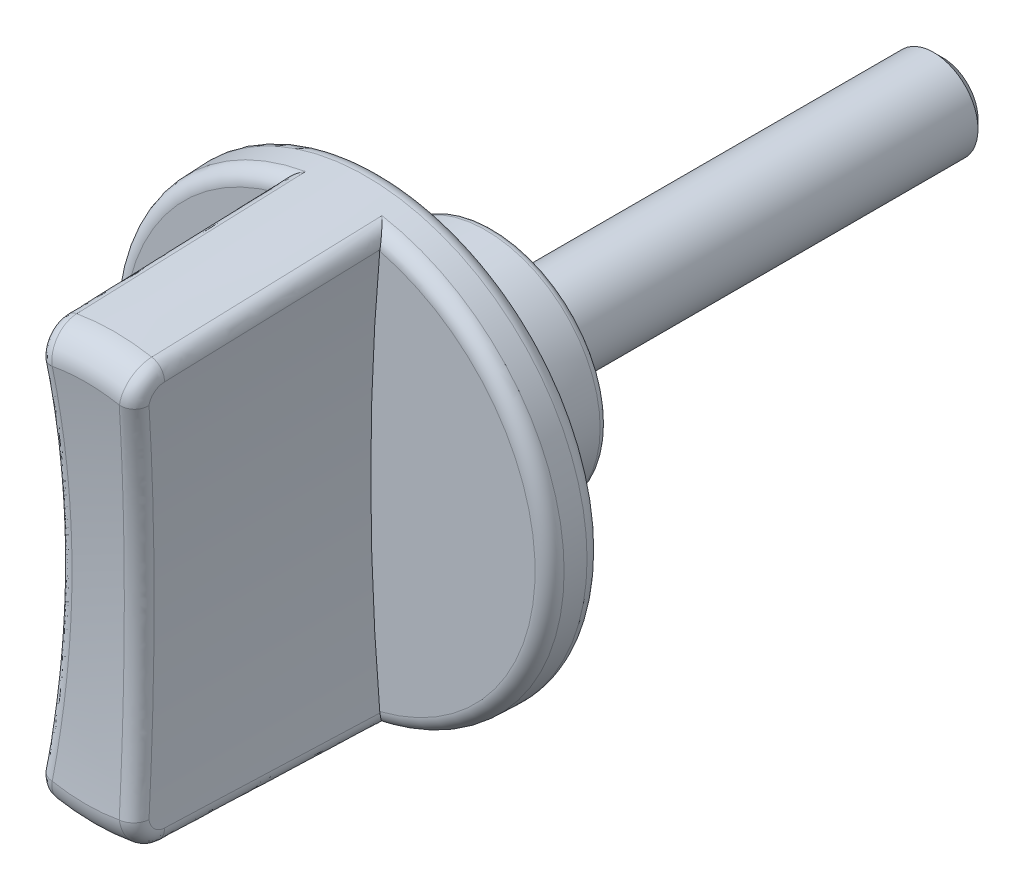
ISO-10303-21;
HEADER;
FILE_DESCRIPTION(('STEP AP214'),'2;1');
FILE_NAME('part.step','',(''),(''),'','','');
FILE_SCHEMA(('AUTOMOTIVE_DESIGN { 1 0 10303 214 1 1 1 1 }'));
ENDSEC;
DATA;
#1=APPLICATION_CONTEXT('core data for automotive mechanical design processes');
#2=APPLICATION_PROTOCOL_DEFINITION('international standard','automotive_design',2000,#1);
#3=PRODUCT_CONTEXT('',#1,'mechanical');
#4=PRODUCT('Part','Part','',(#3));
#5=PRODUCT_RELATED_PRODUCT_CATEGORY('part','',(#4));
#6=PRODUCT_DEFINITION_FORMATION('','',#4);
#7=PRODUCT_DEFINITION_CONTEXT('part definition',#1,'design');
#8=PRODUCT_DEFINITION('design','',#6,#7);
#9=PRODUCT_DEFINITION_SHAPE('','',#8);
#10=(LENGTH_UNIT() NAMED_UNIT(*) SI_UNIT(.MILLI.,.METRE.));
#11=(NAMED_UNIT(*) PLANE_ANGLE_UNIT() SI_UNIT($,.RADIAN.));
#12=(NAMED_UNIT(*) SI_UNIT($,.STERADIAN.) SOLID_ANGLE_UNIT());
#13=UNCERTAINTY_MEASURE_WITH_UNIT(LENGTH_MEASURE(1.E-05),#10,'distance_accuracy_value','');
#14=(GEOMETRIC_REPRESENTATION_CONTEXT(3) GLOBAL_UNCERTAINTY_ASSIGNED_CONTEXT((#13)) GLOBAL_UNIT_ASSIGNED_CONTEXT((#10,
#11,#12)) REPRESENTATION_CONTEXT('',''));
#15=CARTESIAN_POINT('',(0.,0.,0.));
#16=DIRECTION('',(0.,0.,1.));
#17=DIRECTION('',(1.,0.,0.));
#18=AXIS2_PLACEMENT_3D('',#15,#16,#17);
#19=CARTESIAN_POINT('',(0.,0.,9.0348994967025));
#20=DIRECTION('',(0.,0.,-1.));
#21=DIRECTION('',(-1.,0.,0.));
#22=AXIS2_PLACEMENT_3D('',#19,#20,#21);
#23=CONICAL_SURFACE('',#22,14.9638605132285,0.0349065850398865);
#24=CARTESIAN_POINT('',(0.,0.,26.069798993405));
#25=DIRECTION('',(0.,0.,1.));
#26=DIRECTION('',(1.,0.,0.));
#27=AXIS2_PLACEMENT_3D('',#24,#25,#26);
#28=CIRCLE('',#27,14.3689887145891);
#29=CARTESIAN_POINT('',(-2.54030019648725,-14.1426557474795,26.069798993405));
#30=VERTEX_POINT('',#29);
#31=CARTESIAN_POINT('',(2.54030019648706,-14.1426557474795,26.069798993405));
#32=VERTEX_POINT('',#31);
#33=EDGE_CURVE('E164',#30,#32,#28,.T.);
#34=ORIENTED_EDGE('',*,*,#33,.F.);
#35=CARTESIAN_POINT('',(-3.28407586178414,-12.1751022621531,51.8564925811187));
#36=CARTESIAN_POINT('',(-3.3572269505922,-13.0733664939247,51.8881330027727));
#37=CARTESIAN_POINT('',(-2.47072494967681,-13.2386977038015,51.8913920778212));
#38=CARTESIAN_POINT('',(-3.29625817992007,-12.3246956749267,47.5528971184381));
#39=CARTESIAN_POINT('',(-3.37048679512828,-13.2250692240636,47.5802777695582));
#40=CARTESIAN_POINT('',(-2.481761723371,-13.3895173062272,47.5877966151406));
#41=CARTESIAN_POINT('',(-3.30866076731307,-12.4742191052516,43.2492998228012));
#42=CARTESIAN_POINT('',(-3.38395481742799,-13.3764900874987,43.276927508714));
#43=CARTESIAN_POINT('',(-2.49308181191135,-13.5402526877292,43.2841993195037));
#44=CARTESIAN_POINT('',(-3.33390648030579,-12.773135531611,34.6421019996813));
#45=CARTESIAN_POINT('',(-3.4113347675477,-13.6791188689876,34.6698226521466));
#46=CARTESIAN_POINT('',(-2.51627732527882,-13.8415677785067,34.6770014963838));
#47=CARTESIAN_POINT('',(-3.34674960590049,-12.922528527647,30.3385014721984));
#48=CARTESIAN_POINT('',(-3.42524621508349,-13.8303115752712,30.3664881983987));
#49=CARTESIAN_POINT('',(-2.52815275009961,-13.992147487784,30.3734009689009));
#50=CARTESIAN_POINT('',(-3.37287639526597,-13.2211936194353,21.7312975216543));
#51=CARTESIAN_POINT('',(-3.45351306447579,-14.132503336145,21.7593974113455));
#52=CARTESIAN_POINT('',(-2.55244764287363,-14.2931640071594,21.7661970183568));
#53=CARTESIAN_POINT('',(-3.3861600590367,-13.3704657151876,17.4276940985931));
#54=CARTESIAN_POINT('',(-3.46786803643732,-14.2834886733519,17.4560208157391));
#55=CARTESIAN_POINT('',(-2.56486711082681,-14.4436008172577,17.4625935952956));
#56=CARTESIAN_POINT('',(-3.41316792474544,-13.66889656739,8.8204846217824));
#57=CARTESIAN_POINT('',(-3.49702180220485,-14.5852775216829,8.84893399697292));
#58=CARTESIAN_POINT('',(-2.59024087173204,-14.7443416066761,8.8553841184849));
#59=CARTESIAN_POINT('',(-3.42689212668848,-13.8180553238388,4.51687856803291));
#60=CARTESIAN_POINT('',(-3.51182020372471,-14.7360685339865,4.54557049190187));
#61=CARTESIAN_POINT('',(-2.6031951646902,-14.8946455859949,4.55177806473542));
#62=CARTESIAN_POINT('',(-3.44083659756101,-13.9671611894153,0.213271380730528));
#63=CARTESIAN_POINT('',(-3.5268279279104,-14.886650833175,0.24562150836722));
#64=CARTESIAN_POINT('',(-2.61641226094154,-15.0448881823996,0.248170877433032));
#65=(BOUNDED_SURFACE() B_SPLINE_SURFACE(3,2,((#35,#36,#37),(#38,#39,#40),(#41,#42,#43),(#44,#45,
#46),(#47,#48,#49),(#50,#51,#52),(#53,#54,#55),(#56,#57,#58),(#59,#60,#61),(#62,#63,#64)),
.UNSPECIFIED.,.F.,.F.,.F.) B_SPLINE_SURFACE_WITH_KNOTS((4,2,2,2,4),(3,3),(0.,12.9187405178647,
25.8374808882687,38.7562212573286,51.6749617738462),(0.,1.),
.UNSPECIFIED.) GEOMETRIC_REPRESENTATION_ITEM() RATIONAL_B_SPLINE_SURFACE(((1.,0.742631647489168,
1.),(1.,0.741878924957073,1.),(1.,0.74114605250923,1.),(1.,0.739716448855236,1.),(1.,
0.739019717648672,1.),(1.,0.737658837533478,1.),(1.,0.736994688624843,1.),(1.,0.735696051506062,
1.),(1.,0.735061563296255,1.),(1.,0.73444044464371,1.))) REPRESENTATION_ITEM('') SURFACE());
#66=CARTESIAN_POINT('',(-2.47072494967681,-13.2386977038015,51.8913920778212));
#67=CARTESIAN_POINT('',(-2.481761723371,-13.3895173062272,47.5877966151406));
#68=CARTESIAN_POINT('',(-2.49308181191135,-13.5402526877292,43.2841993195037));
#69=CARTESIAN_POINT('',(-2.51627732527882,-13.8415677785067,34.6770014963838));
#70=CARTESIAN_POINT('',(-2.52815275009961,-13.992147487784,30.3734009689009));
#71=CARTESIAN_POINT('',(-2.55244764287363,-14.2931640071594,21.7661970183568));
#72=CARTESIAN_POINT('',(-2.56486711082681,-14.4436008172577,17.4625935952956));
#73=CARTESIAN_POINT('',(-2.59024087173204,-14.7443416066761,8.8553841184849));
#74=CARTESIAN_POINT('',(-2.6031951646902,-14.8946455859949,4.5517780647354));
#75=CARTESIAN_POINT('',(-2.61641226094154,-15.0448881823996,0.248170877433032));
#76=B_SPLINE_CURVE_WITH_KNOTS('',3,(#66,#67,#68,#69,#70,#71,#72,#73,#74,#75),.UNSPECIFIED.,.F.,
.F.,(4,2,2,2,4),(0.,12.9187405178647,25.8374808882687,38.7562212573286,51.6749617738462),.UNSPECIFIED.);
#77=CARTESIAN_POINT('',(-2.58532278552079,-14.6856502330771,10.5348994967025));
#78=VERTEX_POINT('',#77);
#79=EDGE_CURVE('E454',#30,#78,#76,.T.);
#80=ORIENTED_EDGE('',*,*,#79,.T.);
#81=CARTESIAN_POINT('',(0.,0.,10.5348994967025));
#82=DIRECTION('',(0.,0.,-1.));
#83=DIRECTION('',(-1.,0.,0.));
#84=AXIS2_PLACEMENT_3D('',#81,#82,#83);
#85=CIRCLE('',#84,14.9114793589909);
#86=CARTESIAN_POINT('',(-2.58532278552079,14.6856502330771,10.5348994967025));
#87=VERTEX_POINT('',#86);
#88=EDGE_CURVE('E460',#78,#87,#85,.T.);
#89=ORIENTED_EDGE('',*,*,#88,.T.);
#90=CARTESIAN_POINT('',(-2.47072494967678,13.2386977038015,51.8913920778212));
#91=CARTESIAN_POINT('',(-3.35722695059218,13.0733664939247,51.8881330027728));
#92=CARTESIAN_POINT('',(-3.28407586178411,12.1751022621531,51.8564925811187));
#93=CARTESIAN_POINT('',(-2.48176172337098,13.3895173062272,47.5877966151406));
#94=CARTESIAN_POINT('',(-3.37048679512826,13.2250692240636,47.5802777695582));
#95=CARTESIAN_POINT('',(-3.29625817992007,12.3246956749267,47.5528971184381));
#96=CARTESIAN_POINT('',(-2.49308181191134,13.5402526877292,43.2841993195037));
#97=CARTESIAN_POINT('',(-3.38395481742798,13.3764900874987,43.276927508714));
#98=CARTESIAN_POINT('',(-3.30866076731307,12.4742191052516,43.2492998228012));
#99=CARTESIAN_POINT('',(-2.51627732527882,13.8415677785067,34.6770014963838));
#100=CARTESIAN_POINT('',(-3.4113347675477,13.6791188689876,34.6698226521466));
#101=CARTESIAN_POINT('',(-3.33390648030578,12.773135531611,34.6421019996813));
#102=CARTESIAN_POINT('',(-2.5281527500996,13.992147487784,30.3734009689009));
#103=CARTESIAN_POINT('',(-3.42524621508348,13.8303115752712,30.3664881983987));
#104=CARTESIAN_POINT('',(-3.34674960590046,12.922528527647,30.3385014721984));
#105=CARTESIAN_POINT('',(-2.55244764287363,14.2931640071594,21.7661970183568));
#106=CARTESIAN_POINT('',(-3.45351306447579,14.132503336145,21.7593974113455));
#107=CARTESIAN_POINT('',(-3.37287639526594,13.2211936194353,21.7312975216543));
#108=CARTESIAN_POINT('',(-2.56486711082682,14.4436008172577,17.4625935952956));
#109=CARTESIAN_POINT('',(-3.46786803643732,14.2834886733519,17.4560208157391));
#110=CARTESIAN_POINT('',(-3.38616005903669,13.3704657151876,17.4276940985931));
#111=CARTESIAN_POINT('',(-2.59024087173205,14.7443416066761,8.8553841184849));
#112=CARTESIAN_POINT('',(-3.49702180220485,14.5852775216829,8.84893399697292));
#113=CARTESIAN_POINT('',(-3.41316792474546,13.66889656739,8.8204846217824));
#114=CARTESIAN_POINT('',(-2.6031951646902,14.8946455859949,4.55177806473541));
#115=CARTESIAN_POINT('',(-3.51182020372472,14.7360685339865,4.54557049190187));
#116=CARTESIAN_POINT('',(-3.4268921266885,13.8180553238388,4.51687856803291));
#117=CARTESIAN_POINT('',(-2.61641226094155,15.0448881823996,0.248170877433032));
#118=CARTESIAN_POINT('',(-3.52682792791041,14.886650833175,0.24562150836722));
#119=CARTESIAN_POINT('',(-3.44083659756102,13.9671611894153,0.213271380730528));
#120=(BOUNDED_SURFACE() B_SPLINE_SURFACE(3,2,((#90,#91,#92),(#93,#94,#95),(#96,#97,#98),(#99,
#100,#101),(#102,#103,#104),(#105,#106,#107),(#108,#109,#110),(#111,#112,#113),(#114,#115,#116),
(#117,#118,#119)),.UNSPECIFIED.,.F.,.F.,.F.) B_SPLINE_SURFACE_WITH_KNOTS((4,2,2,2,4),(3,3),(0.,
12.9187405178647,25.8374808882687,38.7562212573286,51.6749617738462),(0.,1.),
.UNSPECIFIED.) GEOMETRIC_REPRESENTATION_ITEM() RATIONAL_B_SPLINE_SURFACE(((1.,0.742631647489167,
1.),(1.,0.741878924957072,1.),(1.,0.741146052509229,1.),(1.,0.739716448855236,1.),(1.,
0.739019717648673,1.),(1.,0.737658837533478,1.),(1.,0.736994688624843,1.),(1.,0.735696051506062,
1.),(1.,0.735061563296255,1.),(1.,0.73444044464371,1.))) REPRESENTATION_ITEM('') SURFACE());
#121=CARTESIAN_POINT('',(-2.61641226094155,15.0448881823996,0.248170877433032));
#122=CARTESIAN_POINT('',(-2.6031951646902,14.8946455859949,4.5517780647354));
#123=CARTESIAN_POINT('',(-2.59024087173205,14.7443416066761,8.8553841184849));
#124=CARTESIAN_POINT('',(-2.56486711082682,14.4436008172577,17.4625935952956));
#125=CARTESIAN_POINT('',(-2.55244764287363,14.2931640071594,21.7661970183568));
#126=CARTESIAN_POINT('',(-2.5281527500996,13.992147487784,30.3734009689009));
#127=CARTESIAN_POINT('',(-2.51627732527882,13.8415677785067,34.6770014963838));
#128=CARTESIAN_POINT('',(-2.49308181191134,13.5402526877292,43.2841993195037));
#129=CARTESIAN_POINT('',(-2.48176172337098,13.3895173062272,47.5877966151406));
#130=CARTESIAN_POINT('',(-2.47072494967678,13.2386977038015,51.8913920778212));
#131=B_SPLINE_CURVE_WITH_KNOTS('',3,(#121,#122,#123,#124,#125,#126,#127,#128,#129,#130),
.UNSPECIFIED.,.F.,.F.,(4,2,2,2,4),(0.,12.9187405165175,25.8374808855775,38.7562212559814,
51.6749617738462),.UNSPECIFIED.);
#132=CARTESIAN_POINT('',(-2.54030019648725,14.1426557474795,26.069798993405));
#133=VERTEX_POINT('',#132);
#134=EDGE_CURVE('E145',#87,#133,#131,.T.);
#135=ORIENTED_EDGE('',*,*,#134,.T.);
#136=CARTESIAN_POINT('',(2.54030019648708,14.1426557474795,26.069798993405));
#137=VERTEX_POINT('',#136);
#138=EDGE_CURVE('E152',#137,#133,#28,.T.);
#139=ORIENTED_EDGE('',*,*,#138,.F.);
#140=CARTESIAN_POINT('',(3.28407586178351,12.1751022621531,51.8564925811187));
#141=CARTESIAN_POINT('',(3.35722695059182,13.0733664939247,51.8881330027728));
#142=CARTESIAN_POINT('',(2.47072494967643,13.2386977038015,51.8913920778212));
#143=CARTESIAN_POINT('',(3.2962581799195,12.3246956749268,47.5528971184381));
#144=CARTESIAN_POINT('',(3.37048679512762,13.2250692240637,47.5802777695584));
#145=CARTESIAN_POINT('',(2.48176172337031,13.3895173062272,47.5877966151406));
#146=CARTESIAN_POINT('',(3.30866076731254,12.4742191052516,43.2492998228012));
#147=CARTESIAN_POINT('',(3.38395481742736,13.3764900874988,43.2769275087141));
#148=CARTESIAN_POINT('',(2.49308181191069,13.5402526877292,43.2841993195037));
#149=CARTESIAN_POINT('',(3.33390648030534,12.773135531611,34.6421019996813));
#150=CARTESIAN_POINT('',(3.4113347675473,13.6791188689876,34.6698226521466));
#151=CARTESIAN_POINT('',(2.5162773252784,13.8415677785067,34.6770014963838));
#152=CARTESIAN_POINT('',(3.34674960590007,12.922528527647,30.3385014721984));
#153=CARTESIAN_POINT('',(3.42524621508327,13.8303115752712,30.3664881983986));
#154=CARTESIAN_POINT('',(2.52815275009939,13.992147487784,30.3734009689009));
#155=CARTESIAN_POINT('',(3.3728763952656,13.2211936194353,21.7312975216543));
#156=CARTESIAN_POINT('',(3.45351306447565,14.132503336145,21.7593974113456));
#157=CARTESIAN_POINT('',(2.55244764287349,14.2931640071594,21.7661970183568));
#158=CARTESIAN_POINT('',(3.38616005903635,13.3704657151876,17.4276940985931));
#159=CARTESIAN_POINT('',(3.46786803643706,14.2834886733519,17.4560208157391));
#160=CARTESIAN_POINT('',(2.56486711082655,14.4436008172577,17.4625935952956));
#161=CARTESIAN_POINT('',(3.41316792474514,13.66889656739,8.82048462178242));
#162=CARTESIAN_POINT('',(3.4970218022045,14.585277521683,8.84893399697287));
#163=CARTESIAN_POINT('',(2.59024087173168,14.7443416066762,8.85538411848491));
#164=CARTESIAN_POINT('',(3.4268921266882,13.8180553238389,4.51687856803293));
#165=CARTESIAN_POINT('',(3.5118202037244,14.7360685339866,4.54557049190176));
#166=CARTESIAN_POINT('',(2.60319516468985,14.8946455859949,4.55177806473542));
#167=CARTESIAN_POINT('',(3.44083659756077,13.9671611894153,0.213271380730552));
#168=CARTESIAN_POINT('',(3.52682792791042,14.886650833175,0.245621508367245));
#169=CARTESIAN_POINT('',(2.61641226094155,15.0448881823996,0.24817087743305));
#170=(BOUNDED_SURFACE() B_SPLINE_SURFACE(3,2,((#140,#141,#142),(#143,#144,#145),(#146,#147,
#148),(#149,#150,#151),(#152,#153,#154),(#155,#156,#157),(#158,#159,#160),(#161,#162,#163),
(#164,#165,#166),(#167,#168,#169)),.UNSPECIFIED.,.F.,.F.,.F.) B_SPLINE_SURFACE_WITH_KNOTS((4,2,
2,2,4),(3,3),(0.,12.9187405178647,25.8374808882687,38.7562212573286,51.6749617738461),(0.,1.),
.UNSPECIFIED.) GEOMETRIC_REPRESENTATION_ITEM() RATIONAL_B_SPLINE_SURFACE(((1.,0.742631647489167,
1.),(1.,0.741878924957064,1.),(1.,0.741146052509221,1.),(1.,0.739716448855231,1.),(1.,
0.739019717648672,1.),(1.,0.737658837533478,1.),(1.,0.73699468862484,1.),(1.,0.735696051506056,
1.),(1.,0.735061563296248,1.),(1.,0.73444044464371,1.))) REPRESENTATION_ITEM('') SURFACE());
#171=CARTESIAN_POINT('',(2.47072494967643,13.2386977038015,51.8913920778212));
#172=CARTESIAN_POINT('',(2.48176172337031,13.3895173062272,47.5877966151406));
#173=CARTESIAN_POINT('',(2.49308181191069,13.5402526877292,43.2841993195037));
#174=CARTESIAN_POINT('',(2.5162773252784,13.8415677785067,34.6770014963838));
#175=CARTESIAN_POINT('',(2.52815275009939,13.992147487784,30.3734009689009));
#176=CARTESIAN_POINT('',(2.55244764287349,14.2931640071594,21.7661970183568));
#177=CARTESIAN_POINT('',(2.56486711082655,14.4436008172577,17.4625935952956));
#178=CARTESIAN_POINT('',(2.59024087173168,14.7443416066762,8.8553841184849));
#179=CARTESIAN_POINT('',(2.60319516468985,14.8946455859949,4.55177806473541));
#180=CARTESIAN_POINT('',(2.61641226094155,15.0448881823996,0.24817087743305));
#181=B_SPLINE_CURVE_WITH_KNOTS('',3,(#171,#172,#173,#174,#175,#176,#177,#178,#179,#180),
.UNSPECIFIED.,.F.,.F.,(4,2,2,2,4),(0.,12.9187405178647,25.8374808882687,38.7562212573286,
51.6749617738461),.UNSPECIFIED.);
#182=CARTESIAN_POINT('',(2.58532278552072,14.6856502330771,10.5348994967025));
#183=VERTEX_POINT('',#182);
#184=EDGE_CURVE('E138',#137,#183,#181,.T.);
#185=ORIENTED_EDGE('',*,*,#184,.T.);
#186=CARTESIAN_POINT('',(0.,0.,10.5348994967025));
#187=DIRECTION('',(0.,0.,-1.));
#188=DIRECTION('',(-1.,0.,0.));
#189=AXIS2_PLACEMENT_3D('',#186,#187,#188);
#190=CIRCLE('',#189,14.9114793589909);
#191=CARTESIAN_POINT('',(2.58532278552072,-14.6856502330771,10.5348994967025));
#192=VERTEX_POINT('',#191);
#193=EDGE_CURVE('E146',#183,#192,#190,.T.);
#194=ORIENTED_EDGE('',*,*,#193,.T.);
#195=CARTESIAN_POINT('',(2.47072494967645,-13.2386977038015,51.8913920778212));
#196=CARTESIAN_POINT('',(3.35722695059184,-13.0733664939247,51.8881330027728));
#197=CARTESIAN_POINT('',(3.28407586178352,-12.1751022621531,51.8564925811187));
#198=CARTESIAN_POINT('',(2.48176172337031,-13.3895173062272,47.5877966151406));
#199=CARTESIAN_POINT('',(3.37048679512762,-13.2250692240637,47.5802777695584));
#200=CARTESIAN_POINT('',(3.29625817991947,-12.3246956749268,47.5528971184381));
#201=CARTESIAN_POINT('',(2.49308181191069,-13.5402526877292,43.2841993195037));
#202=CARTESIAN_POINT('',(3.38395481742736,-13.3764900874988,43.2769275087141));
#203=CARTESIAN_POINT('',(3.30866076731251,-12.4742191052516,43.2492998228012));
#204=CARTESIAN_POINT('',(2.5162773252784,-13.8415677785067,34.6770014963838));
#205=CARTESIAN_POINT('',(3.41133476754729,-13.6791188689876,34.6698226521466));
#206=CARTESIAN_POINT('',(3.33390648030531,-12.773135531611,34.6421019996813));
#207=CARTESIAN_POINT('',(2.52815275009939,-13.992147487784,30.3734009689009));
#208=CARTESIAN_POINT('',(3.42524621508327,-13.8303115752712,30.3664881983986));
#209=CARTESIAN_POINT('',(3.34674960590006,-12.922528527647,30.3385014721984));
#210=CARTESIAN_POINT('',(2.55244764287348,-14.2931640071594,21.7661970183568));
#211=CARTESIAN_POINT('',(3.45351306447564,-14.132503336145,21.7593974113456));
#212=CARTESIAN_POINT('',(3.37287639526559,-13.2211936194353,21.7312975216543));
#213=CARTESIAN_POINT('',(2.56486711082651,-14.4436008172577,17.4625935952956));
#214=CARTESIAN_POINT('',(3.46786803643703,-14.2834886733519,17.4560208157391));
#215=CARTESIAN_POINT('',(3.38616005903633,-13.3704657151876,17.4276940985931));
#216=CARTESIAN_POINT('',(2.59024087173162,-14.7443416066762,8.85538411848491));
#217=CARTESIAN_POINT('',(3.49702180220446,-14.585277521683,8.84893399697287));
#218=CARTESIAN_POINT('',(3.41316792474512,-13.6688965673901,8.82048462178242));
#219=CARTESIAN_POINT('',(2.60319516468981,-14.8946455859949,4.55177806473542));
#220=CARTESIAN_POINT('',(3.51182020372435,-14.7360685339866,4.54557049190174));
#221=CARTESIAN_POINT('',(3.4268921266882,-13.8180553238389,4.51687856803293));
#222=CARTESIAN_POINT('',(2.61641226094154,-15.0448881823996,0.24817087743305));
#223=CARTESIAN_POINT('',(3.5268279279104,-14.886650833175,0.245621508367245));
#224=CARTESIAN_POINT('',(3.44083659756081,-13.9671611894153,0.213271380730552));
#225=(BOUNDED_SURFACE() B_SPLINE_SURFACE(3,2,((#195,#196,#197),(#198,#199,#200),(#201,#202,
#203),(#204,#205,#206),(#207,#208,#209),(#210,#211,#212),(#213,#214,#215),(#216,#217,#218),
(#219,#220,#221),(#222,#223,#224)),.UNSPECIFIED.,.F.,.F.,.F.) B_SPLINE_SURFACE_WITH_KNOTS((4,2,
2,2,4),(3,3),(0.,12.9187405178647,25.8374808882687,38.7562212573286,51.6749617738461),(0.,1.),
.UNSPECIFIED.) GEOMETRIC_REPRESENTATION_ITEM() RATIONAL_B_SPLINE_SURFACE(((1.,0.742631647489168,
1.),(1.,0.741878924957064,1.),(1.,0.74114605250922,1.),(1.,0.739716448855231,1.),(1.,
0.739019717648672,1.),(1.,0.737658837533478,1.),(1.,0.736994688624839,1.),(1.,0.735696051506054,
1.),(1.,0.735061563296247,1.),(1.,0.73444044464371,1.))) REPRESENTATION_ITEM('') SURFACE());
#226=CARTESIAN_POINT('',(2.61641226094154,-15.0448881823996,0.24817087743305));
#227=CARTESIAN_POINT('',(2.60319516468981,-14.8946455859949,4.55177806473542));
#228=CARTESIAN_POINT('',(2.59024087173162,-14.7443416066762,8.85538411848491));
#229=CARTESIAN_POINT('',(2.56486711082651,-14.4436008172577,17.4625935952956));
#230=CARTESIAN_POINT('',(2.55244764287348,-14.2931640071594,21.7661970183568));
#231=CARTESIAN_POINT('',(2.52815275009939,-13.992147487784,30.3734009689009));
#232=CARTESIAN_POINT('',(2.5162773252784,-13.8415677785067,34.6770014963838));
#233=CARTESIAN_POINT('',(2.49308181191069,-13.5402526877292,43.2841993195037));
#234=CARTESIAN_POINT('',(2.48176172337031,-13.3895173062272,47.5877966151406));
#235=CARTESIAN_POINT('',(2.47072494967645,-13.2386977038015,51.8913920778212));
#236=B_SPLINE_CURVE_WITH_KNOTS('',3,(#226,#227,#228,#229,#230,#231,#232,#233,#234,#235),
.UNSPECIFIED.,.F.,.F.,(4,2,2,2,4),(0.,12.9187405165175,25.8374808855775,38.7562212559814,
51.6749617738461),.UNSPECIFIED.);
#237=EDGE_CURVE('E478',#192,#32,#236,.T.);
#238=ORIENTED_EDGE('',*,*,#237,.T.);
#239=EDGE_LOOP('',(#34,#80,#89,#135,#139,#185,#194,#238));
#240=FACE_BOUND('',#239,.T.);
#241=CARTESIAN_POINT('',(0.,0.,9.0348994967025));
#242=DIRECTION('',(0.,0.,1.));
#243=DIRECTION('',(1.,0.,0.));
#244=AXIS2_PLACEMENT_3D('',#241,#242,#243);
#245=CIRCLE('',#244,14.9638605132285);
#246=CARTESIAN_POINT('',(14.9638605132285,0.,9.03489949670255));
#247=VERTEX_POINT('',#246);
#248=EDGE_CURVE('E163',#247,#247,#245,.T.);
#249=ORIENTED_EDGE('',*,*,#248,.T.);
#250=EDGE_LOOP('',(#249));
#251=FACE_BOUND('',#250,.T.);
#252=ADVANCED_FACE('F14',(#240,#251),#23,.T.);
#253=CARTESIAN_POINT('',(0.,0.,26.));
#254=DIRECTION('',(0.,0.,1.));
#255=DIRECTION('',(1.,0.,0.));
#256=AXIS2_PLACEMENT_3D('',#253,#254,#255);
#257=TOROIDAL_SURFACE('',#256,12.3702070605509,2.);
#258=CARTESIAN_POINT('',(-5.10022096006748,26.2293832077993,30.1580238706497));
#259=CARTESIAN_POINT('',(-5.04919899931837,25.9420955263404,31.1080364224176));
#260=CARTESIAN_POINT('',(-4.07040142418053,26.1140892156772,31.1139337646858));
#261=CARTESIAN_POINT('',(-4.91107231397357,25.1644836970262,29.8236073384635));
#262=CARTESIAN_POINT('',(-4.86389549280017,24.8867519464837,30.7789353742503));
#263=CARTESIAN_POINT('',(-3.88208420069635,25.0538705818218,30.7831921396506));
#264=CARTESIAN_POINT('',(-4.73239782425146,24.0913982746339,29.509585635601));
#265=CARTESIAN_POINT('',(-4.6891052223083,23.8247402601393,30.4703352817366));
#266=CARTESIAN_POINT('',(-3.70419509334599,23.985502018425,30.4726212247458));
#267=CARTESIAN_POINT('',(-4.39697538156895,21.9307162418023,28.922845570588));
#268=CARTESIAN_POINT('',(-4.36095056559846,21.6864324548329,29.8936616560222));
#269=CARTESIAN_POINT('',(-3.37024703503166,21.8343174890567,29.892328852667));
#270=CARTESIAN_POINT('',(-4.24022820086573,20.8431191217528,28.6501286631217));
#271=CARTESIAN_POINT('',(-4.20766672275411,20.6103663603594,29.6257351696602));
#272=CARTESIAN_POINT('',(-3.21418885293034,20.7515010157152,29.6226088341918));
#273=CARTESIAN_POINT('',(-3.94963897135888,18.6552510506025,28.1465128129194));
#274=CARTESIAN_POINT('',(-3.92346310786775,18.4457423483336,29.1308863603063));
#275=CARTESIAN_POINT('',(-2.92487693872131,18.5732499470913,29.1245272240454));
#276=CARTESIAN_POINT('',(-3.81579898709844,17.5549789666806,27.9156176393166));
#277=CARTESIAN_POINT('',(-3.79261814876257,17.3574384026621,28.9040978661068));
#278=CARTESIAN_POINT('',(-2.79162526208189,17.4778142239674,28.8961693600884));
#279=CARTESIAN_POINT('',(-3.57185939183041,15.3439948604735,27.4961236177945));
#280=CARTESIAN_POINT('',(-3.55410366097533,15.1704760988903,28.4919953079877));
#281=CARTESIAN_POINT('',(-2.54875792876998,15.2765487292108,28.4812851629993));
#282=CARTESIAN_POINT('',(-3.46175936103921,14.2332830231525,27.307524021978));
#283=CARTESIAN_POINT('',(-3.44649739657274,14.0720941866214,28.3067925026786));
#284=CARTESIAN_POINT('',(-2.43914185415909,14.1707191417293,28.2947580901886));
#285=CARTESIAN_POINT('',(-3.17384143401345,10.9534047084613,26.8154875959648));
#286=CARTESIAN_POINT('',(-3.16488899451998,10.8268209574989,27.8232430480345));
#287=CARTESIAN_POINT('',(-2.15248950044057,10.9052578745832,27.808128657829));
#288=CARTESIAN_POINT('',(-3.02984120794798,8.77210691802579,26.5710741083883));
#289=CARTESIAN_POINT('',(-3.02430957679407,8.67116249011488,27.5834882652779));
#290=CARTESIAN_POINT('',(-2.00912224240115,8.73354820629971,27.5664010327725));
#291=CARTESIAN_POINT('',(-2.83750095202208,4.39387142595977,26.2450475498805));
#292=CARTESIAN_POINT('',(-2.83634308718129,4.34250856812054,27.2633382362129));
#293=CARTESIAN_POINT('',(-1.81762743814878,4.3745577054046,27.2439571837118));
#294=CARTESIAN_POINT('',(-2.78914896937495,2.19693571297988,26.1634141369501));
#295=CARTESIAN_POINT('',(-2.78914896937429,2.17185387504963,27.1832722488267));
#296=CARTESIAN_POINT('',(-1.76948799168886,2.1872788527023,27.1632208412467));
#297=CARTESIAN_POINT('',(-2.78914896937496,-2.1969357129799,26.1634141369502));
#298=CARTESIAN_POINT('',(-2.78914896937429,-2.17185387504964,27.1832722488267));
#299=CARTESIAN_POINT('',(-1.76948799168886,-2.18727885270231,27.1632208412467));
#300=CARTESIAN_POINT('',(-2.83750095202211,-4.3938714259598,26.2450475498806));
#301=CARTESIAN_POINT('',(-2.83634308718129,-4.34250856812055,27.2633382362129));
#302=CARTESIAN_POINT('',(-1.81762743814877,-4.37455770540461,27.2439571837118));
#303=CARTESIAN_POINT('',(-3.02984120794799,-8.77210691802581,26.5710741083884));
#304=CARTESIAN_POINT('',(-3.02430957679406,-8.6711624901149,27.583488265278));
#305=CARTESIAN_POINT('',(-2.00912224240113,-8.73354820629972,27.5664010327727));
#306=CARTESIAN_POINT('',(-3.17384143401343,-10.9534047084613,26.8154875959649));
#307=CARTESIAN_POINT('',(-3.16488899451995,-10.8268209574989,27.8232430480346));
#308=CARTESIAN_POINT('',(-2.15248950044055,-10.9052578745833,27.8081286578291));
#309=CARTESIAN_POINT('',(-3.4617593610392,-14.2332830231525,27.3075240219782));
#310=CARTESIAN_POINT('',(-3.44649739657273,-14.0720941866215,28.3067925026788));
#311=CARTESIAN_POINT('',(-2.43914185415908,-14.1707191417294,28.2947580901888));
#312=CARTESIAN_POINT('',(-3.5718593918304,-15.3439948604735,27.4961236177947));
#313=CARTESIAN_POINT('',(-3.55410366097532,-15.1704760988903,28.4919953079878));
#314=CARTESIAN_POINT('',(-2.54875792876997,-15.2765487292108,28.4812851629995));
#315=CARTESIAN_POINT('',(-3.81579898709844,-17.5549789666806,27.9156176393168));
#316=CARTESIAN_POINT('',(-3.79261814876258,-17.3574384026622,28.904097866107));
#317=CARTESIAN_POINT('',(-2.7916252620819,-17.4778142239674,28.8961693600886));
#318=CARTESIAN_POINT('',(-3.94963897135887,-18.6552510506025,28.1465128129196));
#319=CARTESIAN_POINT('',(-3.92346310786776,-18.4457423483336,29.1308863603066));
#320=CARTESIAN_POINT('',(-2.92487693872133,-18.5732499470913,29.1245272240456));
#321=CARTESIAN_POINT('',(-4.24022820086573,-20.8431191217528,28.650128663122));
#322=CARTESIAN_POINT('',(-4.20766672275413,-20.6103663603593,29.6257351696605));
#323=CARTESIAN_POINT('',(-3.21418885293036,-20.7515010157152,29.622608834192));
#324=CARTESIAN_POINT('',(-4.39697538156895,-21.9307162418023,28.9228455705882));
#325=CARTESIAN_POINT('',(-4.36095056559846,-21.6864324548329,29.8936616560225));
#326=CARTESIAN_POINT('',(-3.37024703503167,-21.8343174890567,29.8923288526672));
#327=CARTESIAN_POINT('',(-4.73239782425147,-24.0913982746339,29.5095856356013));
#328=CARTESIAN_POINT('',(-4.6891052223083,-23.8247402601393,30.4703352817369));
#329=CARTESIAN_POINT('',(-3.70419509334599,-23.985502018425,30.4726212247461));
#330=CARTESIAN_POINT('',(-4.91107231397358,-25.1644836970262,29.8236073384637));
#331=CARTESIAN_POINT('',(-4.86389549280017,-24.8867519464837,30.7789353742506));
#332=CARTESIAN_POINT('',(-3.88208420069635,-25.0538705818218,30.7831921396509));
#333=CARTESIAN_POINT('',(-5.10022096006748,-26.2293832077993,30.15802387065));
#334=CARTESIAN_POINT('',(-5.0491989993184,-25.9420955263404,31.1080364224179));
#335=CARTESIAN_POINT('',(-4.07040142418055,-26.1140892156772,31.1139337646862));
#336=(BOUNDED_SURFACE() B_SPLINE_SURFACE(3,2,((#258,#259,#260),(#261,#262,#263),(#264,#265,
#266),(#267,#268,#269),(#270,#271,#272),(#273,#274,#275),(#276,#277,#278),(#279,#280,#281),
(#282,#283,#284),(#285,#286,#287),(#288,#289,#290),(#291,#292,#293),(#294,#295,#296),(#297,#298,
#299),(#300,#301,#302),(#303,#304,#305),(#306,#307,#308),(#309,#310,#311),(#312,#313,#314),
(#315,#316,#317),(#318,#319,#320),(#321,#322,#323),(#324,#325,#326),(#327,#328,#329),(#330,#331,
#332),(#333,#334,#335)),.UNSPECIFIED.,.F.,.F.,.F.) B_SPLINE_SURFACE_WITH_KNOTS((4,2,2,2,2,2,2,2,
2,2,2,2,4),(3,3),(0.,3.41667725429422,6.83347481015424,10.250580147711,13.6676250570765,
20.3013017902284,26.9341494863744,33.5669971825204,40.2006739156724,43.6177188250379,
47.0348241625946,50.4516217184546,53.8682989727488),(0.,1.),
.UNSPECIFIED.) GEOMETRIC_REPRESENTATION_ITEM() RATIONAL_B_SPLINE_SURFACE(((1.,0.709298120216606,
1.),(1.,0.708551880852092,1.),(1.,0.707845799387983,1.),(1.,0.706518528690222,1.),(1.,
0.705897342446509,1.),(1.,0.704744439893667,1.),(1.,0.704212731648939,1.),(1.,0.703242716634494,
1.),(1.,0.702804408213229,1.),(1.,0.701657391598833,1.),(1.,0.701082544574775,1.),(1.,
0.700314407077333,1.),(1.,0.700121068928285,1.),(1.,0.700121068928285,1.),(1.,0.700314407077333,
1.),(1.,0.701082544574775,1.),(1.,0.701657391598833,1.),(1.,0.702804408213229,1.),(1.,
0.703242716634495,1.),(1.,0.70421273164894,1.),(1.,0.704744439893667,1.),(1.,0.70589734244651,
1.),(1.,0.706518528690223,1.),(1.,0.707845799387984,1.),(1.,0.708551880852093,1.),(1.,
0.709298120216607,1.))) REPRESENTATION_ITEM('') SURFACE());
#337=CARTESIAN_POINT('',(-2.26545380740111,-12.1609926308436,28.));
#338=CARTESIAN_POINT('',(-2.26777941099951,-12.1605218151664,28.0000000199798));
#339=CARTESIAN_POINT('',(-2.27011553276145,-12.1601298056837,28.0000000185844));
#340=CARTESIAN_POINT('',(-2.27480882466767,-12.1595033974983,27.9999999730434));
#341=CARTESIAN_POINT('',(-2.27716599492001,-12.1592689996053,27.9999999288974));
#342=CARTESIAN_POINT('',(-2.27953368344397,-12.1591134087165,27.9999998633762));
#343=B_SPLINE_CURVE_WITH_KNOTS('',3,(#337,#338,#339,#340,#341,#342),.UNSPECIFIED.,.F.,.F.,(4,2,
4),(0.,0.00710635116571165,0.01421273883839),.UNSPECIFIED.);
#344=CARTESIAN_POINT('',(-2.26545380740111,-12.1609926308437,28.));
#345=VERTEX_POINT('',#344);
#346=CARTESIAN_POINT('',(-2.27953368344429,-12.1591134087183,27.9999998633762));
#347=VERTEX_POINT('',#346);
#348=EDGE_CURVE('E436',#345,#347,#343,.T.);
#349=ORIENTED_EDGE('',*,*,#348,.T.);
#350=CARTESIAN_POINT('',(-2.53653713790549,-14.1136545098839,25.6524571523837));
#351=CARTESIAN_POINT('',(-3.43692781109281,-13.9543847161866,25.6666827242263));
#352=CARTESIAN_POINT('',(-3.35854418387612,-13.0573486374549,25.8262285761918));
#353=CARTESIAN_POINT('',(-2.53810104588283,-14.1257062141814,25.7212084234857));
#354=CARTESIAN_POINT('',(-3.43794104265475,-13.965558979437,25.7326743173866));
#355=CARTESIAN_POINT('',(-3.35907128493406,-13.0633794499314,25.8606042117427));
#356=CARTESIAN_POINT('',(-2.53919855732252,-14.1341647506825,25.7905710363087));
#357=CARTESIAN_POINT('',(-3.4386524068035,-13.9733995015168,25.7992134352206));
#358=CARTESIAN_POINT('',(-3.35944138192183,-13.0676121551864,25.8952855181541));
#359=CARTESIAN_POINT('',(-2.54045624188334,-14.1438582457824,25.9299207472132));
#360=CARTESIAN_POINT('',(-3.43946762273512,-13.9823822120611,25.932823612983));
#361=CARTESIAN_POINT('',(-3.35986559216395,-13.0724628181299,25.9649603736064));
#362=CARTESIAN_POINT('',(-2.54061493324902,-14.1450817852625,25.9999086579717));
#363=CARTESIAN_POINT('',(-3.43957072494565,-13.9835161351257,25.9999125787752));
#364=CARTESIAN_POINT('',(-3.3599192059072,-13.0730750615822,25.9999543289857));
#365=CARTESIAN_POINT('',(-2.53979595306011,-14.138768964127,26.1817711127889));
#366=CARTESIAN_POINT('',(-3.4390395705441,-13.977666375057,26.1742564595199));
#367=CARTESIAN_POINT('',(-3.35964284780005,-13.0699161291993,26.0908855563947));
#368=CARTESIAN_POINT('',(-2.53807653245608,-14.1255145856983,26.2934927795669));
#369=CARTESIAN_POINT('',(-3.43792355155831,-13.9653793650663,26.2814240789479));
#370=CARTESIAN_POINT('',(-3.3590624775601,-13.0632836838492,26.1467463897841));
#371=CARTESIAN_POINT('',(-2.53225104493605,-14.0806305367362,26.5131195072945));
#372=CARTESIAN_POINT('',(-3.43415179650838,-13.9237441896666,26.4923972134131));
#373=CARTESIAN_POINT('',(-3.3571006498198,-13.0408228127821,26.2565597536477));
#374=CARTESIAN_POINT('',(-2.52814354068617,-14.0489897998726,26.6210222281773));
#375=CARTESIAN_POINT('',(-3.43149263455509,-13.8943581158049,26.5962682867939));
#376=CARTESIAN_POINT('',(-3.35571870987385,-13.0249888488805,26.3105111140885));
#377=CARTESIAN_POINT('',(-2.51765575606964,-13.9682663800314,26.8298883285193));
#378=CARTESIAN_POINT('',(-3.42472668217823,-13.8192784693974,26.7979353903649));
#379=CARTESIAN_POINT('',(-3.352202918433,-12.9845894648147,26.4149441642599));
#380=CARTESIAN_POINT('',(-2.51127646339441,-13.9191912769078,26.9308547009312));
#381=CARTESIAN_POINT('',(-3.42061611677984,-13.7735427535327,26.895792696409));
#382=CARTESIAN_POINT('',(-3.35006939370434,-12.9600278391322,26.4654273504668));
#383=CARTESIAN_POINT('',(-2.49641729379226,-13.8050114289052,27.1230473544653));
#384=CARTESIAN_POINT('',(-3.41108321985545,-13.6668880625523,27.0829795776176));
#385=CARTESIAN_POINT('',(-3.34512397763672,-12.9028761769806,26.5615236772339));
#386=CARTESIAN_POINT('',(-2.4879372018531,-13.7399050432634,27.2142726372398));
#387=CARTESIAN_POINT('',(-3.40565474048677,-13.6058991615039,27.1723525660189));
#388=CARTESIAN_POINT('',(-3.34231201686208,-12.8702853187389,26.6071363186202));
#389=CARTESIAN_POINT('',(-2.46908943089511,-13.5954148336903,27.3845687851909));
#390=CARTESIAN_POINT('',(-3.39365068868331,-13.4701119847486,27.3404193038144));
#391=CARTESIAN_POINT('',(-3.33609996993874,-12.7979475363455,26.6922843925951));
#392=CARTESIAN_POINT('',(-2.4587185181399,-13.5160065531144,27.4636183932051));
#393=CARTESIAN_POINT('',(-3.38706594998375,-13.395206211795,27.4191191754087));
#394=CARTESIAN_POINT('',(-3.33269887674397,-12.7581883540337,26.7318091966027));
#395=CARTESIAN_POINT('',(-2.43637743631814,-13.3452616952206,27.6071770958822));
#396=CARTESIAN_POINT('',(-3.37296064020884,-13.2334658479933,27.5636105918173));
#397=CARTESIAN_POINT('',(-3.32542461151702,-12.6726847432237,26.8035885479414));
#398=CARTESIAN_POINT('',(-2.42440716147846,-13.2539243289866,27.671685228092));
#399=CARTESIAN_POINT('',(-3.3654321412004,-13.146536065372,27.6294028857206));
#400=CARTESIAN_POINT('',(-3.32155140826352,-12.6269399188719,26.835842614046));
#401=CARTESIAN_POINT('',(-2.39913642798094,-13.0615299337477,27.7846111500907));
#402=CARTESIAN_POINT('',(-3.34963230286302,-12.9624623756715,27.7465483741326));
#403=CARTESIAN_POINT('',(-3.31344101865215,-12.5305657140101,26.8923055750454));
#404=CARTESIAN_POINT('',(-2.38583073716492,-12.9604347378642,27.8329621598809));
#405=CARTESIAN_POINT('',(-3.34135028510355,-12.8651811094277,27.7978151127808));
#406=CARTESIAN_POINT('',(-3.30920241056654,-12.4799171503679,26.9164810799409));
#407=CARTESIAN_POINT('',(-2.35828870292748,-12.7517205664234,27.911885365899));
#408=CARTESIAN_POINT('',(-3.32430943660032,-12.6630601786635,27.8840705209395));
#409=CARTESIAN_POINT('',(-3.30050751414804,-12.3753314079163,26.95594268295));
#410=CARTESIAN_POINT('',(-2.34405238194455,-12.6441017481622,27.942457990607));
#411=CARTESIAN_POINT('',(-3.31554350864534,-12.5581272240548,27.9190056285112));
#412=CARTESIAN_POINT('',(-3.29605123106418,-12.3213943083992,26.9712289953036));
#413=CARTESIAN_POINT('',(-2.31496623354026,-12.4248783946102,27.9850986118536));
#414=CARTESIAN_POINT('',(-3.29773683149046,-12.3427725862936,27.9715668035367));
#415=CARTESIAN_POINT('',(-3.28703416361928,-12.2114994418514,26.9925493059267));
#416=CARTESIAN_POINT('',(-2.30011392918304,-12.3132580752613,27.9970825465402));
#417=CARTESIAN_POINT('',(-3.2886896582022,-12.2322516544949,27.9890314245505));
#418=CARTESIAN_POINT('',(-3.28247299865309,-12.1555336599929,26.9985412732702));
#419=CARTESIAN_POINT('',(-2.27025985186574,-12.0896276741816,28.0019761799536));
#420=CARTESIAN_POINT('',(-3.27060012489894,-12.0089238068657,28.005565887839));
#421=CARTESIAN_POINT('',(-3.27339685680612,-12.0433816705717,27.0009880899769));
#422=CARTESIAN_POINT('',(-2.25525804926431,-11.9776175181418,27.9948820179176));
#423=CARTESIAN_POINT('',(-3.26155455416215,-11.8960629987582,28.004526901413));
#424=CARTESIAN_POINT('',(-3.26888188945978,-11.9871954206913,26.9974410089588));
#425=CARTESIAN_POINT('',(-2.22548303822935,-11.75608355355,27.9617454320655));
#426=CARTESIAN_POINT('',(-3.24368390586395,-11.6707215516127,27.983549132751));
#427=CARTESIAN_POINT('',(-3.26001246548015,-11.8760444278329,26.9808727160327));
#428=CARTESIAN_POINT('',(-2.21071058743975,-11.6465675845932,27.9356500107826));
#429=CARTESIAN_POINT('',(-3.2348593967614,-11.5582263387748,27.9634374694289));
#430=CARTESIAN_POINT('',(-3.25565849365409,-11.821083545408,26.9678250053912));
#431=CARTESIAN_POINT('',(-2.18184746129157,-11.4333419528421,27.8652599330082));
#432=CARTESIAN_POINT('',(-3.21767584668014,-11.3369636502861,27.904295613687));
#433=CARTESIAN_POINT('',(-3.24723521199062,-11.7140515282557,26.9326299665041));
#434=CARTESIAN_POINT('',(-2.16775728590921,-11.3296365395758,27.8209521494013));
#435=CARTESIAN_POINT('',(-3.20932025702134,-11.2282244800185,27.8651311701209));
#436=CARTESIAN_POINT('',(-3.24316610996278,-11.6619825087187,26.9104760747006));
#437=CARTESIAN_POINT('',(-2.15422439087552,-11.2304160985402,27.7679622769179));
#438=CARTESIAN_POINT('',(-3.20134856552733,-11.1234113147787,27.8167118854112));
#439=CARTESIAN_POINT('',(-3.23929810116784,-11.6121533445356,26.8839811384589));
#440=(BOUNDED_SURFACE() B_SPLINE_SURFACE(3,2,((#350,#351,#352),(#353,#354,#355),(#356,#357,
#358),(#359,#360,#361),(#362,#363,#364),(#365,#366,#367),(#368,#369,#370),(#371,#372,#373),
(#374,#375,#376),(#377,#378,#379),(#380,#381,#382),(#383,#384,#385),(#386,#387,#388),(#389,#390,
#391),(#392,#393,#394),(#395,#396,#397),(#398,#399,#400),(#401,#402,#403),(#404,#405,#406),
(#407,#408,#409),(#410,#411,#412),(#413,#414,#415),(#416,#417,#418),(#419,#420,#421),(#422,#423,
#424),(#425,#426,#427),(#428,#429,#430),(#431,#432,#433),(#434,#435,#436),(#437,#438,#439)),
.UNSPECIFIED.,.F.,.F.,.F.) B_SPLINE_SURFACE_WITH_KNOTS((4,2,2,2,2,2,2,2,2,2,2,2,2,2,4),(3,3),
(0.,0.104655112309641,0.209475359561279,0.37740909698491,0.545444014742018,0.71340596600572,
0.881385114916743,1.04965428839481,1.21793459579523,1.38690206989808,1.5558654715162,
1.72559075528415,1.89535038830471,2.06558532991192,2.23594318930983),(0.,1.),
.UNSPECIFIED.) GEOMETRIC_REPRESENTATION_ITEM() RATIONAL_B_SPLINE_SURFACE(((1.,0.737957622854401,
1.),(1.,0.73811646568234,1.),(1.,0.738227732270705,1.),(1.,0.738355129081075,1.),(1.,
0.738371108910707,1.),(1.,0.738288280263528,1.),(1.,0.738114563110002,1.),(1.,0.737521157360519,
1.),(1.,0.737101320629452,1.),(1.,0.736015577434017,1.),(1.,0.735349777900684,1.),(1.,
0.733772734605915,1.),(1.,0.732861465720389,1.),(1.,0.73079484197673,1.),(1.,0.729639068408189,
1.),(1.,0.727091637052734,1.),(1.,0.725699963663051,1.),(1.,0.722688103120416,1.),(1.,
0.721067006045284,1.),(1.,0.717622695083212,1.),(1.,0.71579948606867,1.),(1.,0.711974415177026,
1.),(1.,0.709971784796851,1.),(1.,0.705839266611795,1.),(1.,0.703709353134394,1.),(1.,
0.699373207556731,1.),(1.,0.697166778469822,1.),(1.,0.692754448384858,1.),(1.,0.690548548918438,
1.),(1.,0.688380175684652,1.))) REPRESENTATION_ITEM('') SURFACE());
#441=CARTESIAN_POINT('',(-2.15422439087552,-11.2304160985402,27.7679622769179));
#442=CARTESIAN_POINT('',(-2.16775728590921,-11.3296365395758,27.8209521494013));
#443=CARTESIAN_POINT('',(-2.18184746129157,-11.4333419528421,27.8652599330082));
#444=CARTESIAN_POINT('',(-2.21071058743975,-11.6465675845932,27.9356500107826));
#445=CARTESIAN_POINT('',(-2.22548303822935,-11.75608355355,27.9617454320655));
#446=CARTESIAN_POINT('',(-2.25525804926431,-11.9776175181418,27.9948820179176));
#447=CARTESIAN_POINT('',(-2.27025985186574,-12.0896276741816,28.0019761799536));
#448=CARTESIAN_POINT('',(-2.30011392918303,-12.3132580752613,27.9970825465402));
#449=CARTESIAN_POINT('',(-2.31496623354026,-12.4248783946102,27.9850986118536));
#450=CARTESIAN_POINT('',(-2.34405238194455,-12.6441017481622,27.942457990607));
#451=CARTESIAN_POINT('',(-2.35828870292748,-12.7517205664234,27.911885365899));
#452=CARTESIAN_POINT('',(-2.38583073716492,-12.9604347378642,27.8329621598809));
#453=CARTESIAN_POINT('',(-2.39913642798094,-13.0615299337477,27.7846111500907));
#454=CARTESIAN_POINT('',(-2.42440716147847,-13.2539243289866,27.671685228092));
#455=CARTESIAN_POINT('',(-2.43637743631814,-13.3452616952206,27.6071770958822));
#456=CARTESIAN_POINT('',(-2.4587185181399,-13.5160065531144,27.4636183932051));
#457=CARTESIAN_POINT('',(-2.46908943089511,-13.5954148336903,27.3845687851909));
#458=CARTESIAN_POINT('',(-2.4879372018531,-13.7399050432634,27.2142726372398));
#459=CARTESIAN_POINT('',(-2.49641729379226,-13.8050114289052,27.1230473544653));
#460=CARTESIAN_POINT('',(-2.51127646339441,-13.9191912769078,26.9308547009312));
#461=CARTESIAN_POINT('',(-2.51765575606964,-13.9682663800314,26.8298883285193));
#462=CARTESIAN_POINT('',(-2.52814354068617,-14.0489897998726,26.6210222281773));
#463=CARTESIAN_POINT('',(-2.53225104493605,-14.0806305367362,26.5131195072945));
#464=CARTESIAN_POINT('',(-2.53807653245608,-14.1255145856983,26.2934927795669));
#465=CARTESIAN_POINT('',(-2.53979595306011,-14.138768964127,26.1817711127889));
#466=CARTESIAN_POINT('',(-2.54061493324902,-14.1450817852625,25.9999086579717));
#467=CARTESIAN_POINT('',(-2.54045624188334,-14.1438582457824,25.9299207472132));
#468=CARTESIAN_POINT('',(-2.53919855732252,-14.1341647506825,25.7905710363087));
#469=CARTESIAN_POINT('',(-2.53810104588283,-14.1257062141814,25.7212084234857));
#470=CARTESIAN_POINT('',(-2.53653713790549,-14.1136545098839,25.6524571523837));
#471=B_SPLINE_CURVE_WITH_KNOTS('',3,(#441,#442,#443,#444,#445,#446,#447,#448,#449,#450,#451,
#452,#453,#454,#455,#456,#457,#458,#459,#460,#461,#462,#463,#464,#465,#466,#467,#468,#469,#470),
.UNSPECIFIED.,.F.,.F.,(4,2,2,2,2,2,2,2,2,2,2,2,2,2,4),(0.,0.170357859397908,0.340592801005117,
0.510352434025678,0.680077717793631,0.849041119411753,1.0180085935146,1.18628890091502,
1.35455807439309,1.52253722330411,1.69049917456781,1.85853409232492,2.02646782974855,
2.13128807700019,2.23594318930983),.UNSPECIFIED.);
#472=EDGE_CURVE('E430',#347,#30,#471,.T.);
#473=ORIENTED_EDGE('',*,*,#472,.T.);
#474=ORIENTED_EDGE('',*,*,#33,.T.);
#475=CARTESIAN_POINT('',(3.35854418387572,-13.0573486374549,25.8262285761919));
#476=CARTESIAN_POINT('',(3.43692781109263,-13.9543847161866,25.6666827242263));
#477=CARTESIAN_POINT('',(2.53653713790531,-14.1136545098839,25.6524571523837));
#478=CARTESIAN_POINT('',(3.35907128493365,-13.0633794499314,25.8606042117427));
#479=CARTESIAN_POINT('',(3.43794104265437,-13.965558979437,25.7326743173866));
#480=CARTESIAN_POINT('',(2.53810104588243,-14.1257062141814,25.7212084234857));
#481=CARTESIAN_POINT('',(3.35944138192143,-13.0676121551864,25.8952855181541));
#482=CARTESIAN_POINT('',(3.43865240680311,-13.9733995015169,25.7992134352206));
#483=CARTESIAN_POINT('',(2.53919855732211,-14.1341647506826,25.7905710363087));
#484=CARTESIAN_POINT('',(3.35986559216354,-13.0724628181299,25.9649603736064));
#485=CARTESIAN_POINT('',(3.43946762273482,-13.9823822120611,25.932823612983));
#486=CARTESIAN_POINT('',(2.54045624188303,-14.1438582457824,25.9299207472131));
#487=CARTESIAN_POINT('',(3.35991920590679,-13.0730750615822,25.9999543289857));
#488=CARTESIAN_POINT('',(3.43957072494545,-13.9835161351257,25.9999125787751));
#489=CARTESIAN_POINT('',(2.54061493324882,-14.1450817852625,25.9999086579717));
#490=CARTESIAN_POINT('',(3.35964284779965,-13.0699161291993,26.0908855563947));
#491=CARTESIAN_POINT('',(3.43903957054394,-13.977666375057,26.1742564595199));
#492=CARTESIAN_POINT('',(2.53979595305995,-14.138768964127,26.1817711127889));
#493=CARTESIAN_POINT('',(3.35906247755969,-13.0632836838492,26.1467463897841));
#494=CARTESIAN_POINT('',(3.43792355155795,-13.9653793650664,26.2814240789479));
#495=CARTESIAN_POINT('',(2.53807653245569,-14.1255145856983,26.2934927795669));
#496=CARTESIAN_POINT('',(3.35710064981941,-13.0408228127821,26.2565597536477));
#497=CARTESIAN_POINT('',(3.43415179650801,-13.9237441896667,26.4923972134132));
#498=CARTESIAN_POINT('',(2.53225104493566,-14.0806305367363,26.5131195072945));
#499=CARTESIAN_POINT('',(3.35571870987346,-13.0249888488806,26.3105111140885));
#500=CARTESIAN_POINT('',(3.4314926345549,-13.8943581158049,26.5962682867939));
#501=CARTESIAN_POINT('',(2.52814354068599,-14.0489897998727,26.6210222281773));
#502=CARTESIAN_POINT('',(3.35220291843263,-12.9845894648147,26.4149441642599));
#503=CARTESIAN_POINT('',(3.42472668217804,-13.8192784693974,26.7979353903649));
#504=CARTESIAN_POINT('',(2.51765575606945,-13.9682663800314,26.8298883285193));
#505=CARTESIAN_POINT('',(3.35006939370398,-12.9600278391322,26.4654273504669));
#506=CARTESIAN_POINT('',(3.42061611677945,-13.7735427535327,26.895792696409));
#507=CARTESIAN_POINT('',(2.51127646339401,-13.9191912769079,26.9308547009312));
#508=CARTESIAN_POINT('',(3.34512397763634,-12.9028761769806,26.5615236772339));
#509=CARTESIAN_POINT('',(3.41108321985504,-13.6668880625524,27.0829795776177));
#510=CARTESIAN_POINT('',(2.49641729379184,-13.8050114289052,27.1230473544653));
#511=CARTESIAN_POINT('',(3.34231201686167,-12.8702853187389,26.6071363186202));
#512=CARTESIAN_POINT('',(3.40565474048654,-13.6058991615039,27.1723525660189));
#513=CARTESIAN_POINT('',(2.48793720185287,-13.7399050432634,27.2142726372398));
#514=CARTESIAN_POINT('',(3.33609996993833,-12.7979475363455,26.6922843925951));
#515=CARTESIAN_POINT('',(3.39365068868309,-13.4701119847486,27.3404193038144));
#516=CARTESIAN_POINT('',(2.4690894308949,-13.5954148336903,27.3845687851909));
#517=CARTESIAN_POINT('',(3.3326988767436,-12.7581883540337,26.7318091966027));
#518=CARTESIAN_POINT('',(3.38706594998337,-13.395206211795,27.4191191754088));
#519=CARTESIAN_POINT('',(2.45871851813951,-13.5160065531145,27.4636183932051));
#520=CARTESIAN_POINT('',(3.32542461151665,-12.6726847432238,26.8035885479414));
#521=CARTESIAN_POINT('',(3.37296064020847,-13.2334658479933,27.5636105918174));
#522=CARTESIAN_POINT('',(2.43637743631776,-13.3452616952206,27.6071770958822));
#523=CARTESIAN_POINT('',(3.32155140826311,-12.6269399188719,26.835842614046));
#524=CARTESIAN_POINT('',(3.36543214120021,-13.146536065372,27.6294028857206));
#525=CARTESIAN_POINT('',(2.42440716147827,-13.2539243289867,27.671685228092));
#526=CARTESIAN_POINT('',(3.31344101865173,-12.5305657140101,26.8923055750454));
#527=CARTESIAN_POINT('',(3.34963230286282,-12.9624623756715,27.7465483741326));
#528=CARTESIAN_POINT('',(2.39913642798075,-13.0615299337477,27.7846111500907));
#529=CARTESIAN_POINT('',(3.30920241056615,-12.4799171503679,26.9164810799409));
#530=CARTESIAN_POINT('',(3.34135028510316,-12.8651811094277,27.7978151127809));
#531=CARTESIAN_POINT('',(2.38583073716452,-12.9604347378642,27.8329621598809));
#532=CARTESIAN_POINT('',(3.30050751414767,-12.3753314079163,26.95594268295));
#533=CARTESIAN_POINT('',(3.32430943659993,-12.6630601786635,27.8840705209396));
#534=CARTESIAN_POINT('',(2.35828870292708,-12.7517205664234,27.911885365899));
#535=CARTESIAN_POINT('',(3.2960512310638,-12.3213943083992,26.9712289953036));
#536=CARTESIAN_POINT('',(3.31554350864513,-12.5581272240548,27.9190056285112));
#537=CARTESIAN_POINT('',(2.34405238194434,-12.6441017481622,27.942457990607));
#538=CARTESIAN_POINT('',(3.28703416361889,-12.2114994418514,26.9925493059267));
#539=CARTESIAN_POINT('',(3.29773683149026,-12.3427725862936,27.9715668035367));
#540=CARTESIAN_POINT('',(2.31496623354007,-12.4248783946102,27.9850986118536));
#541=CARTESIAN_POINT('',(3.28247299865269,-12.1555336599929,26.9985412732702));
#542=CARTESIAN_POINT('',(3.28868965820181,-12.2322516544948,27.9890314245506));
#543=CARTESIAN_POINT('',(2.30011392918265,-12.3132580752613,27.9970825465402));
#544=CARTESIAN_POINT('',(3.27339685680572,-12.0433816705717,27.000988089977));
#545=CARTESIAN_POINT('',(3.27060012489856,-12.0089238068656,28.0055658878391));
#546=CARTESIAN_POINT('',(2.27025985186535,-12.0896276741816,28.0019761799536));
#547=CARTESIAN_POINT('',(3.26888188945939,-11.9871954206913,26.9974410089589));
#548=CARTESIAN_POINT('',(3.26155455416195,-11.8960629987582,28.0045269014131));
#549=CARTESIAN_POINT('',(2.25525804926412,-11.9776175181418,27.9948820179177));
#550=CARTESIAN_POINT('',(3.26001246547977,-11.8760444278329,26.9808727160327));
#551=CARTESIAN_POINT('',(3.24368390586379,-11.6707215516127,27.983549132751));
#552=CARTESIAN_POINT('',(2.2254830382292,-11.75608355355,27.9617454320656));
#553=CARTESIAN_POINT('',(3.2556584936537,-11.821083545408,26.9678250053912));
#554=CARTESIAN_POINT('',(3.2348593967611,-11.5582263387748,27.9634374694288));
#555=CARTESIAN_POINT('',(2.21071058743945,-11.6465675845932,27.9356500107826));
#556=CARTESIAN_POINT('',(3.24723521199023,-11.7140515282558,26.9326299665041));
#557=CARTESIAN_POINT('',(3.21767584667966,-11.3369636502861,27.9042956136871));
#558=CARTESIAN_POINT('',(2.1818474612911,-11.4333419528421,27.8652599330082));
#559=CARTESIAN_POINT('',(3.24316610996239,-11.6619825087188,26.9104760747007));
#560=CARTESIAN_POINT('',(3.20932025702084,-11.2282244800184,27.8651311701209));
#561=CARTESIAN_POINT('',(2.16775728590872,-11.3296365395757,27.8209521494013));
#562=CARTESIAN_POINT('',(3.23929810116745,-11.6121533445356,26.883981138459));
#563=CARTESIAN_POINT('',(3.20134856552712,-11.1234113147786,27.8167118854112));
#564=CARTESIAN_POINT('',(2.15422439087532,-11.2304160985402,27.7679622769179));
#565=(BOUNDED_SURFACE() B_SPLINE_SURFACE(3,2,((#475,#476,#477),(#478,#479,#480),(#481,#482,
#483),(#484,#485,#486),(#487,#488,#489),(#490,#491,#492),(#493,#494,#495),(#496,#497,#498),
(#499,#500,#501),(#502,#503,#504),(#505,#506,#507),(#508,#509,#510),(#511,#512,#513),(#514,#515,
#516),(#517,#518,#519),(#520,#521,#522),(#523,#524,#525),(#526,#527,#528),(#529,#530,#531),
(#532,#533,#534),(#535,#536,#537),(#538,#539,#540),(#541,#542,#543),(#544,#545,#546),(#547,#548,
#549),(#550,#551,#552),(#553,#554,#555),(#556,#557,#558),(#559,#560,#561),(#562,#563,#564)),
.UNSPECIFIED.,.F.,.F.,.F.) B_SPLINE_SURFACE_WITH_KNOTS((4,2,2,2,2,2,2,2,2,2,2,2,2,2,4),(3,3),
(0.,0.104655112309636,0.20947535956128,0.377409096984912,0.545444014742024,0.713405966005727,
0.881385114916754,1.04965428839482,1.21793459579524,1.3869020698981,1.55586547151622,
1.72559075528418,1.89535038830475,2.06558532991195,2.23594318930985),(0.,1.),
.UNSPECIFIED.) GEOMETRIC_REPRESENTATION_ITEM() RATIONAL_B_SPLINE_SURFACE(((1.,0.737957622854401,
1.),(1.,0.738116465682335,1.),(1.,0.738227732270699,1.),(1.,0.738355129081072,1.),(1.,
0.738371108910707,1.),(1.,0.738288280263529,1.),(1.,0.738114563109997,1.),(1.,0.737521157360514,
1.),(1.,0.737101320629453,1.),(1.,0.736015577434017,1.),(1.,0.735349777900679,1.),(1.,
0.733772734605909,1.),(1.,0.732861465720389,1.),(1.,0.73079484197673,1.),(1.,0.729639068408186,
1.),(1.,0.727091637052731,1.),(1.,0.725699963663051,1.),(1.,0.722688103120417,1.),(1.,
0.721067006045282,1.),(1.,0.717622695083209,1.),(1.,0.71579948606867,1.),(1.,0.711974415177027,
1.),(1.,0.70997178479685,1.),(1.,0.705839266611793,1.),(1.,0.703709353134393,1.),(1.,
0.699373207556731,1.),(1.,0.697166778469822,1.),(1.,0.692754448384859,1.),(1.,0.690548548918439,
1.),(1.,0.688380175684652,1.))) REPRESENTATION_ITEM('') SURFACE());
#566=CARTESIAN_POINT('',(2.53653713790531,-14.1136545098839,25.6524571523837));
#567=CARTESIAN_POINT('',(2.53810104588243,-14.1257062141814,25.7212084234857));
#568=CARTESIAN_POINT('',(2.53919855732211,-14.1341647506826,25.7905710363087));
#569=CARTESIAN_POINT('',(2.54045624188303,-14.1438582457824,25.9299207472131));
#570=CARTESIAN_POINT('',(2.54061493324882,-14.1450817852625,25.9999086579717));
#571=CARTESIAN_POINT('',(2.53979595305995,-14.138768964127,26.1817711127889));
#572=CARTESIAN_POINT('',(2.53807653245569,-14.1255145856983,26.2934927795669));
#573=CARTESIAN_POINT('',(2.53225104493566,-14.0806305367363,26.5131195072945));
#574=CARTESIAN_POINT('',(2.52814354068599,-14.0489897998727,26.6210222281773));
#575=CARTESIAN_POINT('',(2.51765575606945,-13.9682663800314,26.8298883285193));
#576=CARTESIAN_POINT('',(2.51127646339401,-13.9191912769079,26.9308547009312));
#577=CARTESIAN_POINT('',(2.49641729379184,-13.8050114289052,27.1230473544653));
#578=CARTESIAN_POINT('',(2.48793720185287,-13.7399050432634,27.2142726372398));
#579=CARTESIAN_POINT('',(2.4690894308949,-13.5954148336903,27.3845687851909));
#580=CARTESIAN_POINT('',(2.45871851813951,-13.5160065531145,27.4636183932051));
#581=CARTESIAN_POINT('',(2.43637743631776,-13.3452616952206,27.6071770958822));
#582=CARTESIAN_POINT('',(2.42440716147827,-13.2539243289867,27.671685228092));
#583=CARTESIAN_POINT('',(2.39913642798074,-13.0615299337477,27.7846111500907));
#584=CARTESIAN_POINT('',(2.38583073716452,-12.9604347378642,27.8329621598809));
#585=CARTESIAN_POINT('',(2.35828870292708,-12.7517205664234,27.911885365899));
#586=CARTESIAN_POINT('',(2.34405238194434,-12.6441017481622,27.942457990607));
#587=CARTESIAN_POINT('',(2.31496623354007,-12.4248783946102,27.9850986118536));
#588=CARTESIAN_POINT('',(2.30011392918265,-12.3132580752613,27.9970825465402));
#589=CARTESIAN_POINT('',(2.27025985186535,-12.0896276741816,28.0019761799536));
#590=CARTESIAN_POINT('',(2.25525804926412,-11.9776175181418,27.9948820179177));
#591=CARTESIAN_POINT('',(2.2254830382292,-11.75608355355,27.9617454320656));
#592=CARTESIAN_POINT('',(2.21071058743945,-11.6465675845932,27.9356500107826));
#593=CARTESIAN_POINT('',(2.1818474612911,-11.4333419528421,27.8652599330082));
#594=CARTESIAN_POINT('',(2.16775728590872,-11.3296365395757,27.8209521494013));
#595=CARTESIAN_POINT('',(2.15422439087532,-11.2304160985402,27.7679622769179));
#596=B_SPLINE_CURVE_WITH_KNOTS('',3,(#566,#567,#568,#569,#570,#571,#572,#573,#574,#575,#576,
#577,#578,#579,#580,#581,#582,#583,#584,#585,#586,#587,#588,#589,#590,#591,#592,#593,#594,#595),
.UNSPECIFIED.,.F.,.F.,(4,2,2,2,2,2,2,2,2,2,2,2,2,2,4),(0.,0.104655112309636,0.20947535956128,
0.377409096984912,0.545444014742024,0.713405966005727,0.881385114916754,1.04965428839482,
1.21793459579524,1.3869020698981,1.55586547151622,1.72559075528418,1.89535038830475,
2.06558532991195,2.23594318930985),.UNSPECIFIED.);
#597=CARTESIAN_POINT('',(2.27953368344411,-12.1591134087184,27.9999998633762));
#598=VERTEX_POINT('',#597);
#599=EDGE_CURVE('E448',#32,#598,#596,.T.);
#600=ORIENTED_EDGE('',*,*,#599,.T.);
#601=CARTESIAN_POINT('',(5.10022096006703,-26.2293832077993,30.1580238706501));
#602=CARTESIAN_POINT('',(5.04919899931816,-25.9420955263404,31.1080364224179));
#603=CARTESIAN_POINT('',(4.07040142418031,-26.1140892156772,31.1139337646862));
#604=CARTESIAN_POINT('',(4.91107231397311,-25.1644836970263,29.8236073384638));
#605=CARTESIAN_POINT('',(4.86389549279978,-24.8867519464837,30.7789353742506));
#606=CARTESIAN_POINT('',(3.88208420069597,-25.0538705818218,30.7831921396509));
#607=CARTESIAN_POINT('',(4.73239782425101,-24.091398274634,29.5095856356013));
#608=CARTESIAN_POINT('',(4.68910522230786,-23.8247402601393,30.4703352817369));
#609=CARTESIAN_POINT('',(3.70419509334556,-23.9855020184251,30.4726212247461));
#610=CARTESIAN_POINT('',(4.39697538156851,-21.9307162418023,28.9228455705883));
#611=CARTESIAN_POINT('',(4.36095056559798,-21.686432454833,29.8936616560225));
#612=CARTESIAN_POINT('',(3.3702470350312,-21.8343174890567,29.8923288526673));
#613=CARTESIAN_POINT('',(4.24022820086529,-20.8431191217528,28.650128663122));
#614=CARTESIAN_POINT('',(4.20766672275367,-20.6103663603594,29.6257351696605));
#615=CARTESIAN_POINT('',(3.2141888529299,-20.7515010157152,29.6226088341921));
#616=CARTESIAN_POINT('',(3.94963897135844,-18.6552510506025,28.1465128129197));
#617=CARTESIAN_POINT('',(3.92346310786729,-18.4457423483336,29.1308863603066));
#618=CARTESIAN_POINT('',(2.92487693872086,-18.5732499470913,29.1245272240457));
#619=CARTESIAN_POINT('',(3.81579898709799,-17.5549789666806,27.9156176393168));
#620=CARTESIAN_POINT('',(3.79261814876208,-17.3574384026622,28.904097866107));
#621=CARTESIAN_POINT('',(2.7916252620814,-17.4778142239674,28.8961693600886));
#622=CARTESIAN_POINT('',(3.57185939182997,-15.3439948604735,27.4961236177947));
#623=CARTESIAN_POINT('',(3.55410366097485,-15.1704760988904,28.4919953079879));
#624=CARTESIAN_POINT('',(2.54875792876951,-15.2765487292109,28.4812851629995));
#625=CARTESIAN_POINT('',(3.4617593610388,-14.2332830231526,27.3075240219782));
#626=CARTESIAN_POINT('',(3.44649739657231,-14.0720941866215,28.3067925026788));
#627=CARTESIAN_POINT('',(2.43914185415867,-14.1707191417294,28.2947580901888));
#628=CARTESIAN_POINT('',(3.17384143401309,-10.9534047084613,26.8154875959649));
#629=CARTESIAN_POINT('',(3.1648889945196,-10.8268209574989,27.8232430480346));
#630=CARTESIAN_POINT('',(2.1524895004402,-10.9052578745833,27.8081286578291));
#631=CARTESIAN_POINT('',(3.02984120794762,-8.77210691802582,26.5710741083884));
#632=CARTESIAN_POINT('',(3.02430957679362,-8.6711624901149,27.583488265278));
#633=CARTESIAN_POINT('',(2.0091222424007,-8.73354820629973,27.5664010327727));
#634=CARTESIAN_POINT('',(2.83750095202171,-4.3938714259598,26.2450475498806));
#635=CARTESIAN_POINT('',(2.83634308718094,-4.34250856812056,27.2633382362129));
#636=CARTESIAN_POINT('',(1.81762743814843,-4.37455770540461,27.2439571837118));
#637=CARTESIAN_POINT('',(2.78914896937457,-2.1969357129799,26.1634141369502));
#638=CARTESIAN_POINT('',(2.78914896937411,-2.17185387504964,27.1832722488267));
#639=CARTESIAN_POINT('',(1.76948799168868,-2.1872788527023,27.1632208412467));
#640=CARTESIAN_POINT('',(2.78914896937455,2.1969357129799,26.1634141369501));
#641=CARTESIAN_POINT('',(2.78914896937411,2.17185387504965,27.1832722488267));
#642=CARTESIAN_POINT('',(1.76948799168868,2.18727885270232,27.1632208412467));
#643=CARTESIAN_POINT('',(2.83750095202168,4.3938714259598,26.2450475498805));
#644=CARTESIAN_POINT('',(2.83634308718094,4.34250856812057,27.2633382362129));
#645=CARTESIAN_POINT('',(1.81762743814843,4.37455770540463,27.2439571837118));
#646=CARTESIAN_POINT('',(3.0298412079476,8.77210691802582,26.5710741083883));
#647=CARTESIAN_POINT('',(3.02430957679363,8.67116249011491,27.5834882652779));
#648=CARTESIAN_POINT('',(2.0091222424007,8.73354820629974,27.5664010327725));
#649=CARTESIAN_POINT('',(3.17384143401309,10.9534047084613,26.8154875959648));
#650=CARTESIAN_POINT('',(3.16488899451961,10.8268209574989,27.8232430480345));
#651=CARTESIAN_POINT('',(2.15248950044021,10.9052578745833,27.808128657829));
#652=CARTESIAN_POINT('',(3.46175936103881,14.2332830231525,27.307524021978));
#653=CARTESIAN_POINT('',(3.44649739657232,14.0720941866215,28.3067925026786));
#654=CARTESIAN_POINT('',(2.43914185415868,14.1707191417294,28.2947580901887));
#655=CARTESIAN_POINT('',(3.57185939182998,15.3439948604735,27.4961236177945));
#656=CARTESIAN_POINT('',(3.55410366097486,15.1704760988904,28.4919953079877));
#657=CARTESIAN_POINT('',(2.54875792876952,15.2765487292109,28.4812851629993));
#658=CARTESIAN_POINT('',(3.81579898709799,17.5549789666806,27.9156176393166));
#659=CARTESIAN_POINT('',(3.79261814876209,17.3574384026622,28.9040978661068));
#660=CARTESIAN_POINT('',(2.79162526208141,17.4778142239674,28.8961693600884));
#661=CARTESIAN_POINT('',(3.94963897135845,18.6552510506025,28.1465128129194));
#662=CARTESIAN_POINT('',(3.9234631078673,18.4457423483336,29.1308863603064));
#663=CARTESIAN_POINT('',(2.92487693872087,18.5732499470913,29.1245272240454));
#664=CARTESIAN_POINT('',(4.2402282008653,20.8431191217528,28.6501286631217));
#665=CARTESIAN_POINT('',(4.20766672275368,20.6103663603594,29.6257351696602));
#666=CARTESIAN_POINT('',(3.21418885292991,20.7515010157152,29.6226088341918));
#667=CARTESIAN_POINT('',(4.39697538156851,21.9307162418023,28.922845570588));
#668=CARTESIAN_POINT('',(4.36095056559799,21.6864324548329,29.8936616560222));
#669=CARTESIAN_POINT('',(3.37024703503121,21.8343174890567,29.892328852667));
#670=CARTESIAN_POINT('',(4.73239782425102,24.091398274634,29.509585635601));
#671=CARTESIAN_POINT('',(4.68910522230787,23.8247402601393,30.4703352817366));
#672=CARTESIAN_POINT('',(3.70419509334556,23.9855020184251,30.4726212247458));
#673=CARTESIAN_POINT('',(4.91107231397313,25.1644836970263,29.8236073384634));
#674=CARTESIAN_POINT('',(4.86389549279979,24.8867519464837,30.7789353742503));
#675=CARTESIAN_POINT('',(3.88208420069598,25.0538705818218,30.7831921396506));
#676=CARTESIAN_POINT('',(5.10022096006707,26.2293832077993,30.1580238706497));
#677=CARTESIAN_POINT('',(5.04919899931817,25.9420955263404,31.1080364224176));
#678=CARTESIAN_POINT('',(4.07040142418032,26.1140892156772,31.1139337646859));
#679=(BOUNDED_SURFACE() B_SPLINE_SURFACE(3,2,((#601,#602,#603),(#604,#605,#606),(#607,#608,
#609),(#610,#611,#612),(#613,#614,#615),(#616,#617,#618),(#619,#620,#621),(#622,#623,#624),
(#625,#626,#627),(#628,#629,#630),(#631,#632,#633),(#634,#635,#636),(#637,#638,#639),(#640,#641,
#642),(#643,#644,#645),(#646,#647,#648),(#649,#650,#651),(#652,#653,#654),(#655,#656,#657),
(#658,#659,#660),(#661,#662,#663),(#664,#665,#666),(#667,#668,#669),(#670,#671,#672),(#673,#674,
#675),(#676,#677,#678)),.UNSPECIFIED.,.F.,.F.,.F.) B_SPLINE_SURFACE_WITH_KNOTS((4,2,2,2,2,2,2,2,
2,2,2,2,4),(3,3),(0.,3.41667725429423,6.83347481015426,10.250580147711,13.6676250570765,
20.3013017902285,26.9341494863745,33.5669971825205,40.2006739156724,43.6177188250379,
47.0348241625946,50.4516217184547,53.8682989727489),(0.,1.),
.UNSPECIFIED.) GEOMETRIC_REPRESENTATION_ITEM() RATIONAL_B_SPLINE_SURFACE(((1.,0.709298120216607,
1.),(1.,0.708551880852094,1.),(1.,0.707845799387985,1.),(1.,0.706518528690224,1.),(1.,
0.705897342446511,1.),(1.,0.704744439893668,1.),(1.,0.704212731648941,1.),(1.,0.703242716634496,
1.),(1.,0.70280440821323,1.),(1.,0.701657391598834,1.),(1.,0.701082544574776,1.),(1.,
0.700314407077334,1.),(1.,0.700121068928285,1.),(1.,0.700121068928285,1.),(1.,0.700314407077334,
1.),(1.,0.701082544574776,1.),(1.,0.701657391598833,1.),(1.,0.70280440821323,1.),(1.,
0.703242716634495,1.),(1.,0.70421273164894,1.),(1.,0.704744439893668,1.),(1.,0.70589734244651,
1.),(1.,0.706518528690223,1.),(1.,0.707845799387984,1.),(1.,0.708551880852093,1.),(1.,
0.709298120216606,1.))) REPRESENTATION_ITEM('') SURFACE());
#680=CARTESIAN_POINT('',(2.27953368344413,-12.1591134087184,27.9999998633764));
#681=CARTESIAN_POINT('',(2.27716599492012,-12.1592689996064,27.9999999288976));
#682=CARTESIAN_POINT('',(2.27480882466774,-12.1595033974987,27.9999999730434));
#683=CARTESIAN_POINT('',(2.27011553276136,-12.1601298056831,28.0000000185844));
#684=CARTESIAN_POINT('',(2.26777941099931,-12.1605218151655,28.0000000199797));
#685=CARTESIAN_POINT('',(2.26545380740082,-12.1609926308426,28.));
#686=B_SPLINE_CURVE_WITH_KNOTS('',3,(#680,#681,#682,#683,#684,#685),.UNSPECIFIED.,.F.,.F.,(4,2,
4),(0.,0.00710638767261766,0.0142127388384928),.UNSPECIFIED.);
#687=CARTESIAN_POINT('',(2.26545380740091,-12.1609926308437,28.));
#688=VERTEX_POINT('',#687);
#689=EDGE_CURVE('E442',#598,#688,#686,.T.);
#690=ORIENTED_EDGE('',*,*,#689,.T.);
#691=CARTESIAN_POINT('',(0.,0.,28.));
#692=DIRECTION('',(0.,0.,1.));
#693=DIRECTION('',(1.,0.,0.));
#694=AXIS2_PLACEMENT_3D('',#691,#692,#693);
#695=CIRCLE('',#694,12.3702070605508);
#696=EDGE_CURVE('E172',#345,#688,#695,.T.);
#697=ORIENTED_EDGE('',*,*,#696,.F.);
#698=EDGE_LOOP('',(#349,#473,#474,#600,#690,#697));
#699=FACE_BOUND('',#698,.T.);
#700=ADVANCED_FACE('F207',(#699),#257,.T.);
#701=ORIENTED_EDGE('',*,*,#138,.T.);
#702=CARTESIAN_POINT('',(-3.3585441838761,13.0573486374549,25.8262285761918));
#703=CARTESIAN_POINT('',(-3.43692781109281,13.9543847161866,25.6666827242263));
#704=CARTESIAN_POINT('',(-2.5365371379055,14.1136545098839,25.6524571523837));
#705=CARTESIAN_POINT('',(-3.35907128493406,13.0633794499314,25.8606042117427));
#706=CARTESIAN_POINT('',(-3.43794104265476,13.965558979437,25.7326743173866));
#707=CARTESIAN_POINT('',(-2.53810104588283,14.1257062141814,25.7212084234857));
#708=CARTESIAN_POINT('',(-3.35944138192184,13.0676121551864,25.8952855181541));
#709=CARTESIAN_POINT('',(-3.43865240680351,13.9733995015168,25.7992134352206));
#710=CARTESIAN_POINT('',(-2.53919855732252,14.1341647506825,25.7905710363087));
#711=CARTESIAN_POINT('',(-3.35986559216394,13.0724628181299,25.9649603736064));
#712=CARTESIAN_POINT('',(-3.43946762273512,13.9823822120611,25.932823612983));
#713=CARTESIAN_POINT('',(-2.54045624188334,14.1438582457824,25.9299207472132));
#714=CARTESIAN_POINT('',(-3.35991920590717,13.0730750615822,25.9999543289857));
#715=CARTESIAN_POINT('',(-3.43957072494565,13.9835161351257,25.9999125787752));
#716=CARTESIAN_POINT('',(-2.54061493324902,14.1450817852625,25.9999086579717));
#717=CARTESIAN_POINT('',(-3.35964284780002,13.0699161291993,26.0908855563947));
#718=CARTESIAN_POINT('',(-3.4390395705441,13.977666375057,26.1742564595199));
#719=CARTESIAN_POINT('',(-2.53979595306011,14.138768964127,26.1817711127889));
#720=CARTESIAN_POINT('',(-3.35906247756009,13.0632836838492,26.1467463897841));
#721=CARTESIAN_POINT('',(-3.43792355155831,13.9653793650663,26.2814240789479));
#722=CARTESIAN_POINT('',(-2.53807653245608,14.1255145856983,26.2934927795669));
#723=CARTESIAN_POINT('',(-3.35710064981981,13.0408228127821,26.2565597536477));
#724=CARTESIAN_POINT('',(-3.43415179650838,13.9237441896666,26.4923972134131));
#725=CARTESIAN_POINT('',(-2.53225104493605,14.0806305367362,26.5131195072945));
#726=CARTESIAN_POINT('',(-3.35571870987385,13.0249888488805,26.3105111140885));
#727=CARTESIAN_POINT('',(-3.43149263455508,13.8943581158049,26.5962682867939));
#728=CARTESIAN_POINT('',(-2.52814354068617,14.0489897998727,26.6210222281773));
#729=CARTESIAN_POINT('',(-3.352202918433,12.9845894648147,26.4149441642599));
#730=CARTESIAN_POINT('',(-3.42472668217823,13.8192784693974,26.7979353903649));
#731=CARTESIAN_POINT('',(-2.51765575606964,13.9682663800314,26.8298883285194));
#732=CARTESIAN_POINT('',(-3.35006939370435,12.9600278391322,26.4654273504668));
#733=CARTESIAN_POINT('',(-3.42061611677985,13.7735427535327,26.895792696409));
#734=CARTESIAN_POINT('',(-2.51127646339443,13.9191912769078,26.9308547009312));
#735=CARTESIAN_POINT('',(-3.34512397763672,12.9028761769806,26.5615236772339));
#736=CARTESIAN_POINT('',(-3.41108321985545,13.6668880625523,27.0829795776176));
#737=CARTESIAN_POINT('',(-2.49641729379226,13.8050114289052,27.1230473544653));
#738=CARTESIAN_POINT('',(-3.34231201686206,12.8702853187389,26.6071363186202));
#739=CARTESIAN_POINT('',(-3.40565474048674,13.6058991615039,27.1723525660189));
#740=CARTESIAN_POINT('',(-2.48793720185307,13.7399050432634,27.2142726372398));
#741=CARTESIAN_POINT('',(-3.33609996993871,12.7979475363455,26.6922843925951));
#742=CARTESIAN_POINT('',(-3.39365068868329,13.4701119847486,27.3404193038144));
#743=CARTESIAN_POINT('',(-2.46908943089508,13.5954148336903,27.3845687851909));
#744=CARTESIAN_POINT('',(-3.33269887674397,12.7581883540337,26.7318091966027));
#745=CARTESIAN_POINT('',(-3.38706594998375,13.395206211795,27.4191191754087));
#746=CARTESIAN_POINT('',(-2.4587185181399,13.5160065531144,27.4636183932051));
#747=CARTESIAN_POINT('',(-3.32542461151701,12.6726847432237,26.8035885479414));
#748=CARTESIAN_POINT('',(-3.37296064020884,13.2334658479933,27.5636105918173));
#749=CARTESIAN_POINT('',(-2.43637743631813,13.3452616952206,27.6071770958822));
#750=CARTESIAN_POINT('',(-3.3215514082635,12.6269399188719,26.835842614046));
#751=CARTESIAN_POINT('',(-3.36543214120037,13.146536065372,27.6294028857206));
#752=CARTESIAN_POINT('',(-2.42440716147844,13.2539243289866,27.671685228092));
#753=CARTESIAN_POINT('',(-3.31344101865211,12.5305657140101,26.8923055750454));
#754=CARTESIAN_POINT('',(-3.34963230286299,12.9624623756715,27.7465483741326));
#755=CARTESIAN_POINT('',(-2.39913642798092,13.0615299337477,27.7846111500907));
#756=CARTESIAN_POINT('',(-3.30920241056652,12.4799171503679,26.9164810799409));
#757=CARTESIAN_POINT('',(-3.34135028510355,12.8651811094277,27.7978151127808));
#758=CARTESIAN_POINT('',(-2.38583073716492,12.9604347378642,27.8329621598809));
#759=CARTESIAN_POINT('',(-3.30050751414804,12.3753314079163,26.95594268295));
#760=CARTESIAN_POINT('',(-3.32430943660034,12.6630601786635,27.8840705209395));
#761=CARTESIAN_POINT('',(-2.35828870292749,12.7517205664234,27.911885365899));
#762=CARTESIAN_POINT('',(-3.29605123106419,12.3213943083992,26.9712289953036));
#763=CARTESIAN_POINT('',(-3.31554350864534,12.5581272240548,27.9190056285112));
#764=CARTESIAN_POINT('',(-2.34405238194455,12.6441017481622,27.942457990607));
#765=CARTESIAN_POINT('',(-3.28703416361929,12.2114994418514,26.9925493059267));
#766=CARTESIAN_POINT('',(-3.29773683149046,12.3427725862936,27.9715668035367));
#767=CARTESIAN_POINT('',(-2.31496623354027,12.4248783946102,27.9850986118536));
#768=CARTESIAN_POINT('',(-3.28247299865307,12.1555336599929,26.9985412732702));
#769=CARTESIAN_POINT('',(-3.28868965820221,12.2322516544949,27.9890314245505));
#770=CARTESIAN_POINT('',(-2.30011392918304,12.3132580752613,27.9970825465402));
#771=CARTESIAN_POINT('',(-3.2733968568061,12.0433816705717,27.0009880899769));
#772=CARTESIAN_POINT('',(-3.27060012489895,12.0089238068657,28.005565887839));
#773=CARTESIAN_POINT('',(-2.27025985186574,12.0896276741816,28.0019761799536));
#774=CARTESIAN_POINT('',(-3.26888188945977,11.9871954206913,26.9974410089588));
#775=CARTESIAN_POINT('',(-3.26155455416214,11.8960629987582,28.004526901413));
#776=CARTESIAN_POINT('',(-2.25525804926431,11.9776175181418,27.9948820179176));
#777=CARTESIAN_POINT('',(-3.26001246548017,11.8760444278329,26.9808727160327));
#778=CARTESIAN_POINT('',(-3.24368390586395,11.6707215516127,27.983549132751));
#779=CARTESIAN_POINT('',(-2.22548303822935,11.75608355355,27.9617454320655));
#780=CARTESIAN_POINT('',(-3.25565849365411,11.821083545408,26.9678250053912));
#781=CARTESIAN_POINT('',(-3.23485939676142,11.5582263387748,27.9634374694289));
#782=CARTESIAN_POINT('',(-2.21071058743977,11.6465675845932,27.9356500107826));
#783=CARTESIAN_POINT('',(-3.24723521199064,11.7140515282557,26.9326299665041));
#784=CARTESIAN_POINT('',(-3.21767584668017,11.3369636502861,27.904295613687));
#785=CARTESIAN_POINT('',(-2.1818474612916,11.4333419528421,27.8652599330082));
#786=CARTESIAN_POINT('',(-3.2431661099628,11.6619825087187,26.9104760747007));
#787=CARTESIAN_POINT('',(-3.20932025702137,11.2282244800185,27.8651311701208));
#788=CARTESIAN_POINT('',(-2.16775728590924,11.3296365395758,27.8209521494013));
#789=CARTESIAN_POINT('',(-3.23929810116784,11.6121533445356,26.8839811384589));
#790=CARTESIAN_POINT('',(-3.20134856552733,11.1234113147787,27.8167118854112));
#791=CARTESIAN_POINT('',(-2.15422439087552,11.2304160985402,27.7679622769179));
#792=(BOUNDED_SURFACE() B_SPLINE_SURFACE(3,2,((#702,#703,#704),(#705,#706,#707),(#708,#709,
#710),(#711,#712,#713),(#714,#715,#716),(#717,#718,#719),(#720,#721,#722),(#723,#724,#725),
(#726,#727,#728),(#729,#730,#731),(#732,#733,#734),(#735,#736,#737),(#738,#739,#740),(#741,#742,
#743),(#744,#745,#746),(#747,#748,#749),(#750,#751,#752),(#753,#754,#755),(#756,#757,#758),
(#759,#760,#761),(#762,#763,#764),(#765,#766,#767),(#768,#769,#770),(#771,#772,#773),(#774,#775,
#776),(#777,#778,#779),(#780,#781,#782),(#783,#784,#785),(#786,#787,#788),(#789,#790,#791)),
.UNSPECIFIED.,.F.,.F.,.F.) B_SPLINE_SURFACE_WITH_KNOTS((4,2,2,2,2,2,2,2,2,2,2,2,2,2,4),(3,3),
(0.,0.104655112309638,0.209475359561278,0.377409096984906,0.545444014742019,0.713405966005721,
0.881385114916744,1.04965428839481,1.21793459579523,1.38690206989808,1.5558654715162,
1.72559075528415,1.89535038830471,2.06558532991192,2.23594318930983),(0.,1.),
.UNSPECIFIED.) GEOMETRIC_REPRESENTATION_ITEM() RATIONAL_B_SPLINE_SURFACE(((1.,0.737957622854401,
1.),(1.,0.73811646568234,1.),(1.,0.738227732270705,1.),(1.,0.738355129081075,1.),(1.,
0.738371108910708,1.),(1.,0.738288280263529,1.),(1.,0.738114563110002,1.),(1.,0.737521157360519,
1.),(1.,0.737101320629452,1.),(1.,0.736015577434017,1.),(1.,0.735349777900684,1.),(1.,
0.733772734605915,1.),(1.,0.732861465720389,1.),(1.,0.73079484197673,1.),(1.,0.729639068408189,
1.),(1.,0.727091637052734,1.),(1.,0.72569996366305,1.),(1.,0.722688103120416,1.),(1.,
0.721067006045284,1.),(1.,0.717622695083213,1.),(1.,0.71579948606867,1.),(1.,0.711974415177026,
1.),(1.,0.709971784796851,1.),(1.,0.705839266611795,1.),(1.,0.703709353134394,1.),(1.,
0.699373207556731,1.),(1.,0.697166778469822,1.),(1.,0.692754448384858,1.),(1.,0.690548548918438,
1.),(1.,0.688380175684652,1.))) REPRESENTATION_ITEM('') SURFACE());
#793=CARTESIAN_POINT('',(-2.5365371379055,14.1136545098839,25.6524571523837));
#794=CARTESIAN_POINT('',(-2.53810104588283,14.1257062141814,25.7212084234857));
#795=CARTESIAN_POINT('',(-2.53919855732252,14.1341647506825,25.7905710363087));
#796=CARTESIAN_POINT('',(-2.54045624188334,14.1438582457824,25.9299207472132));
#797=CARTESIAN_POINT('',(-2.54061493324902,14.1450817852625,25.9999086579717));
#798=CARTESIAN_POINT('',(-2.53979595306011,14.138768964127,26.1817711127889));
#799=CARTESIAN_POINT('',(-2.53807653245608,14.1255145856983,26.2934927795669));
#800=CARTESIAN_POINT('',(-2.53225104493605,14.0806305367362,26.5131195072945));
#801=CARTESIAN_POINT('',(-2.52814354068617,14.0489897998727,26.6210222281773));
#802=CARTESIAN_POINT('',(-2.51765575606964,13.9682663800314,26.8298883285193));
#803=CARTESIAN_POINT('',(-2.51127646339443,13.9191912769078,26.9308547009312));
#804=CARTESIAN_POINT('',(-2.49641729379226,13.8050114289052,27.1230473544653));
#805=CARTESIAN_POINT('',(-2.48793720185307,13.7399050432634,27.2142726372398));
#806=CARTESIAN_POINT('',(-2.46908943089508,13.5954148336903,27.3845687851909));
#807=CARTESIAN_POINT('',(-2.4587185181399,13.5160065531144,27.4636183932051));
#808=CARTESIAN_POINT('',(-2.43637743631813,13.3452616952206,27.6071770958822));
#809=CARTESIAN_POINT('',(-2.42440716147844,13.2539243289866,27.671685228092));
#810=CARTESIAN_POINT('',(-2.39913642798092,13.0615299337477,27.7846111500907));
#811=CARTESIAN_POINT('',(-2.38583073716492,12.9604347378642,27.8329621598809));
#812=CARTESIAN_POINT('',(-2.35828870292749,12.7517205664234,27.911885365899));
#813=CARTESIAN_POINT('',(-2.34405238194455,12.6441017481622,27.942457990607));
#814=CARTESIAN_POINT('',(-2.31496623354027,12.4248783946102,27.9850986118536));
#815=CARTESIAN_POINT('',(-2.30011392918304,12.3132580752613,27.9970825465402));
#816=CARTESIAN_POINT('',(-2.27025985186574,12.0896276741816,28.0019761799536));
#817=CARTESIAN_POINT('',(-2.25525804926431,11.9776175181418,27.9948820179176));
#818=CARTESIAN_POINT('',(-2.22548303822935,11.75608355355,27.9617454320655));
#819=CARTESIAN_POINT('',(-2.21071058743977,11.6465675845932,27.9356500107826));
#820=CARTESIAN_POINT('',(-2.1818474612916,11.4333419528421,27.8652599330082));
#821=CARTESIAN_POINT('',(-2.16775728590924,11.3296365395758,27.8209521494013));
#822=CARTESIAN_POINT('',(-2.15422439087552,11.2304160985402,27.7679622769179));
#823=B_SPLINE_CURVE_WITH_KNOTS('',3,(#793,#794,#795,#796,#797,#798,#799,#800,#801,#802,#803,
#804,#805,#806,#807,#808,#809,#810,#811,#812,#813,#814,#815,#816,#817,#818,#819,#820,#821,#822),
.UNSPECIFIED.,.F.,.F.,(4,2,2,2,2,2,2,2,2,2,2,2,2,2,4),(0.,0.104655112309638,0.209475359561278,
0.377409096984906,0.545444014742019,0.713405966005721,0.881385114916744,1.04965428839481,
1.21793459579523,1.38690206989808,1.5558654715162,1.72559075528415,1.89535038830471,
2.06558532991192,2.23594318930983),.UNSPECIFIED.);
#824=CARTESIAN_POINT('',(-2.27953368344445,12.1591134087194,27.9999998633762));
#825=VERTEX_POINT('',#824);
#826=EDGE_CURVE('E596',#133,#825,#823,.T.);
#827=ORIENTED_EDGE('',*,*,#826,.T.);
#828=CARTESIAN_POINT('',(-2.27953368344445,12.1591134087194,27.9999998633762));
#829=CARTESIAN_POINT('',(-2.27716599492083,12.1592689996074,27.9999999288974));
#830=CARTESIAN_POINT('',(-2.27480882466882,12.1595033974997,27.9999999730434));
#831=CARTESIAN_POINT('',(-2.27011553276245,12.1601298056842,28.0000000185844));
#832=CARTESIAN_POINT('',(-2.26777941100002,12.1605218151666,28.0000000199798));
#833=CARTESIAN_POINT('',(-2.26545380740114,12.1609926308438,28.));
#834=B_SPLINE_CURVE_WITH_KNOTS('',3,(#828,#829,#830,#831,#832,#833),.UNSPECIFIED.,.F.,.F.,(4,2,
4),(0.,0.00710638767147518,0.0142127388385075),.UNSPECIFIED.);
#835=CARTESIAN_POINT('',(-2.26545380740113,12.1609926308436,28.));
#836=VERTEX_POINT('',#835);
#837=EDGE_CURVE('E158',#825,#836,#834,.T.);
#838=ORIENTED_EDGE('',*,*,#837,.T.);
#839=CARTESIAN_POINT('',(2.2654538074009,12.1609926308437,28.));
#840=VERTEX_POINT('',#839);
#841=EDGE_CURVE('E170',#840,#836,#695,.T.);
#842=ORIENTED_EDGE('',*,*,#841,.F.);
#843=CARTESIAN_POINT('',(2.2654538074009,12.1609926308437,28.));
#844=CARTESIAN_POINT('',(2.26777941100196,12.1605218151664,28.0000000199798));
#845=CARTESIAN_POINT('',(2.27011553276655,12.1601298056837,28.0000000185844));
#846=CARTESIAN_POINT('',(2.27480882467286,12.159503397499,27.9999999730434));
#847=CARTESIAN_POINT('',(2.2771659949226,12.1592689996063,27.9999999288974));
#848=CARTESIAN_POINT('',(2.2795336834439,12.1591134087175,27.9999998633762));
#849=B_SPLINE_CURVE_WITH_KNOTS('',3,(#843,#844,#845,#846,#847,#848),.UNSPECIFIED.,.F.,.F.,(4,2,
4),(0.,0.00710635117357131,0.0142127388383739),.UNSPECIFIED.);
#850=CARTESIAN_POINT('',(2.27953368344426,12.1591134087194,27.9999998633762));
#851=VERTEX_POINT('',#850);
#852=EDGE_CURVE('E156',#840,#851,#849,.T.);
#853=ORIENTED_EDGE('',*,*,#852,.T.);
#854=CARTESIAN_POINT('',(2.53653713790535,14.1136545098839,25.6524571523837));
#855=CARTESIAN_POINT('',(3.43692781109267,13.9543847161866,25.6666827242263));
#856=CARTESIAN_POINT('',(3.35854418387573,13.0573486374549,25.8262285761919));
#857=CARTESIAN_POINT('',(2.53810104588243,14.1257062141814,25.7212084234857));
#858=CARTESIAN_POINT('',(3.43794104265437,13.965558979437,25.7326743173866));
#859=CARTESIAN_POINT('',(3.35907128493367,13.0633794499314,25.8606042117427));
#860=CARTESIAN_POINT('',(2.5391985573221,14.1341647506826,25.7905710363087));
#861=CARTESIAN_POINT('',(3.4386524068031,13.9733995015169,25.7992134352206));
#862=CARTESIAN_POINT('',(3.35944138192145,13.0676121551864,25.8952855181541));
#863=CARTESIAN_POINT('',(2.54045624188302,14.1438582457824,25.9299207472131));
#864=CARTESIAN_POINT('',(3.43946762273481,13.9823822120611,25.932823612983));
#865=CARTESIAN_POINT('',(3.35986559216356,13.0724628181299,25.9649603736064));
#866=CARTESIAN_POINT('',(2.54061493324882,14.1450817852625,25.9999086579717));
#867=CARTESIAN_POINT('',(3.43957072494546,13.9835161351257,25.9999125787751));
#868=CARTESIAN_POINT('',(3.3599192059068,13.0730750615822,25.9999543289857));
#869=CARTESIAN_POINT('',(2.53979595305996,14.1387689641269,26.1817711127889));
#870=CARTESIAN_POINT('',(3.43903957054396,13.977666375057,26.1742564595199));
#871=CARTESIAN_POINT('',(3.35964284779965,13.0699161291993,26.0908855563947));
#872=CARTESIAN_POINT('',(2.5380765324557,14.1255145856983,26.2934927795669));
#873=CARTESIAN_POINT('',(3.43792355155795,13.9653793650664,26.2814240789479));
#874=CARTESIAN_POINT('',(3.3590624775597,13.0632836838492,26.1467463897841));
#875=CARTESIAN_POINT('',(2.53225104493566,14.0806305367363,26.5131195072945));
#876=CARTESIAN_POINT('',(3.43415179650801,13.9237441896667,26.4923972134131));
#877=CARTESIAN_POINT('',(3.35710064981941,13.0408228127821,26.2565597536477));
#878=CARTESIAN_POINT('',(2.528143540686,14.0489897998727,26.6210222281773));
#879=CARTESIAN_POINT('',(3.43149263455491,13.8943581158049,26.5962682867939));
#880=CARTESIAN_POINT('',(3.35571870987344,13.0249888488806,26.3105111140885));
#881=CARTESIAN_POINT('',(2.51765575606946,13.9682663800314,26.8298883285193));
#882=CARTESIAN_POINT('',(3.42472668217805,13.8192784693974,26.7979353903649));
#883=CARTESIAN_POINT('',(3.35220291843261,12.9845894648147,26.4149441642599));
#884=CARTESIAN_POINT('',(2.51127646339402,13.9191912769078,26.9308547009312));
#885=CARTESIAN_POINT('',(3.42061611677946,13.7735427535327,26.895792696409));
#886=CARTESIAN_POINT('',(3.35006939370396,12.9600278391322,26.4654273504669));
#887=CARTESIAN_POINT('',(2.49641729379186,13.8050114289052,27.1230473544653));
#888=CARTESIAN_POINT('',(3.41108321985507,13.6668880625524,27.0829795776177));
#889=CARTESIAN_POINT('',(3.34512397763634,12.9028761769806,26.5615236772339));
#890=CARTESIAN_POINT('',(2.48793720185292,13.7399050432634,27.2142726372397));
#891=CARTESIAN_POINT('',(3.40565474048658,13.6058991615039,27.1723525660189));
#892=CARTESIAN_POINT('',(3.34231201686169,12.8702853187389,26.6071363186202));
#893=CARTESIAN_POINT('',(2.46908943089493,13.5954148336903,27.3845687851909));
#894=CARTESIAN_POINT('',(3.39365068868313,13.4701119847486,27.3404193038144));
#895=CARTESIAN_POINT('',(3.33609996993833,12.7979475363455,26.6922843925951));
#896=CARTESIAN_POINT('',(2.4587185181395,13.5160065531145,27.4636183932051));
#897=CARTESIAN_POINT('',(3.38706594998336,13.3952062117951,27.4191191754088));
#898=CARTESIAN_POINT('',(3.33269887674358,12.7581883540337,26.7318091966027));
#899=CARTESIAN_POINT('',(2.43637743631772,13.3452616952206,27.6071770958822));
#900=CARTESIAN_POINT('',(3.37296064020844,13.2334658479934,27.5636105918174));
#901=CARTESIAN_POINT('',(3.32542461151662,12.6726847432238,26.8035885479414));
#902=CARTESIAN_POINT('',(2.42440716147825,13.2539243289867,27.671685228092));
#903=CARTESIAN_POINT('',(3.36543214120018,13.146536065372,27.6294028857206));
#904=CARTESIAN_POINT('',(3.32155140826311,12.6269399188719,26.835842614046));
#905=CARTESIAN_POINT('',(2.39913642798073,13.0615299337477,27.7846111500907));
#906=CARTESIAN_POINT('',(3.34963230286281,12.9624623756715,27.7465483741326));
#907=CARTESIAN_POINT('',(3.31344101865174,12.5305657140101,26.8923055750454));
#908=CARTESIAN_POINT('',(2.38583073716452,12.9604347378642,27.8329621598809));
#909=CARTESIAN_POINT('',(3.34135028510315,12.8651811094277,27.7978151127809));
#910=CARTESIAN_POINT('',(3.30920241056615,12.4799171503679,26.9164810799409));
#911=CARTESIAN_POINT('',(2.35828870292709,12.7517205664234,27.911885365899));
#912=CARTESIAN_POINT('',(3.32430943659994,12.6630601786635,27.8840705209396));
#913=CARTESIAN_POINT('',(3.30050751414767,12.3753314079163,26.95594268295));
#914=CARTESIAN_POINT('',(2.34405238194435,12.6441017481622,27.942457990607));
#915=CARTESIAN_POINT('',(3.31554350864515,12.5581272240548,27.9190056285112));
#916=CARTESIAN_POINT('',(3.29605123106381,12.3213943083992,26.9712289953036));
#917=CARTESIAN_POINT('',(2.31496623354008,12.4248783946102,27.9850986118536));
#918=CARTESIAN_POINT('',(3.29773683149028,12.3427725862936,27.9715668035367));
#919=CARTESIAN_POINT('',(3.2870341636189,12.2114994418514,26.9925493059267));
#920=CARTESIAN_POINT('',(2.30011392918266,12.3132580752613,27.9970825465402));
#921=CARTESIAN_POINT('',(3.28868965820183,12.2322516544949,27.9890314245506));
#922=CARTESIAN_POINT('',(3.28247299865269,12.1555336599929,26.9985412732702));
#923=CARTESIAN_POINT('',(2.27025985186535,12.0896276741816,28.0019761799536));
#924=CARTESIAN_POINT('',(3.27060012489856,12.0089238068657,28.0055658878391));
#925=CARTESIAN_POINT('',(3.27339685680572,12.0433816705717,27.000988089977));
#926=CARTESIAN_POINT('',(2.2552580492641,11.9776175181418,27.9948820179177));
#927=CARTESIAN_POINT('',(3.26155455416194,11.8960629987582,28.0045269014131));
#928=CARTESIAN_POINT('',(3.2688818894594,11.9871954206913,26.9974410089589));
#929=CARTESIAN_POINT('',(2.22548303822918,11.75608355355,27.9617454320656));
#930=CARTESIAN_POINT('',(3.24368390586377,11.6707215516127,27.983549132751));
#931=CARTESIAN_POINT('',(3.26001246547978,11.8760444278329,26.9808727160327));
#932=CARTESIAN_POINT('',(2.21071058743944,11.6465675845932,27.9356500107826));
#933=CARTESIAN_POINT('',(3.23485939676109,11.5582263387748,27.9634374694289));
#934=CARTESIAN_POINT('',(3.25565849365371,11.821083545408,26.9678250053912));
#935=CARTESIAN_POINT('',(2.18184746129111,11.4333419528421,27.8652599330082));
#936=CARTESIAN_POINT('',(3.21767584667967,11.3369636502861,27.904295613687));
#937=CARTESIAN_POINT('',(3.24723521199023,11.7140515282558,26.9326299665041));
#938=CARTESIAN_POINT('',(2.16775728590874,11.3296365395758,27.8209521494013));
#939=CARTESIAN_POINT('',(3.20932025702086,11.2282244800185,27.8651311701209));
#940=CARTESIAN_POINT('',(3.24316610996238,11.6619825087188,26.9104760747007));
#941=CARTESIAN_POINT('',(2.15422439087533,11.2304160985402,27.7679622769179));
#942=CARTESIAN_POINT('',(3.20134856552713,11.1234113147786,27.8167118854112));
#943=CARTESIAN_POINT('',(3.23929810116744,11.6121533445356,26.883981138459));
#944=(BOUNDED_SURFACE() B_SPLINE_SURFACE(3,2,((#854,#855,#856),(#857,#858,#859),(#860,#861,
#862),(#863,#864,#865),(#866,#867,#868),(#869,#870,#871),(#872,#873,#874),(#875,#876,#877),
(#878,#879,#880),(#881,#882,#883),(#884,#885,#886),(#887,#888,#889),(#890,#891,#892),(#893,#894,
#895),(#896,#897,#898),(#899,#900,#901),(#902,#903,#904),(#905,#906,#907),(#908,#909,#910),
(#911,#912,#913),(#914,#915,#916),(#917,#918,#919),(#920,#921,#922),(#923,#924,#925),(#926,#927,
#928),(#929,#930,#931),(#932,#933,#934),(#935,#936,#937),(#938,#939,#940),(#941,#942,#943)),
.UNSPECIFIED.,.F.,.F.,.F.) B_SPLINE_SURFACE_WITH_KNOTS((4,2,2,2,2,2,2,2,2,2,2,2,2,2,4),(3,3),
(0.,0.104655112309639,0.20947535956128,0.377409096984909,0.545444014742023,0.713405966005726,
0.881385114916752,1.04965428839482,1.21793459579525,1.3869020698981,1.55586547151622,
1.72559075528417,1.89535038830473,2.06558532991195,2.23594318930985),(0.,1.),
.UNSPECIFIED.) GEOMETRIC_REPRESENTATION_ITEM() RATIONAL_B_SPLINE_SURFACE(((1.,0.737957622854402,
1.),(1.,0.738116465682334,1.),(1.,0.738227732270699,1.),(1.,0.738355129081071,1.),(1.,
0.738371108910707,1.),(1.,0.738288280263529,1.),(1.,0.738114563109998,1.),(1.,0.737521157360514,
1.),(1.,0.737101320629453,1.),(1.,0.736015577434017,1.),(1.,0.73534977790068,1.),(1.,
0.73377273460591,1.),(1.,0.73286146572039,1.),(1.,0.730794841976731,1.),(1.,0.729639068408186,
1.),(1.,0.72709163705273,1.),(1.,0.72569996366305,1.),(1.,0.722688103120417,1.),(1.,
0.721067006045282,1.),(1.,0.71762269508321,1.),(1.,0.71579948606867,1.),(1.,0.711974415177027,
1.),(1.,0.70997178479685,1.),(1.,0.705839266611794,1.),(1.,0.703709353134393,1.),(1.,
0.699373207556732,1.),(1.,0.697166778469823,1.),(1.,0.692754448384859,1.),(1.,0.690548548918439,
1.),(1.,0.688380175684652,1.))) REPRESENTATION_ITEM('') SURFACE());
#945=CARTESIAN_POINT('',(2.15422439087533,11.2304160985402,27.7679622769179));
#946=CARTESIAN_POINT('',(2.16775728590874,11.3296365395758,27.8209521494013));
#947=CARTESIAN_POINT('',(2.18184746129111,11.4333419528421,27.8652599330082));
#948=CARTESIAN_POINT('',(2.21071058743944,11.6465675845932,27.9356500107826));
#949=CARTESIAN_POINT('',(2.22548303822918,11.75608355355,27.9617454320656));
#950=CARTESIAN_POINT('',(2.2552580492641,11.9776175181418,27.9948820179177));
#951=CARTESIAN_POINT('',(2.27025985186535,12.0896276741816,28.0019761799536));
#952=CARTESIAN_POINT('',(2.30011392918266,12.3132580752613,27.9970825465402));
#953=CARTESIAN_POINT('',(2.31496623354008,12.4248783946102,27.9850986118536));
#954=CARTESIAN_POINT('',(2.34405238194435,12.6441017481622,27.942457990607));
#955=CARTESIAN_POINT('',(2.35828870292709,12.7517205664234,27.911885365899));
#956=CARTESIAN_POINT('',(2.38583073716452,12.9604347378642,27.8329621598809));
#957=CARTESIAN_POINT('',(2.39913642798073,13.0615299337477,27.7846111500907));
#958=CARTESIAN_POINT('',(2.42440716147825,13.2539243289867,27.671685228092));
#959=CARTESIAN_POINT('',(2.43637743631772,13.3452616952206,27.6071770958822));
#960=CARTESIAN_POINT('',(2.4587185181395,13.5160065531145,27.4636183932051));
#961=CARTESIAN_POINT('',(2.46908943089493,13.5954148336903,27.3845687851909));
#962=CARTESIAN_POINT('',(2.48793720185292,13.7399050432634,27.2142726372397));
#963=CARTESIAN_POINT('',(2.49641729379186,13.8050114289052,27.1230473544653));
#964=CARTESIAN_POINT('',(2.51127646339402,13.9191912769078,26.9308547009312));
#965=CARTESIAN_POINT('',(2.51765575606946,13.9682663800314,26.8298883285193));
#966=CARTESIAN_POINT('',(2.528143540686,14.0489897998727,26.6210222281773));
#967=CARTESIAN_POINT('',(2.53225104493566,14.0806305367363,26.5131195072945));
#968=CARTESIAN_POINT('',(2.5380765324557,14.1255145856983,26.2934927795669));
#969=CARTESIAN_POINT('',(2.53979595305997,14.1387689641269,26.1817711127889));
#970=CARTESIAN_POINT('',(2.54061493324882,14.1450817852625,25.9999086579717));
#971=CARTESIAN_POINT('',(2.54045624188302,14.1438582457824,25.9299207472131));
#972=CARTESIAN_POINT('',(2.5391985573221,14.1341647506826,25.7905710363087));
#973=CARTESIAN_POINT('',(2.53810104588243,14.1257062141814,25.7212084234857));
#974=CARTESIAN_POINT('',(2.53653713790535,14.1136545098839,25.6524571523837));
#975=B_SPLINE_CURVE_WITH_KNOTS('',3,(#945,#946,#947,#948,#949,#950,#951,#952,#953,#954,#955,
#956,#957,#958,#959,#960,#961,#962,#963,#964,#965,#966,#967,#968,#969,#970,#971,#972,#973,#974),
.UNSPECIFIED.,.F.,.F.,(4,2,2,2,2,2,2,2,2,2,2,2,2,2,4),(0.,0.170357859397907,0.340592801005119,
0.510352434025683,0.680077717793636,0.849041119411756,1.01800859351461,1.18628890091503,
1.3545580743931,1.52253722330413,1.69049917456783,1.85853409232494,2.02646782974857,
2.13128807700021,2.23594318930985),.UNSPECIFIED.);
#976=EDGE_CURVE('E132',#851,#137,#975,.T.);
#977=ORIENTED_EDGE('',*,*,#976,.T.);
#978=EDGE_LOOP('',(#701,#827,#838,#842,#853,#977));
#979=FACE_BOUND('',#978,.T.);
#980=ADVANCED_FACE('F150',(#979),#257,.T.);
#981=CARTESIAN_POINT('',(-4.09012459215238E-13,5.55111512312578E-13,117.145824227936));
#982=DIRECTION('',(0.,0.,1.));
#983=DIRECTION('',(0.,1.,0.));
#984=AXIS2_PLACEMENT_3D('',#981,#982,#983);
#985=SPHERICAL_SURFACE('',#984,89.9999999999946);
#986=ORIENTED_EDGE('',*,*,#841,.T.);
#987=CARTESIAN_POINT('',(-4.07040142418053,26.1140892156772,31.1139337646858));
#988=CARTESIAN_POINT('',(-3.88208420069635,25.0538705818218,30.7831921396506));
#989=CARTESIAN_POINT('',(-3.70419509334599,23.985502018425,30.4726212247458));
#990=CARTESIAN_POINT('',(-3.37024703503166,21.8343174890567,29.892328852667));
#991=CARTESIAN_POINT('',(-3.21418885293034,20.7515010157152,29.6226088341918));
#992=CARTESIAN_POINT('',(-2.92487693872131,18.5732499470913,29.1245272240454));
#993=CARTESIAN_POINT('',(-2.79162526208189,17.4778142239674,28.8961693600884));
#994=CARTESIAN_POINT('',(-2.54875792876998,15.2765487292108,28.4812851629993));
#995=CARTESIAN_POINT('',(-2.43914185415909,14.1707191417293,28.2947580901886));
#996=CARTESIAN_POINT('',(-2.15248950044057,10.9052578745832,27.808128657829));
#997=CARTESIAN_POINT('',(-2.00912224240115,8.73354820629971,27.5664010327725));
#998=CARTESIAN_POINT('',(-1.81762743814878,4.3745577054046,27.2439571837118));
#999=CARTESIAN_POINT('',(-1.76948799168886,2.1872788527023,27.1632208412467));
#1000=CARTESIAN_POINT('',(-1.76948799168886,-2.18727885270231,27.1632208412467));
#1001=CARTESIAN_POINT('',(-1.81762743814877,-4.37455770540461,27.2439571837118));
#1002=CARTESIAN_POINT('',(-2.00912224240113,-8.73354820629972,27.5664010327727));
#1003=CARTESIAN_POINT('',(-2.15248950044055,-10.9052578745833,27.8081286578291));
#1004=CARTESIAN_POINT('',(-2.43914185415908,-14.1707191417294,28.2947580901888));
#1005=CARTESIAN_POINT('',(-2.54875792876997,-15.2765487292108,28.4812851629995));
#1006=CARTESIAN_POINT('',(-2.7916252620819,-17.4778142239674,28.8961693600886));
#1007=CARTESIAN_POINT('',(-2.92487693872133,-18.5732499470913,29.1245272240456));
#1008=CARTESIAN_POINT('',(-3.21418885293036,-20.7515010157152,29.622608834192));
#1009=CARTESIAN_POINT('',(-3.37024703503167,-21.8343174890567,29.8923288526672));
#1010=CARTESIAN_POINT('',(-3.70419509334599,-23.985502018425,30.4726212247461));
#1011=CARTESIAN_POINT('',(-3.88208420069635,-25.0538705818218,30.7831921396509));
#1012=CARTESIAN_POINT('',(-4.07040142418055,-26.1140892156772,31.1139337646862));
#1013=B_SPLINE_CURVE_WITH_KNOTS('',3,(#987,#988,#989,#990,#991,#992,#993,#994,#995,#996,#997,
#998,#999,#1000,#1001,#1002,#1003,#1004,#1005,#1006,#1007,#1008,#1009,#1010,#1011,#1012),
.UNSPECIFIED.,.F.,.F.,(4,2,2,2,2,2,2,2,2,2,2,2,4),(0.,3.41667725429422,6.83347481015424,
10.250580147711,13.6676250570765,20.3013017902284,26.9341494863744,33.5669971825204,
40.2006739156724,43.6177188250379,47.0348241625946,50.4516217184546,53.8682989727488),.UNSPECIFIED.);
#1014=EDGE_CURVE('E409',#836,#345,#1013,.T.);
#1015=ORIENTED_EDGE('',*,*,#1014,.T.);
#1016=ORIENTED_EDGE('',*,*,#696,.T.);
#1017=CARTESIAN_POINT('',(4.07040142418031,-26.1140892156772,31.1139337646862));
#1018=CARTESIAN_POINT('',(3.88208420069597,-25.0538705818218,30.7831921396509));
#1019=CARTESIAN_POINT('',(3.70419509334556,-23.985502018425,30.4726212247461));
#1020=CARTESIAN_POINT('',(3.3702470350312,-21.8343174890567,29.8923288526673));
#1021=CARTESIAN_POINT('',(3.2141888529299,-20.7515010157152,29.6226088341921));
#1022=CARTESIAN_POINT('',(2.92487693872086,-18.5732499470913,29.1245272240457));
#1023=CARTESIAN_POINT('',(2.7916252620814,-17.4778142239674,28.8961693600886));
#1024=CARTESIAN_POINT('',(2.54875792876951,-15.2765487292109,28.4812851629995));
#1025=CARTESIAN_POINT('',(2.43914185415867,-14.1707191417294,28.2947580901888));
#1026=CARTESIAN_POINT('',(2.1524895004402,-10.9052578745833,27.8081286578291));
#1027=CARTESIAN_POINT('',(2.0091222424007,-8.73354820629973,27.5664010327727));
#1028=CARTESIAN_POINT('',(1.81762743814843,-4.37455770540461,27.2439571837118));
#1029=CARTESIAN_POINT('',(1.76948799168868,-2.1872788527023,27.1632208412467));
#1030=CARTESIAN_POINT('',(1.76948799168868,2.18727885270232,27.1632208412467));
#1031=CARTESIAN_POINT('',(1.81762743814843,4.37455770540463,27.2439571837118));
#1032=CARTESIAN_POINT('',(2.0091222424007,8.73354820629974,27.5664010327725));
#1033=CARTESIAN_POINT('',(2.15248950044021,10.9052578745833,27.808128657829));
#1034=CARTESIAN_POINT('',(2.43914185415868,14.1707191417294,28.2947580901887));
#1035=CARTESIAN_POINT('',(2.54875792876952,15.2765487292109,28.4812851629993));
#1036=CARTESIAN_POINT('',(2.79162526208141,17.4778142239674,28.8961693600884));
#1037=CARTESIAN_POINT('',(2.92487693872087,18.5732499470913,29.1245272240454));
#1038=CARTESIAN_POINT('',(3.21418885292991,20.7515010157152,29.6226088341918));
#1039=CARTESIAN_POINT('',(3.37024703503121,21.8343174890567,29.892328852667));
#1040=CARTESIAN_POINT('',(3.70419509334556,23.9855020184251,30.4726212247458));
#1041=CARTESIAN_POINT('',(3.88208420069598,25.0538705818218,30.7831921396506));
#1042=CARTESIAN_POINT('',(4.07040142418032,26.1140892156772,31.1139337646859));
#1043=B_SPLINE_CURVE_WITH_KNOTS('',3,(#1017,#1018,#1019,#1020,#1021,#1022,#1023,#1024,#1025,
#1026,#1027,#1028,#1029,#1030,#1031,#1032,#1033,#1034,#1035,#1036,#1037,#1038,#1039,#1040,#1041,
#1042),.UNSPECIFIED.,.F.,.F.,(4,2,2,2,2,2,2,2,2,2,2,2,4),(0.,3.41667725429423,6.83347481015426,
10.250580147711,13.6676250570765,20.3013017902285,26.9341494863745,33.5669971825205,
40.2006739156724,43.6177188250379,47.0348241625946,50.4516217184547,53.8682989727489),.UNSPECIFIED.);
#1044=EDGE_CURVE('E415',#688,#840,#1043,.T.);
#1045=ORIENTED_EDGE('',*,*,#1044,.T.);
#1046=EDGE_LOOP('',(#986,#1015,#1016,#1045));
#1047=FACE_BOUND('',#1046,.T.);
#1048=ADVANCED_FACE('F231',(#1047),#985,.F.);
#1049=CARTESIAN_POINT('',(0.,0.,0.));
#1050=DIRECTION('',(0.,0.,1.));
#1051=DIRECTION('',(1.,0.,0.));
#1052=AXIS2_PLACEMENT_3D('',#1049,#1050,#1051);
#1053=PLANE('',#1052);
#1054=CARTESIAN_POINT('',(0.,0.,0.));
#1055=DIRECTION('',(0.,0.,1.));
#1056=DIRECTION('',(1.,0.,0.));
#1057=AXIS2_PLACEMENT_3D('',#1054,#1055,#1056);
#1058=CIRCLE('',#1057,3.);
#1059=CARTESIAN_POINT('',(3.,0.,0.));
#1060=VERTEX_POINT('',#1059);
#1061=EDGE_CURVE('E9',#1060,#1060,#1058,.F.);
#1062=ORIENTED_EDGE('',*,*,#1061,.F.);
#1063=EDGE_LOOP('',(#1062));
#1064=FACE_BOUND('',#1063,.T.);
#1065=CARTESIAN_POINT('',(0.,0.,0.));
#1066=DIRECTION('',(0.,0.,1.));
#1067=DIRECTION('',(1.,0.,0.));
#1068=AXIS2_PLACEMENT_3D('',#1065,#1066,#1067);
#1069=CIRCLE('',#1068,4.);
#1070=CARTESIAN_POINT('',(4.,0.,0.));
#1071=VERTEX_POINT('',#1070);
#1072=EDGE_CURVE('E192',#1071,#1071,#1069,.T.);
#1073=ORIENTED_EDGE('',*,*,#1072,.F.);
#1074=EDGE_LOOP('',(#1073));
#1075=FACE_BOUND('',#1074,.T.);
#1076=ADVANCED_FACE('F589',(#1064,#1075),#1053,.F.);
#1077=CARTESIAN_POINT('',(0.,0.,27.1458242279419));
#1078=DIRECTION('',(0.,0.,1.));
#1079=DIRECTION('',(1.,0.,0.));
#1080=AXIS2_PLACEMENT_3D('',#1077,#1078,#1079);
#1081=CYLINDRICAL_SURFACE('',#1080,4.);
#1082=CARTESIAN_POINT('',(0.,0.,0.4));
#1083=DIRECTION('',(0.,0.,1.));
#1084=DIRECTION('',(1.,0.,0.));
#1085=AXIS2_PLACEMENT_3D('',#1082,#1083,#1084);
#1086=CIRCLE('',#1085,4.);
#1087=CARTESIAN_POINT('',(4.,0.,0.400000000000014));
#1088=VERTEX_POINT('',#1087);
#1089=EDGE_CURVE('E189',#1088,#1088,#1086,.T.);
#1090=ORIENTED_EDGE('',*,*,#1089,.F.);
#1091=EDGE_LOOP('',(#1090));
#1092=FACE_BOUND('',#1091,.T.);
#1093=ORIENTED_EDGE('',*,*,#1072,.T.);
#1094=EDGE_LOOP('',(#1093));
#1095=FACE_BOUND('',#1094,.T.);
#1096=ADVANCED_FACE('F721',(#1092,#1095),#1081,.T.);
#1097=CARTESIAN_POINT('',(0.,4.,0.4));
#1098=DIRECTION('',(0.,0.,1.));
#1099=DIRECTION('',(1.,0.,0.));
#1100=AXIS2_PLACEMENT_3D('',#1097,#1098,#1099);
#1101=PLANE('',#1100);
#1102=CARTESIAN_POINT('',(0.,0.,0.4));
#1103=DIRECTION('',(0.,0.,1.));
#1104=DIRECTION('',(1.,0.,0.));
#1105=AXIS2_PLACEMENT_3D('',#1102,#1103,#1104);
#1106=CIRCLE('',#1105,7.23223484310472);
#1107=CARTESIAN_POINT('',(7.23223484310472,0.,0.400000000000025));
#1108=VERTEX_POINT('',#1107);
#1109=EDGE_CURVE('E186',#1108,#1108,#1106,.T.);
#1110=ORIENTED_EDGE('',*,*,#1109,.F.);
#1111=EDGE_LOOP('',(#1110));
#1112=FACE_BOUND('',#1111,.T.);
#1113=ORIENTED_EDGE('',*,*,#1089,.T.);
#1114=EDGE_LOOP('',(#1113));
#1115=FACE_BOUND('',#1114,.T.);
#1116=ADVANCED_FACE('F727',(#1112,#1115),#1101,.F.);
#1117=CARTESIAN_POINT('',(0.,0.,0.9));
#1118=DIRECTION('',(0.,0.,1.));
#1119=DIRECTION('',(1.,0.,0.));
#1120=AXIS2_PLACEMENT_3D('',#1117,#1118,#1119);
#1121=TOROIDAL_SURFACE('',#1120,7.23223484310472,0.5);
#1122=ORIENTED_EDGE('',*,*,#1109,.T.);
#1123=EDGE_LOOP('',(#1122));
#1124=FACE_BOUND('',#1123,.T.);
#1125=CARTESIAN_POINT('',(0.,0.,0.91744974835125));
#1126=DIRECTION('',(0.,0.,1.));
#1127=DIRECTION('',(1.,0.,0.));
#1128=AXIS2_PLACEMENT_3D('',#1125,#1126,#1127);
#1129=CIRCLE('',#1128,7.73193025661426);
#1130=CARTESIAN_POINT('',(7.73193025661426,0.,0.917449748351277));
#1131=VERTEX_POINT('',#1130);
#1132=EDGE_CURVE('E183',#1131,#1131,#1129,.T.);
#1133=ORIENTED_EDGE('',*,*,#1132,.F.);
#1134=EDGE_LOOP('',(#1133));
#1135=FACE_BOUND('',#1134,.T.);
#1136=ADVANCED_FACE('F788',(#1124,#1135),#1121,.T.);
#1137=CARTESIAN_POINT('',(0.,0.,0.91744974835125));
#1138=DIRECTION('',(0.,0.,-1.));
#1139=DIRECTION('',(-1.,0.,0.));
#1140=AXIS2_PLACEMENT_3D('',#1137,#1138,#1139);
#1141=CONICAL_SURFACE('',#1140,7.73193025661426,0.0349065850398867);
#1142=CARTESIAN_POINT('',(0.,0.,5.930201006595));
#1143=DIRECTION('',(0.,0.,1.));
#1144=DIRECTION('',(1.,0.,0.));
#1145=AXIS2_PLACEMENT_3D('',#1142,#1143,#1144);
#1146=CIRCLE('',#1145,7.55688112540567);
#1147=CARTESIAN_POINT('',(7.55688112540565,0.,5.93020100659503));
#1148=VERTEX_POINT('',#1147);
#1149=EDGE_CURVE('E180',#1148,#1148,#1146,.T.);
#1150=ORIENTED_EDGE('',*,*,#1149,.F.);
#1151=EDGE_LOOP('',(#1150));
#1152=FACE_BOUND('',#1151,.T.);
#1153=ORIENTED_EDGE('',*,*,#1132,.T.);
#1154=EDGE_LOOP('',(#1153));
#1155=FACE_BOUND('',#1154,.T.);
#1156=ADVANCED_FACE('F796',(#1152,#1155),#1141,.T.);
#1157=CARTESIAN_POINT('',(0.,0.,6.));
#1158=DIRECTION('',(0.,0.,1.));
#1159=DIRECTION('',(1.,0.,0.));
#1160=AXIS2_PLACEMENT_3D('',#1157,#1158,#1159);
#1161=TOROIDAL_SURFACE('',#1160,9.55566277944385,2.);
#1162=CARTESIAN_POINT('',(0.,0.,8.));
#1163=DIRECTION('',(0.,0.,1.));
#1164=DIRECTION('',(1.,0.,0.));
#1165=AXIS2_PLACEMENT_3D('',#1162,#1163,#1164);
#1166=CIRCLE('',#1165,9.55566277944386);
#1167=CARTESIAN_POINT('',(9.55566277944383,0.,8.00000000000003));
#1168=VERTEX_POINT('',#1167);
#1169=EDGE_CURVE('E177',#1168,#1168,#1166,.T.);
#1170=ORIENTED_EDGE('',*,*,#1169,.F.);
#1171=EDGE_LOOP('',(#1170));
#1172=FACE_BOUND('',#1171,.T.);
#1173=ORIENTED_EDGE('',*,*,#1149,.T.);
#1174=EDGE_LOOP('',(#1173));
#1175=FACE_BOUND('',#1174,.T.);
#1176=ADVANCED_FACE('F805',(#1172,#1175),#1161,.F.);
#1177=CARTESIAN_POINT('',(0.,9.55566277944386,8.));
#1178=DIRECTION('',(0.,0.,1.));
#1179=DIRECTION('',(1.,0.,0.));
#1180=AXIS2_PLACEMENT_3D('',#1177,#1178,#1179);
#1181=PLANE('',#1180);
#1182=CARTESIAN_POINT('',(0.,0.,8.));
#1183=DIRECTION('',(0.,0.,1.));
#1184=DIRECTION('',(1.,0.,0.));
#1185=AXIS2_PLACEMENT_3D('',#1182,#1183,#1184);
#1186=CIRCLE('',#1185,13.9644696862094);
#1187=CARTESIAN_POINT('',(13.9644696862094,0.,8.00000000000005));
#1188=VERTEX_POINT('',#1187);
#1189=EDGE_CURVE('E167',#1188,#1188,#1186,.T.);
#1190=ORIENTED_EDGE('',*,*,#1189,.F.);
#1191=EDGE_LOOP('',(#1190));
#1192=FACE_BOUND('',#1191,.T.);
#1193=ORIENTED_EDGE('',*,*,#1169,.T.);
#1194=EDGE_LOOP('',(#1193));
#1195=FACE_BOUND('',#1194,.T.);
#1196=ADVANCED_FACE('F814',(#1192,#1195),#1181,.F.);
#1197=CARTESIAN_POINT('',(0.,0.,9.));
#1198=DIRECTION('',(0.,0.,1.));
#1199=DIRECTION('',(1.,0.,0.));
#1200=AXIS2_PLACEMENT_3D('',#1197,#1198,#1199);
#1201=TOROIDAL_SURFACE('',#1200,13.9644696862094,1.);
#1202=ORIENTED_EDGE('',*,*,#1189,.T.);
#1203=EDGE_LOOP('',(#1202));
#1204=FACE_BOUND('',#1203,.T.);
#1205=ORIENTED_EDGE('',*,*,#248,.F.);
#1206=EDGE_LOOP('',(#1205));
#1207=FACE_BOUND('',#1206,.T.);
#1208=ADVANCED_FACE('F823',(#1204,#1207),#1201,.T.);
#1209=CARTESIAN_POINT('',(-152.789148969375,0.,39.4999999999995));
#1210=DIRECTION('',(0.,0.,-1.));
#1211=DIRECTION('',(-1.,0.,0.));
#1212=AXIS2_PLACEMENT_3D('',#1209,#1210,#1211);
#1213=CYLINDRICAL_SURFACE('',#1212,150.);
#1214=CARTESIAN_POINT('',(-3.23929810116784,11.6121533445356,26.8839811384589));
#1215=CARTESIAN_POINT('',(-3.2431661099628,11.6619825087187,26.9104760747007));
#1216=CARTESIAN_POINT('',(-3.24723521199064,11.7140515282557,26.9326299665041));
#1217=CARTESIAN_POINT('',(-3.25565849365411,11.821083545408,26.9678250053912));
#1218=CARTESIAN_POINT('',(-3.26001246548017,11.8760444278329,26.9808727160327));
#1219=CARTESIAN_POINT('',(-3.26888188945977,11.9871954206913,26.9974410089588));
#1220=CARTESIAN_POINT('',(-3.2733968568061,12.0433816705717,27.0009880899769));
#1221=CARTESIAN_POINT('',(-3.28247299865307,12.1555336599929,26.9985412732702));
#1222=CARTESIAN_POINT('',(-3.28703416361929,12.2114994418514,26.9925493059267));
#1223=CARTESIAN_POINT('',(-3.29605123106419,12.3213943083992,26.9712289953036));
#1224=CARTESIAN_POINT('',(-3.30050751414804,12.3753314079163,26.95594268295));
#1225=CARTESIAN_POINT('',(-3.30920241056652,12.4799171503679,26.9164810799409));
#1226=CARTESIAN_POINT('',(-3.31344101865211,12.5305657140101,26.8923055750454));
#1227=CARTESIAN_POINT('',(-3.3215514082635,12.6269399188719,26.835842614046));
#1228=CARTESIAN_POINT('',(-3.32542461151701,12.6726847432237,26.8035885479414));
#1229=CARTESIAN_POINT('',(-3.33269887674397,12.7581883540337,26.7318091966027));
#1230=CARTESIAN_POINT('',(-3.33609996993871,12.7979475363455,26.6922843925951));
#1231=CARTESIAN_POINT('',(-3.34231201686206,12.8702853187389,26.6071363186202));
#1232=CARTESIAN_POINT('',(-3.34512397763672,12.9028761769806,26.5615236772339));
#1233=CARTESIAN_POINT('',(-3.35006939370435,12.9600278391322,26.4654273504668));
#1234=CARTESIAN_POINT('',(-3.352202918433,12.9845894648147,26.4149441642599));
#1235=CARTESIAN_POINT('',(-3.35571870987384,13.0249888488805,26.3105111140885));
#1236=CARTESIAN_POINT('',(-3.35710064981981,13.0408228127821,26.2565597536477));
#1237=CARTESIAN_POINT('',(-3.35906247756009,13.0632836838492,26.1467463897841));
#1238=CARTESIAN_POINT('',(-3.35964284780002,13.0699161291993,26.0908855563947));
#1239=CARTESIAN_POINT('',(-3.35991920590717,13.0730750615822,25.9999543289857));
#1240=CARTESIAN_POINT('',(-3.35986559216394,13.0724628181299,25.9649603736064));
#1241=CARTESIAN_POINT('',(-3.35944138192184,13.0676121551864,25.8952855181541));
#1242=CARTESIAN_POINT('',(-3.35907128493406,13.0633794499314,25.8606042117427));
#1243=CARTESIAN_POINT('',(-3.3585441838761,13.0573486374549,25.8262285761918));
#1244=B_SPLINE_CURVE_WITH_KNOTS('',3,(#1214,#1215,#1216,#1217,#1218,#1219,#1220,#1221,#1222,
#1223,#1224,#1225,#1226,#1227,#1228,#1229,#1230,#1231,#1232,#1233,#1234,#1235,#1236,#1237,#1238,
#1239,#1240,#1241,#1242,#1243),.UNSPECIFIED.,.F.,.F.,(4,2,2,2,2,2,2,2,2,2,2,2,2,2,4),(0.,
0.170357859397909,0.340592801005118,0.510352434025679,0.680077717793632,0.849041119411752,
1.0180085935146,1.18628890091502,1.35455807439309,1.52253722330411,1.69049917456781,
1.85853409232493,2.02646782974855,2.13128807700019,2.23594318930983),.UNSPECIFIED.);
#1245=CARTESIAN_POINT('',(-3.28078766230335,12.1346569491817,26.9983712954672));
#1246=VERTEX_POINT('',#1245);
#1247=CARTESIAN_POINT('',(-3.35981300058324,13.071861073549,26.0348994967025));
#1248=VERTEX_POINT('',#1247);
#1249=EDGE_CURVE('E630',#1246,#1248,#1244,.T.);
#1250=ORIENTED_EDGE('',*,*,#1249,.T.);
#1251=CARTESIAN_POINT('',(-3.28407586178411,12.1751022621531,51.8564925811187));
#1252=CARTESIAN_POINT('',(-3.29625817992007,12.3246956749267,47.5528971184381));
#1253=CARTESIAN_POINT('',(-3.30866076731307,12.4742191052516,43.2492998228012));
#1254=CARTESIAN_POINT('',(-3.33390648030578,12.773135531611,34.6421019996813));
#1255=CARTESIAN_POINT('',(-3.34674960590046,12.922528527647,30.3385014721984));
#1256=CARTESIAN_POINT('',(-3.37287639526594,13.2211936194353,21.7312975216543));
#1257=CARTESIAN_POINT('',(-3.38616005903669,13.3704657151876,17.4276940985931));
#1258=CARTESIAN_POINT('',(-3.41316792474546,13.66889656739,8.8204846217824));
#1259=CARTESIAN_POINT('',(-3.4268921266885,13.8180553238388,4.51687856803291));
#1260=CARTESIAN_POINT('',(-3.44083659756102,13.9671611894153,0.213271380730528));
#1261=B_SPLINE_CURVE_WITH_KNOTS('',3,(#1251,#1252,#1253,#1254,#1255,#1256,#1257,#1258,#1259,
#1260),.UNSPECIFIED.,.F.,.F.,(4,2,2,2,4),(0.,12.9187405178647,25.8374808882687,38.7562212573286,
51.6749617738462),.UNSPECIFIED.);
#1262=CARTESIAN_POINT('',(-3.40478180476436,13.5761130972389,11.4964268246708));
#1263=VERTEX_POINT('',#1262);
#1264=EDGE_CURVE('E636',#1248,#1263,#1261,.T.);
#1265=ORIENTED_EDGE('',*,*,#1264,.T.);
#1266=CARTESIAN_POINT('',(-3.40478180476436,13.5761130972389,11.4964268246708));
#1267=CARTESIAN_POINT('',(-3.40349436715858,13.5619468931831,11.4976177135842));
#1268=CARTESIAN_POINT('',(-3.40220782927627,13.5477681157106,11.4985109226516));
#1269=CARTESIAN_POINT('',(-3.39963655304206,13.519385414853,11.499701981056));
#1270=CARTESIAN_POINT('',(-3.39835181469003,13.5051814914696,11.4999998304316));
#1271=CARTESIAN_POINT('',(-3.39706797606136,13.4909649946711,11.5));
#1272=B_SPLINE_CURVE_WITH_KNOTS('',3,(#1266,#1267,#1268,#1269,#1270,#1271),.UNSPECIFIED.,.F.,
.F.,(4,2,4),(0.,0.0427950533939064,0.0855901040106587),.UNSPECIFIED.);
#1273=CARTESIAN_POINT('',(-3.39706797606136,13.4909649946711,11.5));
#1274=VERTEX_POINT('',#1273);
#1275=EDGE_CURVE('E279',#1263,#1274,#1272,.T.);
#1276=ORIENTED_EDGE('',*,*,#1275,.T.);
#1277=CARTESIAN_POINT('',(-152.789148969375,0.,11.4999999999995));
#1278=DIRECTION('',(0.,0.,1.));
#1279=DIRECTION('',(1.,0.,0.));
#1280=AXIS2_PLACEMENT_3D('',#1277,#1278,#1279);
#1281=CIRCLE('',#1280,150.);
#1282=CARTESIAN_POINT('',(-3.39706797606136,-13.4909649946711,11.5));
#1283=VERTEX_POINT('',#1282);
#1284=EDGE_CURVE('E678',#1283,#1274,#1281,.T.);
#1285=ORIENTED_EDGE('',*,*,#1284,.F.);
#1286=CARTESIAN_POINT('',(-3.39706797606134,-13.4909649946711,11.5));
#1287=CARTESIAN_POINT('',(-3.39835181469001,-13.5051814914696,11.4999998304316));
#1288=CARTESIAN_POINT('',(-3.39963655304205,-13.519385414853,11.499701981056));
#1289=CARTESIAN_POINT('',(-3.40220782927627,-13.5477681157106,11.4985109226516));
#1290=CARTESIAN_POINT('',(-3.40349436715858,-13.5619468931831,11.4976177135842));
#1291=CARTESIAN_POINT('',(-3.40478180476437,-13.5761130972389,11.4964268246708));
#1292=B_SPLINE_CURVE_WITH_KNOTS('',3,(#1286,#1287,#1288,#1289,#1290,#1291),.UNSPECIFIED.,.F.,
.F.,(4,2,4),(0.,0.0427950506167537,0.0855901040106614),.UNSPECIFIED.);
#1293=CARTESIAN_POINT('',(-3.40478180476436,-13.5761130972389,11.4964268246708));
#1294=VERTEX_POINT('',#1293);
#1295=EDGE_CURVE('E400',#1283,#1294,#1292,.T.);
#1296=ORIENTED_EDGE('',*,*,#1295,.T.);
#1297=CARTESIAN_POINT('',(-3.44083659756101,-13.9671611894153,0.213271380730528));
#1298=CARTESIAN_POINT('',(-3.42689212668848,-13.8180553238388,4.51687856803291));
#1299=CARTESIAN_POINT('',(-3.41316792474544,-13.66889656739,8.8204846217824));
#1300=CARTESIAN_POINT('',(-3.3861600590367,-13.3704657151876,17.4276940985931));
#1301=CARTESIAN_POINT('',(-3.37287639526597,-13.2211936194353,21.7312975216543));
#1302=CARTESIAN_POINT('',(-3.34674960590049,-12.922528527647,30.3385014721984));
#1303=CARTESIAN_POINT('',(-3.33390648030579,-12.773135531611,34.6421019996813));
#1304=CARTESIAN_POINT('',(-3.30866076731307,-12.4742191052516,43.2492998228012));
#1305=CARTESIAN_POINT('',(-3.29625817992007,-12.3246956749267,47.5528971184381));
#1306=CARTESIAN_POINT('',(-3.28407586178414,-12.1751022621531,51.8564925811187));
#1307=B_SPLINE_CURVE_WITH_KNOTS('',3,(#1297,#1298,#1299,#1300,#1301,#1302,#1303,#1304,#1305,
#1306),.UNSPECIFIED.,.F.,.F.,(4,2,2,2,4),(0.,12.9187405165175,25.8374808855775,38.7562212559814,
51.6749617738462),.UNSPECIFIED.);
#1308=CARTESIAN_POINT('',(-3.35981300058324,-13.071861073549,26.0348994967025));
#1309=VERTEX_POINT('',#1308);
#1310=EDGE_CURVE('E618',#1294,#1309,#1307,.T.);
#1311=ORIENTED_EDGE('',*,*,#1310,.T.);
#1312=CARTESIAN_POINT('',(-3.35854418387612,-13.0573486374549,25.8262285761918));
#1313=CARTESIAN_POINT('',(-3.35907128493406,-13.0633794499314,25.8606042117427));
#1314=CARTESIAN_POINT('',(-3.35944138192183,-13.0676121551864,25.8952855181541));
#1315=CARTESIAN_POINT('',(-3.35986559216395,-13.0724628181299,25.9649603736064));
#1316=CARTESIAN_POINT('',(-3.3599192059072,-13.0730750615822,25.9999543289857));
#1317=CARTESIAN_POINT('',(-3.35964284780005,-13.0699161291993,26.0908855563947));
#1318=CARTESIAN_POINT('',(-3.3590624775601,-13.0632836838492,26.1467463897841));
#1319=CARTESIAN_POINT('',(-3.3571006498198,-13.0408228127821,26.2565597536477));
#1320=CARTESIAN_POINT('',(-3.35571870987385,-13.0249888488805,26.3105111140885));
#1321=CARTESIAN_POINT('',(-3.352202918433,-12.9845894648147,26.4149441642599));
#1322=CARTESIAN_POINT('',(-3.35006939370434,-12.9600278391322,26.4654273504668));
#1323=CARTESIAN_POINT('',(-3.34512397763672,-12.9028761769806,26.5615236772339));
#1324=CARTESIAN_POINT('',(-3.34231201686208,-12.8702853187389,26.6071363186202));
#1325=CARTESIAN_POINT('',(-3.33609996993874,-12.7979475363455,26.6922843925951));
#1326=CARTESIAN_POINT('',(-3.33269887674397,-12.7581883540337,26.7318091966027));
#1327=CARTESIAN_POINT('',(-3.32542461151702,-12.6726847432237,26.8035885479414));
#1328=CARTESIAN_POINT('',(-3.32155140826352,-12.6269399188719,26.835842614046));
#1329=CARTESIAN_POINT('',(-3.31344101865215,-12.5305657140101,26.8923055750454));
#1330=CARTESIAN_POINT('',(-3.30920241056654,-12.4799171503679,26.9164810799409));
#1331=CARTESIAN_POINT('',(-3.30050751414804,-12.3753314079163,26.95594268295));
#1332=CARTESIAN_POINT('',(-3.29605123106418,-12.3213943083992,26.9712289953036));
#1333=CARTESIAN_POINT('',(-3.28703416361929,-12.2114994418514,26.9925493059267));
#1334=CARTESIAN_POINT('',(-3.28247299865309,-12.1555336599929,26.9985412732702));
#1335=CARTESIAN_POINT('',(-3.27339685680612,-12.0433816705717,27.0009880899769));
#1336=CARTESIAN_POINT('',(-3.26888188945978,-11.9871954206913,26.9974410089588));
#1337=CARTESIAN_POINT('',(-3.26001246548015,-11.8760444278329,26.9808727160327));
#1338=CARTESIAN_POINT('',(-3.25565849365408,-11.821083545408,26.9678250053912));
#1339=CARTESIAN_POINT('',(-3.24723521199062,-11.7140515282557,26.9326299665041));
#1340=CARTESIAN_POINT('',(-3.24316610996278,-11.6619825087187,26.9104760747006));
#1341=CARTESIAN_POINT('',(-3.23929810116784,-11.6121533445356,26.8839811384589));
#1342=B_SPLINE_CURVE_WITH_KNOTS('',3,(#1312,#1313,#1314,#1315,#1316,#1317,#1318,#1319,#1320,
#1321,#1322,#1323,#1324,#1325,#1326,#1327,#1328,#1329,#1330,#1331,#1332,#1333,#1334,#1335,#1336,
#1337,#1338,#1339,#1340,#1341),.UNSPECIFIED.,.F.,.F.,(4,2,2,2,2,2,2,2,2,2,2,2,2,2,4),(0.,
0.104655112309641,0.209475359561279,0.37740909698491,0.545444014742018,0.71340596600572,
0.881385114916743,1.04965428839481,1.21793459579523,1.38690206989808,1.5558654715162,
1.72559075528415,1.89535038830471,2.06558532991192,2.23594318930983),.UNSPECIFIED.);
#1343=CARTESIAN_POINT('',(-3.28078766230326,-12.1346569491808,26.9983712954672));
#1344=VERTEX_POINT('',#1343);
#1345=EDGE_CURVE('E612',#1309,#1344,#1342,.T.);
#1346=ORIENTED_EDGE('',*,*,#1345,.T.);
#1347=CARTESIAN_POINT('',(-5.10022096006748,-26.2293832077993,30.15802387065));
#1348=CARTESIAN_POINT('',(-4.91107231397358,-25.1644836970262,29.8236073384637));
#1349=CARTESIAN_POINT('',(-4.73239782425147,-24.0913982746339,29.5095856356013));
#1350=CARTESIAN_POINT('',(-4.39697538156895,-21.9307162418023,28.9228455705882));
#1351=CARTESIAN_POINT('',(-4.24022820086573,-20.8431191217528,28.650128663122));
#1352=CARTESIAN_POINT('',(-3.94963897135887,-18.6552510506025,28.1465128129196));
#1353=CARTESIAN_POINT('',(-3.81579898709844,-17.5549789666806,27.9156176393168));
#1354=CARTESIAN_POINT('',(-3.5718593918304,-15.3439948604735,27.4961236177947));
#1355=CARTESIAN_POINT('',(-3.4617593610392,-14.2332830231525,27.3075240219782));
#1356=CARTESIAN_POINT('',(-3.17384143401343,-10.9534047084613,26.8154875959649));
#1357=CARTESIAN_POINT('',(-3.02984120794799,-8.77210691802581,26.5710741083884));
#1358=CARTESIAN_POINT('',(-2.83750095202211,-4.3938714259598,26.2450475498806));
#1359=CARTESIAN_POINT('',(-2.78914896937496,-2.1969357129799,26.1634141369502));
#1360=CARTESIAN_POINT('',(-2.78914896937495,2.19693571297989,26.1634141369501));
#1361=CARTESIAN_POINT('',(-2.83750095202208,4.39387142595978,26.2450475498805));
#1362=CARTESIAN_POINT('',(-3.02984120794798,8.77210691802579,26.5710741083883));
#1363=CARTESIAN_POINT('',(-3.17384143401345,10.9534047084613,26.8154875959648));
#1364=CARTESIAN_POINT('',(-3.46175936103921,14.2332830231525,27.307524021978));
#1365=CARTESIAN_POINT('',(-3.57185939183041,15.3439948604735,27.4961236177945));
#1366=CARTESIAN_POINT('',(-3.81579898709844,17.5549789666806,27.9156176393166));
#1367=CARTESIAN_POINT('',(-3.94963897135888,18.6552510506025,28.1465128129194));
#1368=CARTESIAN_POINT('',(-4.24022820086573,20.8431191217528,28.6501286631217));
#1369=CARTESIAN_POINT('',(-4.39697538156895,21.9307162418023,28.922845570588));
#1370=CARTESIAN_POINT('',(-4.73239782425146,24.0913982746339,29.509585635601));
#1371=CARTESIAN_POINT('',(-4.91107231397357,25.1644836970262,29.8236073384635));
#1372=CARTESIAN_POINT('',(-5.10022096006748,26.2293832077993,30.1580238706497));
#1373=B_SPLINE_CURVE_WITH_KNOTS('',3,(#1347,#1348,#1349,#1350,#1351,#1352,#1353,#1354,#1355,
#1356,#1357,#1358,#1359,#1360,#1361,#1362,#1363,#1364,#1365,#1366,#1367,#1368,#1369,#1370,#1371,
#1372),.UNSPECIFIED.,.F.,.F.,(4,2,2,2,2,2,2,2,2,2,2,2,4),(0.,3.41667725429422,6.83347481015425,
10.250580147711,13.6676250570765,20.3013017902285,26.9341494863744,33.5669971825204,
40.2006739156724,43.6177188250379,47.0348241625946,50.4516217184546,53.8682989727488),.UNSPECIFIED.);
#1374=EDGE_CURVE('E602',#1344,#1246,#1373,.T.);
#1375=ORIENTED_EDGE('',*,*,#1374,.T.);
#1376=EDGE_LOOP('',(#1250,#1265,#1276,#1285,#1296,#1311,#1346,#1375));
#1377=FACE_BOUND('',#1376,.T.);
#1378=ADVANCED_FACE('F323',(#1377),#1213,.F.);
#1379=CARTESIAN_POINT('',(0.,0.,11.5));
#1380=DIRECTION('',(0.,0.,1.));
#1381=DIRECTION('',(1.,0.,0.));
#1382=AXIS2_PLACEMENT_3D('',#1379,#1380,#1381);
#1383=PLANE('',#1382);
#1384=ORIENTED_EDGE('',*,*,#1284,.T.);
#1385=CARTESIAN_POINT('',(0.,0.,11.5));
#1386=DIRECTION('',(0.,0.,1.));
#1387=DIRECTION('',(1.,0.,0.));
#1388=AXIS2_PLACEMENT_3D('',#1385,#1386,#1387);
#1389=CIRCLE('',#1388,13.9120885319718);
#1390=EDGE_CURVE('E484',#1274,#1283,#1389,.T.);
#1391=ORIENTED_EDGE('',*,*,#1390,.T.);
#1392=EDGE_LOOP('',(#1384,#1391));
#1393=FACE_BOUND('',#1392,.T.);
#1394=ADVANCED_FACE('F839',(#1393),#1383,.T.);
#1395=CARTESIAN_POINT('',(152.789148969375,0.,11.5000000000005));
#1396=DIRECTION('',(0.,0.,1.));
#1397=DIRECTION('',(1.,0.,0.));
#1398=AXIS2_PLACEMENT_3D('',#1395,#1396,#1397);
#1399=CIRCLE('',#1398,150.);
#1400=CARTESIAN_POINT('',(3.39706797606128,13.4909649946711,11.5));
#1401=VERTEX_POINT('',#1400);
#1402=CARTESIAN_POINT('',(3.39706797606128,-13.4909649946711,11.5));
#1403=VERTEX_POINT('',#1402);
#1404=EDGE_CURVE('E676',#1401,#1403,#1399,.T.);
#1405=ORIENTED_EDGE('',*,*,#1404,.T.);
#1406=CARTESIAN_POINT('',(0.,0.,11.5));
#1407=DIRECTION('',(0.,0.,1.));
#1408=DIRECTION('',(1.,0.,0.));
#1409=AXIS2_PLACEMENT_3D('',#1406,#1407,#1408);
#1410=CIRCLE('',#1409,13.9120885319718);
#1411=EDGE_CURVE('E407',#1403,#1401,#1410,.T.);
#1412=ORIENTED_EDGE('',*,*,#1411,.T.);
#1413=EDGE_LOOP('',(#1405,#1412));
#1414=FACE_BOUND('',#1413,.T.);
#1415=ADVANCED_FACE('F846',(#1414),#1383,.T.);
#1416=CARTESIAN_POINT('',(152.789148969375,0.,39.5000000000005));
#1417=DIRECTION('',(0.,0.,-1.));
#1418=DIRECTION('',(-1.,0.,0.));
#1419=AXIS2_PLACEMENT_3D('',#1416,#1417,#1418);
#1420=CYLINDRICAL_SURFACE('',#1419,150.);
#1421=CARTESIAN_POINT('',(3.39706797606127,13.4909649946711,11.5));
#1422=CARTESIAN_POINT('',(3.39835181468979,13.5051814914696,11.4999998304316));
#1423=CARTESIAN_POINT('',(3.39963655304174,13.519385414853,11.499701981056));
#1424=CARTESIAN_POINT('',(3.40220782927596,13.5477681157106,11.4985109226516));
#1425=CARTESIAN_POINT('',(3.40349436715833,13.5619468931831,11.4976177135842));
#1426=CARTESIAN_POINT('',(3.40478180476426,13.5761130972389,11.4964268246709));
#1427=B_SPLINE_CURVE_WITH_KNOTS('',3,(#1421,#1422,#1423,#1424,#1425,#1426),.UNSPECIFIED.,.F.,
.F.,(4,2,4),(0.,0.0427950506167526,0.0855901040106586),.UNSPECIFIED.);
#1428=CARTESIAN_POINT('',(3.40478180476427,13.5761130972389,11.4964268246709));
#1429=VERTEX_POINT('',#1428);
#1430=EDGE_CURVE('E273',#1401,#1429,#1427,.T.);
#1431=ORIENTED_EDGE('',*,*,#1430,.T.);
#1432=CARTESIAN_POINT('',(3.44083659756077,13.9671611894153,0.213271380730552));
#1433=CARTESIAN_POINT('',(3.4268921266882,13.8180553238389,4.51687856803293));
#1434=CARTESIAN_POINT('',(3.41316792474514,13.66889656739,8.82048462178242));
#1435=CARTESIAN_POINT('',(3.38616005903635,13.3704657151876,17.4276940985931));
#1436=CARTESIAN_POINT('',(3.3728763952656,13.2211936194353,21.7312975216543));
#1437=CARTESIAN_POINT('',(3.34674960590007,12.922528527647,30.3385014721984));
#1438=CARTESIAN_POINT('',(3.33390648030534,12.773135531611,34.6421019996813));
#1439=CARTESIAN_POINT('',(3.30866076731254,12.4742191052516,43.2492998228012));
#1440=CARTESIAN_POINT('',(3.29625817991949,12.3246956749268,47.5528971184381));
#1441=CARTESIAN_POINT('',(3.28407586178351,12.1751022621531,51.8564925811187));
#1442=B_SPLINE_CURVE_WITH_KNOTS('',3,(#1432,#1433,#1434,#1435,#1436,#1437,#1438,#1439,#1440,
#1441),.UNSPECIFIED.,.F.,.F.,(4,2,2,2,4),(0.,12.9187405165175,25.8374808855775,38.7562212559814,
51.6749617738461),.UNSPECIFIED.);
#1443=CARTESIAN_POINT('',(3.35981300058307,13.071861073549,26.0348994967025));
#1444=VERTEX_POINT('',#1443);
#1445=EDGE_CURVE('E37',#1429,#1444,#1442,.T.);
#1446=ORIENTED_EDGE('',*,*,#1445,.T.);
#1447=CARTESIAN_POINT('',(3.35854418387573,13.0573486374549,25.8262285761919));
#1448=CARTESIAN_POINT('',(3.35907128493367,13.0633794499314,25.8606042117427));
#1449=CARTESIAN_POINT('',(3.35944138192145,13.0676121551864,25.8952855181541));
#1450=CARTESIAN_POINT('',(3.35986559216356,13.0724628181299,25.9649603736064));
#1451=CARTESIAN_POINT('',(3.3599192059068,13.0730750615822,25.9999543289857));
#1452=CARTESIAN_POINT('',(3.35964284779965,13.0699161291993,26.0908855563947));
#1453=CARTESIAN_POINT('',(3.3590624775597,13.0632836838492,26.1467463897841));
#1454=CARTESIAN_POINT('',(3.35710064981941,13.0408228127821,26.2565597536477));
#1455=CARTESIAN_POINT('',(3.35571870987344,13.0249888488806,26.3105111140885));
#1456=CARTESIAN_POINT('',(3.35220291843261,12.9845894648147,26.4149441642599));
#1457=CARTESIAN_POINT('',(3.35006939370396,12.9600278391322,26.4654273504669));
#1458=CARTESIAN_POINT('',(3.34512397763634,12.9028761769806,26.5615236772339));
#1459=CARTESIAN_POINT('',(3.34231201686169,12.8702853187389,26.6071363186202));
#1460=CARTESIAN_POINT('',(3.33609996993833,12.7979475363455,26.6922843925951));
#1461=CARTESIAN_POINT('',(3.33269887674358,12.7581883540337,26.7318091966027));
#1462=CARTESIAN_POINT('',(3.32542461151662,12.6726847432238,26.8035885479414));
#1463=CARTESIAN_POINT('',(3.32155140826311,12.6269399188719,26.835842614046));
#1464=CARTESIAN_POINT('',(3.31344101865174,12.5305657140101,26.8923055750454));
#1465=CARTESIAN_POINT('',(3.30920241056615,12.4799171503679,26.9164810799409));
#1466=CARTESIAN_POINT('',(3.30050751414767,12.3753314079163,26.95594268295));
#1467=CARTESIAN_POINT('',(3.29605123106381,12.3213943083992,26.9712289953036));
#1468=CARTESIAN_POINT('',(3.2870341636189,12.2114994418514,26.9925493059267));
#1469=CARTESIAN_POINT('',(3.28247299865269,12.1555336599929,26.9985412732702));
#1470=CARTESIAN_POINT('',(3.27339685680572,12.0433816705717,27.000988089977));
#1471=CARTESIAN_POINT('',(3.2688818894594,11.9871954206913,26.9974410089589));
#1472=CARTESIAN_POINT('',(3.26001246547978,11.8760444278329,26.9808727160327));
#1473=CARTESIAN_POINT('',(3.25565849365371,11.821083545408,26.9678250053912));
#1474=CARTESIAN_POINT('',(3.24723521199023,11.7140515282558,26.9326299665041));
#1475=CARTESIAN_POINT('',(3.24316610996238,11.6619825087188,26.9104760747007));
#1476=CARTESIAN_POINT('',(3.23929810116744,11.6121533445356,26.883981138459));
#1477=B_SPLINE_CURVE_WITH_KNOTS('',3,(#1447,#1448,#1449,#1450,#1451,#1452,#1453,#1454,#1455,
#1456,#1457,#1458,#1459,#1460,#1461,#1462,#1463,#1464,#1465,#1466,#1467,#1468,#1469,#1470,#1471,
#1472,#1473,#1474,#1475,#1476),.UNSPECIFIED.,.F.,.F.,(4,2,2,2,2,2,2,2,2,2,2,2,2,2,4),(0.,
0.104655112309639,0.20947535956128,0.377409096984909,0.545444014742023,0.713405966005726,
0.881385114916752,1.04965428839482,1.21793459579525,1.3869020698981,1.55586547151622,
1.72559075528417,1.89535038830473,2.06558532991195,2.23594318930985),.UNSPECIFIED.);
#1478=CARTESIAN_POINT('',(3.28078766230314,12.1346569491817,26.9983712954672));
#1479=VERTEX_POINT('',#1478);
#1480=EDGE_CURVE('E134',#1444,#1479,#1477,.T.);
#1481=ORIENTED_EDGE('',*,*,#1480,.T.);
#1482=CARTESIAN_POINT('',(5.10022096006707,26.2293832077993,30.1580238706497));
#1483=CARTESIAN_POINT('',(4.91107231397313,25.1644836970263,29.8236073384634));
#1484=CARTESIAN_POINT('',(4.73239782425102,24.091398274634,29.509585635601));
#1485=CARTESIAN_POINT('',(4.39697538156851,21.9307162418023,28.922845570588));
#1486=CARTESIAN_POINT('',(4.2402282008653,20.8431191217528,28.6501286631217));
#1487=CARTESIAN_POINT('',(3.94963897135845,18.6552510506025,28.1465128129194));
#1488=CARTESIAN_POINT('',(3.81579898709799,17.5549789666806,27.9156176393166));
#1489=CARTESIAN_POINT('',(3.57185939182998,15.3439948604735,27.4961236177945));
#1490=CARTESIAN_POINT('',(3.46175936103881,14.2332830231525,27.307524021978));
#1491=CARTESIAN_POINT('',(3.17384143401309,10.9534047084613,26.8154875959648));
#1492=CARTESIAN_POINT('',(3.0298412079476,8.77210691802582,26.5710741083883));
#1493=CARTESIAN_POINT('',(2.83750095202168,4.3938714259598,26.2450475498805));
#1494=CARTESIAN_POINT('',(2.78914896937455,2.1969357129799,26.1634141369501));
#1495=CARTESIAN_POINT('',(2.78914896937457,-2.1969357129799,26.1634141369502));
#1496=CARTESIAN_POINT('',(2.83750095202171,-4.3938714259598,26.2450475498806));
#1497=CARTESIAN_POINT('',(3.02984120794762,-8.77210691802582,26.5710741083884));
#1498=CARTESIAN_POINT('',(3.17384143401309,-10.9534047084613,26.8154875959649));
#1499=CARTESIAN_POINT('',(3.4617593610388,-14.2332830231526,27.3075240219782));
#1500=CARTESIAN_POINT('',(3.57185939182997,-15.3439948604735,27.4961236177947));
#1501=CARTESIAN_POINT('',(3.81579898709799,-17.5549789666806,27.9156176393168));
#1502=CARTESIAN_POINT('',(3.94963897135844,-18.6552510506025,28.1465128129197));
#1503=CARTESIAN_POINT('',(4.24022820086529,-20.8431191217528,28.650128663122));
#1504=CARTESIAN_POINT('',(4.39697538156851,-21.9307162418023,28.9228455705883));
#1505=CARTESIAN_POINT('',(4.73239782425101,-24.091398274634,29.5095856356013));
#1506=CARTESIAN_POINT('',(4.91107231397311,-25.1644836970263,29.8236073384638));
#1507=CARTESIAN_POINT('',(5.10022096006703,-26.2293832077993,30.1580238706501));
#1508=B_SPLINE_CURVE_WITH_KNOTS('',3,(#1482,#1483,#1484,#1485,#1486,#1487,#1488,#1489,#1490,
#1491,#1492,#1493,#1494,#1495,#1496,#1497,#1498,#1499,#1500,#1501,#1502,#1503,#1504,#1505,#1506,
#1507),.UNSPECIFIED.,.F.,.F.,(4,2,2,2,2,2,2,2,2,2,2,2,4),(0.,3.41667725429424,6.83347481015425,
10.250580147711,13.6676250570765,20.3013017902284,26.9341494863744,33.5669971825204,
40.2006739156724,43.6177188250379,47.0348241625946,50.4516217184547,53.8682989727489),.UNSPECIFIED.);
#1509=CARTESIAN_POINT('',(3.28078766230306,-12.1346569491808,26.9983712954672));
#1510=VERTEX_POINT('',#1509);
#1511=EDGE_CURVE('E553',#1479,#1510,#1508,.T.);
#1512=ORIENTED_EDGE('',*,*,#1511,.T.);
#1513=CARTESIAN_POINT('',(3.23929810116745,-11.6121533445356,26.883981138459));
#1514=CARTESIAN_POINT('',(3.24316610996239,-11.6619825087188,26.9104760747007));
#1515=CARTESIAN_POINT('',(3.24723521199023,-11.7140515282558,26.9326299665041));
#1516=CARTESIAN_POINT('',(3.2556584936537,-11.821083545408,26.9678250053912));
#1517=CARTESIAN_POINT('',(3.26001246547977,-11.8760444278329,26.9808727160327));
#1518=CARTESIAN_POINT('',(3.26888188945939,-11.9871954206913,26.9974410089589));
#1519=CARTESIAN_POINT('',(3.27339685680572,-12.0433816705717,27.000988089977));
#1520=CARTESIAN_POINT('',(3.28247299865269,-12.1555336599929,26.9985412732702));
#1521=CARTESIAN_POINT('',(3.28703416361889,-12.2114994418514,26.9925493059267));
#1522=CARTESIAN_POINT('',(3.2960512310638,-12.3213943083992,26.9712289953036));
#1523=CARTESIAN_POINT('',(3.30050751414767,-12.3753314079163,26.95594268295));
#1524=CARTESIAN_POINT('',(3.30920241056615,-12.4799171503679,26.9164810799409));
#1525=CARTESIAN_POINT('',(3.31344101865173,-12.5305657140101,26.8923055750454));
#1526=CARTESIAN_POINT('',(3.32155140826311,-12.6269399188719,26.835842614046));
#1527=CARTESIAN_POINT('',(3.32542461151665,-12.6726847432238,26.8035885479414));
#1528=CARTESIAN_POINT('',(3.3326988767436,-12.7581883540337,26.7318091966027));
#1529=CARTESIAN_POINT('',(3.33609996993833,-12.7979475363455,26.6922843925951));
#1530=CARTESIAN_POINT('',(3.34231201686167,-12.8702853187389,26.6071363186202));
#1531=CARTESIAN_POINT('',(3.34512397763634,-12.9028761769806,26.5615236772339));
#1532=CARTESIAN_POINT('',(3.35006939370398,-12.9600278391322,26.4654273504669));
#1533=CARTESIAN_POINT('',(3.35220291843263,-12.9845894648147,26.4149441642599));
#1534=CARTESIAN_POINT('',(3.35571870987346,-13.0249888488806,26.3105111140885));
#1535=CARTESIAN_POINT('',(3.35710064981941,-13.0408228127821,26.2565597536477));
#1536=CARTESIAN_POINT('',(3.35906247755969,-13.0632836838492,26.1467463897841));
#1537=CARTESIAN_POINT('',(3.35964284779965,-13.0699161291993,26.0908855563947));
#1538=CARTESIAN_POINT('',(3.35991920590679,-13.0730750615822,25.9999543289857));
#1539=CARTESIAN_POINT('',(3.35986559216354,-13.0724628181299,25.9649603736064));
#1540=CARTESIAN_POINT('',(3.35944138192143,-13.0676121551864,25.8952855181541));
#1541=CARTESIAN_POINT('',(3.35907128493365,-13.0633794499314,25.8606042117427));
#1542=CARTESIAN_POINT('',(3.35854418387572,-13.0573486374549,25.8262285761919));
#1543=B_SPLINE_CURVE_WITH_KNOTS('',3,(#1513,#1514,#1515,#1516,#1517,#1518,#1519,#1520,#1521,
#1522,#1523,#1524,#1525,#1526,#1527,#1528,#1529,#1530,#1531,#1532,#1533,#1534,#1535,#1536,#1537,
#1538,#1539,#1540,#1541,#1542),.UNSPECIFIED.,.F.,.F.,(4,2,2,2,2,2,2,2,2,2,2,2,2,2,4),(0.,
0.170357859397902,0.340592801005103,0.510352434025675,0.680077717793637,0.849041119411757,
1.01800859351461,1.18628890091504,1.3545580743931,1.52253722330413,1.69049917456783,
1.85853409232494,2.02646782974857,2.13128807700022,2.23594318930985),.UNSPECIFIED.);
#1544=CARTESIAN_POINT('',(3.35981300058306,-13.071861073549,26.0348994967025));
#1545=VERTEX_POINT('',#1544);
#1546=EDGE_CURVE('E546',#1510,#1545,#1543,.T.);
#1547=ORIENTED_EDGE('',*,*,#1546,.T.);
#1548=CARTESIAN_POINT('',(3.28407586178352,-12.1751022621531,51.8564925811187));
#1549=CARTESIAN_POINT('',(3.29625817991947,-12.3246956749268,47.5528971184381));
#1550=CARTESIAN_POINT('',(3.30866076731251,-12.4742191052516,43.2492998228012));
#1551=CARTESIAN_POINT('',(3.33390648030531,-12.773135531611,34.6421019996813));
#1552=CARTESIAN_POINT('',(3.34674960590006,-12.922528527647,30.3385014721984));
#1553=CARTESIAN_POINT('',(3.37287639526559,-13.2211936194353,21.7312975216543));
#1554=CARTESIAN_POINT('',(3.38616005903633,-13.3704657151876,17.4276940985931));
#1555=CARTESIAN_POINT('',(3.41316792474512,-13.66889656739,8.82048462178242));
#1556=CARTESIAN_POINT('',(3.4268921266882,-13.8180553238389,4.51687856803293));
#1557=CARTESIAN_POINT('',(3.44083659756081,-13.9671611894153,0.213271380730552));
#1558=B_SPLINE_CURVE_WITH_KNOTS('',3,(#1548,#1549,#1550,#1551,#1552,#1553,#1554,#1555,#1556,
#1557),.UNSPECIFIED.,.F.,.F.,(4,2,2,2,4),(0.,12.9187405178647,25.8374808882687,38.7562212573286,
51.6749617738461),.UNSPECIFIED.);
#1559=CARTESIAN_POINT('',(3.40478180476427,-13.5761130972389,11.4964268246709));
#1560=VERTEX_POINT('',#1559);
#1561=EDGE_CURVE('E29',#1545,#1560,#1558,.T.);
#1562=ORIENTED_EDGE('',*,*,#1561,.T.);
#1563=CARTESIAN_POINT('',(3.40478180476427,-13.5761130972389,11.4964268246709));
#1564=CARTESIAN_POINT('',(3.40349436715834,-13.5619468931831,11.4976177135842));
#1565=CARTESIAN_POINT('',(3.40220782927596,-13.5477681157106,11.4985109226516));
#1566=CARTESIAN_POINT('',(3.39963655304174,-13.519385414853,11.499701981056));
#1567=CARTESIAN_POINT('',(3.39835181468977,-13.5051814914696,11.4999998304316));
#1568=CARTESIAN_POINT('',(3.39706797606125,-13.4909649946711,11.5));
#1569=B_SPLINE_CURVE_WITH_KNOTS('',3,(#1563,#1564,#1565,#1566,#1567,#1568),.UNSPECIFIED.,.F.,
.F.,(4,2,4),(0.,0.0427950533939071,0.0855901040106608),.UNSPECIFIED.);
#1570=EDGE_CURVE('E22',#1560,#1403,#1569,.T.);
#1571=ORIENTED_EDGE('',*,*,#1570,.T.);
#1572=ORIENTED_EDGE('',*,*,#1404,.F.);
#1573=EDGE_LOOP('',(#1431,#1446,#1481,#1512,#1547,#1562,#1571,#1572));
#1574=FACE_BOUND('',#1573,.T.);
#1575=ADVANCED_FACE('F227',(#1574),#1420,.F.);
#1576=ORIENTED_EDGE('',*,*,#1310,.F.);
#1577=CARTESIAN_POINT('',(-3.40478180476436,-13.5761130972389,11.4964268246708));
#1578=CARTESIAN_POINT('',(-3.40699583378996,-13.6004385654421,11.4943842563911));
#1579=CARTESIAN_POINT('',(-3.40830931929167,-13.6247507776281,11.4914716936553));
#1580=CARTESIAN_POINT('',(-3.40920075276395,-13.6731249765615,11.4840199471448));
#1581=CARTESIAN_POINT('',(-3.40878103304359,-13.697187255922,11.4794829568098));
#1582=CARTESIAN_POINT('',(-3.40505137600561,-13.7682657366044,11.4637033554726));
#1583=CARTESIAN_POINT('',(-3.39931385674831,-13.8146876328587,11.4502447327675));
#1584=CARTESIAN_POINT('',(-3.38221893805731,-13.9044195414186,11.4185623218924));
#1585=CARTESIAN_POINT('',(-3.3708902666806,-13.947744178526,11.4003631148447));
#1586=CARTESIAN_POINT('',(-3.34351148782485,-14.0310930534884,11.3601216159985));
#1587=CARTESIAN_POINT('',(-3.32744810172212,-14.0711075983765,11.3380685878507));
#1588=CARTESIAN_POINT('',(-3.28222805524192,-14.1669638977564,11.2789581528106));
#1589=CARTESIAN_POINT('',(-3.2505742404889,-14.2204521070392,11.2399897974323));
#1590=CARTESIAN_POINT('',(-3.18067509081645,-14.3188716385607,11.1574355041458));
#1591=CARTESIAN_POINT('',(-3.14241594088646,-14.3637846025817,11.1138399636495));
#1592=CARTESIAN_POINT('',(-3.04771887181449,-14.4584487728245,11.0088140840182));
#1593=CARTESIAN_POINT('',(-2.98941694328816,-14.5050176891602,10.9461968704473));
#1594=CARTESIAN_POINT('',(-2.86706604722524,-14.5837462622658,10.8179163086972));
#1595=CARTESIAN_POINT('',(-2.80302233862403,-14.6159189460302,10.7522557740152));
#1596=CARTESIAN_POINT('',(-2.68892608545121,-14.6593534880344,10.63734537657));
#1597=CARTESIAN_POINT('',(-2.63975813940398,-14.6739147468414,10.5884452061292));
#1598=CARTESIAN_POINT('',(-2.58840046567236,-14.6849973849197,10.5379254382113));
#1599=CARTESIAN_POINT('',(-2.58686193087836,-14.6853256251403,10.536412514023));
#1600=CARTESIAN_POINT('',(-2.5853227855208,-14.6856502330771,10.5348994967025));
#1601=B_SPLINE_CURVE_WITH_KNOTS('',3,(#1577,#1578,#1579,#1580,#1581,#1582,#1583,#1584,#1585,
#1586,#1587,#1588,#1589,#1590,#1591,#1592,#1593,#1594,#1595,#1596,#1597,#1598,#1599,#1600),
.UNSPECIFIED.,.F.,.F.,(4,2,2,2,2,2,2,2,2,2,2,4),(0.,0.0734643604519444,0.146829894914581,
0.292032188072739,0.436496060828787,0.581369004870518,0.800229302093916,1.01955301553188,
1.31025399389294,1.60069138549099,1.81280348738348,1.81935129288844),.UNSPECIFIED.);
#1602=EDGE_CURVE('E395',#78,#1294,#1601,.F.);
#1603=ORIENTED_EDGE('',*,*,#1602,.F.);
#1604=ORIENTED_EDGE('',*,*,#79,.F.);
#1605=CARTESIAN_POINT('',(-2.36361742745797,-13.1590068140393,26.0348994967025));
#1606=DIRECTION('',(0.00305381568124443,0.0349093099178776,0.999385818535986));
#1607=DIRECTION('',(0.,0.999390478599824,-0.0349094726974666));
#1608=AXIS2_PLACEMENT_3D('',#1605,#1606,#1607);
#1609=CIRCLE('',#1608,1.);
#1610=EDGE_CURVE('E381',#1309,#30,#1609,.T.);
#1611=ORIENTED_EDGE('',*,*,#1610,.F.);
#1612=EDGE_LOOP('',(#1576,#1603,#1604,#1611));
#1613=FACE_BOUND('',#1612,.T.);
#1614=ADVANCED_FACE('F387',(#1613),#65,.T.);
#1615=CARTESIAN_POINT('',(0.,0.,10.5));
#1616=DIRECTION('',(0.,0.,1.));
#1617=DIRECTION('',(1.,0.,0.));
#1618=AXIS2_PLACEMENT_3D('',#1615,#1616,#1617);
#1619=TOROIDAL_SURFACE('',#1618,13.9120885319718,1.);
#1620=ORIENTED_EDGE('',*,*,#1390,.F.);
#1621=ORIENTED_EDGE('',*,*,#1275,.F.);
#1622=CARTESIAN_POINT('',(-3.40478180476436,13.5761130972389,11.4964268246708));
#1623=CARTESIAN_POINT('',(-3.40699583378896,13.6004385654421,11.4943842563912));
#1624=CARTESIAN_POINT('',(-3.40830931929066,13.6247507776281,11.4914716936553));
#1625=CARTESIAN_POINT('',(-3.40920075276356,13.6731249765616,11.4840199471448));
#1626=CARTESIAN_POINT('',(-3.40878103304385,13.6971872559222,11.4794829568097));
#1627=CARTESIAN_POINT('',(-3.40505137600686,13.7682657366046,11.4637033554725));
#1628=CARTESIAN_POINT('',(-3.39931385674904,13.8146876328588,11.4502447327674));
#1629=CARTESIAN_POINT('',(-3.38221893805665,13.9044195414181,11.4185623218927));
#1630=CARTESIAN_POINT('',(-3.37089026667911,13.9477441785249,11.4003631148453));
#1631=CARTESIAN_POINT('',(-3.34351148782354,14.0310930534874,11.3601216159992));
#1632=CARTESIAN_POINT('',(-3.32744810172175,14.0711075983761,11.338068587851));
#1633=CARTESIAN_POINT('',(-3.28222805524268,14.1669638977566,11.2789581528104));
#1634=CARTESIAN_POINT('',(-3.25057424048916,14.2204521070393,11.2399897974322));
#1635=CARTESIAN_POINT('',(-3.18067509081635,14.3188716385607,11.1574355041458));
#1636=CARTESIAN_POINT('',(-3.14241594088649,14.3637846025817,11.1138399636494));
#1637=CARTESIAN_POINT('',(-3.04771887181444,14.4584487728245,11.0088140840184));
#1638=CARTESIAN_POINT('',(-2.98941694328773,14.5050176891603,10.9461968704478));
#1639=CARTESIAN_POINT('',(-2.86706604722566,14.5837462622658,10.8179163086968));
#1640=CARTESIAN_POINT('',(-2.80302233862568,14.61591894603,10.7522557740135));
#1641=CARTESIAN_POINT('',(-2.68892608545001,14.6593534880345,10.6373453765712));
#1642=CARTESIAN_POINT('',(-2.63975813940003,14.6739147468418,10.5884452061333));
#1643=CARTESIAN_POINT('',(-2.58840046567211,14.6849973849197,10.5379254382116));
#1644=CARTESIAN_POINT('',(-2.58686193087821,14.6853256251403,10.5364125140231));
#1645=CARTESIAN_POINT('',(-2.58532278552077,14.6856502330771,10.5348994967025));
#1646=B_SPLINE_CURVE_WITH_KNOTS('',3,(#1622,#1623,#1624,#1625,#1626,#1627,#1628,#1629,#1630,
#1631,#1632,#1633,#1634,#1635,#1636,#1637,#1638,#1639,#1640,#1641,#1642,#1643,#1644,#1645),
.UNSPECIFIED.,.F.,.F.,(4,2,2,2,2,2,2,2,2,2,2,4),(0.,0.0734643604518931,0.146829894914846,
0.292032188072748,0.436496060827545,0.581369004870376,0.800229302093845,1.01955301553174,
1.31025399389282,1.60069138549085,1.81280348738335,1.81935129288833),.UNSPECIFIED.);
#1647=EDGE_CURVE('E357',#87,#1263,#1646,.F.);
#1648=ORIENTED_EDGE('',*,*,#1647,.F.);
#1649=ORIENTED_EDGE('',*,*,#88,.F.);
#1650=ORIENTED_EDGE('',*,*,#1602,.T.);
#1651=ORIENTED_EDGE('',*,*,#1295,.F.);
#1652=EDGE_LOOP('',(#1620,#1621,#1648,#1649,#1650,#1651));
#1653=FACE_BOUND('',#1652,.T.);
#1654=ADVANCED_FACE('F340',(#1653),#1619,.T.);
#1655=ORIENTED_EDGE('',*,*,#1610,.T.);
#1656=ORIENTED_EDGE('',*,*,#472,.F.);
#1657=CARTESIAN_POINT('',(-2.2795336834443,-12.1591134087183,27.9999998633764));
#1658=CARTESIAN_POINT('',(-2.30752066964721,-12.1568111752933,27.9999986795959));
#1659=CARTESIAN_POINT('',(-2.3355015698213,-12.154598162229,27.9988141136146));
#1660=CARTESIAN_POINT('',(-2.39127681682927,-12.1503672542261,27.9940907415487));
#1661=CARTESIAN_POINT('',(-2.41907117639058,-12.1483493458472,27.9905520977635));
#1662=CARTESIAN_POINT('',(-2.50182871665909,-12.1426190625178,27.9764389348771));
#1663=CARTESIAN_POINT('',(-2.55625867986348,-12.1392225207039,27.9623670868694));
#1664=CARTESIAN_POINT('',(-2.66202334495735,-12.1331180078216,27.9252888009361));
#1665=CARTESIAN_POINT('',(-2.71335661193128,-12.1304103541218,27.902278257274));
#1666=CARTESIAN_POINT('',(-2.81148837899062,-12.1260613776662,27.847987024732));
#1667=CARTESIAN_POINT('',(-2.85828787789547,-12.1244198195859,27.8167081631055));
#1668=CARTESIAN_POINT('',(-2.94604683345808,-12.1217854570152,27.7467336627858));
#1669=CARTESIAN_POINT('',(-2.98700158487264,-12.1207931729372,27.7080321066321));
#1670=CARTESIAN_POINT('',(-3.06191072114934,-12.1199341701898,27.62432595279));
#1671=CARTESIAN_POINT('',(-3.09586279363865,-12.1200678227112,27.5793192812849));
#1672=CARTESIAN_POINT('',(-3.15583470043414,-12.1207118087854,27.4841559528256));
#1673=CARTESIAN_POINT('',(-3.18183499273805,-12.1212230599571,27.4339870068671));
#1674=CARTESIAN_POINT('',(-3.22510664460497,-12.1235329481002,27.3300656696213));
#1675=CARTESIAN_POINT('',(-3.24238517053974,-12.1253305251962,27.2763162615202));
#1676=CARTESIAN_POINT('',(-3.26290799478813,-12.1276351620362,27.1872611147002));
#1677=CARTESIAN_POINT('',(-3.26898477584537,-12.1283734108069,27.1525862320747));
#1678=CARTESIAN_POINT('',(-3.27753807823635,-12.1308850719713,27.0828664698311));
#1679=CARTESIAN_POINT('',(-3.28002021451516,-12.1326568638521,27.0478222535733));
#1680=CARTESIAN_POINT('',(-3.28072323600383,-12.1342862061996,27.0079600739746));
#1681=CARTESIAN_POINT('',(-3.28077295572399,-12.1344758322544,27.0031656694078));
#1682=CARTESIAN_POINT('',(-3.28078766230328,-12.1346569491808,26.9983712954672));
#1683=B_SPLINE_CURVE_WITH_KNOTS('',3,(#1657,#1658,#1659,#1660,#1661,#1662,#1663,#1664,#1665,
#1666,#1667,#1668,#1669,#1670,#1671,#1672,#1673,#1674,#1675,#1676,#1677,#1678,#1679,#1680,#1681,
#1682),.UNSPECIFIED.,.F.,.F.,(4,2,2,2,2,2,2,2,2,2,2,2,4),(0.,0.0841929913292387,
0.168380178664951,0.336480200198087,0.504657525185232,0.672797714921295,0.841072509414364,
1.00940278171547,1.17814347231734,1.34674528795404,1.45220848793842,1.55750677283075,
1.57190143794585),.UNSPECIFIED.);
#1684=EDGE_CURVE('E352',#1344,#347,#1683,.F.);
#1685=ORIENTED_EDGE('',*,*,#1684,.F.);
#1686=ORIENTED_EDGE('',*,*,#1345,.F.);
#1687=EDGE_LOOP('',(#1655,#1656,#1685,#1686));
#1688=FACE_BOUND('',#1687,.T.);
#1689=ADVANCED_FACE('F334',(#1688),#440,.T.);
#1690=ORIENTED_EDGE('',*,*,#1647,.T.);
#1691=ORIENTED_EDGE('',*,*,#1264,.F.);
#1692=CARTESIAN_POINT('',(-2.36361742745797,13.1590068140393,26.0348994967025));
#1693=DIRECTION('',(0.00305381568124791,-0.034909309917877,0.999385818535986));
#1694=DIRECTION('',(0.,0.999390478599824,0.0349094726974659));
#1695=AXIS2_PLACEMENT_3D('',#1692,#1693,#1694);
#1696=CIRCLE('',#1695,1.);
#1697=EDGE_CURVE('E299',#133,#1248,#1696,.T.);
#1698=ORIENTED_EDGE('',*,*,#1697,.F.);
#1699=ORIENTED_EDGE('',*,*,#134,.F.);
#1700=EDGE_LOOP('',(#1690,#1691,#1698,#1699));
#1701=FACE_BOUND('',#1700,.T.);
#1702=ADVANCED_FACE('F339',(#1701),#120,.T.);
#1703=ORIENTED_EDGE('',*,*,#1014,.F.);
#1704=ORIENTED_EDGE('',*,*,#837,.F.);
#1705=CARTESIAN_POINT('',(-2.27953368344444,12.1591134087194,27.9999998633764));
#1706=CARTESIAN_POINT('',(-2.30752066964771,12.1568111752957,27.9999986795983));
#1707=CARTESIAN_POINT('',(-2.33550156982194,12.1545981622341,27.9988141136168));
#1708=CARTESIAN_POINT('',(-2.39127681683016,12.150367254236,27.9940907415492));
#1709=CARTESIAN_POINT('',(-2.41907117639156,12.1483493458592,27.9905520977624));
#1710=CARTESIAN_POINT('',(-2.50182871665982,12.14261906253,27.9764389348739));
#1711=CARTESIAN_POINT('',(-2.55625867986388,12.139222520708,27.9623670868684));
#1712=CARTESIAN_POINT('',(-2.66202334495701,12.1331180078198,27.9252888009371));
#1713=CARTESIAN_POINT('',(-2.71335661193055,12.130410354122,27.9022782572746));
#1714=CARTESIAN_POINT('',(-2.81148837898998,12.126061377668,27.8479870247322));
#1715=CARTESIAN_POINT('',(-2.85828787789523,12.1244198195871,27.8167081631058));
#1716=CARTESIAN_POINT('',(-2.94604683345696,12.1217854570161,27.7467336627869));
#1717=CARTESIAN_POINT('',(-2.98700158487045,12.1207931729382,27.7080321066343));
#1718=CARTESIAN_POINT('',(-3.06191072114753,12.1199341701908,27.6243259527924));
#1719=CARTESIAN_POINT('',(-3.09586279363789,12.1200678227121,27.5793192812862));
#1720=CARTESIAN_POINT('',(-3.15583470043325,12.120711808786,27.484155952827));
#1721=CARTESIAN_POINT('',(-3.18183499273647,12.1212230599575,27.4339870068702));
#1722=CARTESIAN_POINT('',(-3.22510664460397,12.123532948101,27.3300656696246));
#1723=CARTESIAN_POINT('',(-3.24238517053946,12.1253305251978,27.2763162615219));
#1724=CARTESIAN_POINT('',(-3.2629079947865,12.127635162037,27.1872611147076));
#1725=CARTESIAN_POINT('',(-3.26898477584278,12.128373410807,27.1525862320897));
#1726=CARTESIAN_POINT('',(-3.27753807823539,12.1308850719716,27.0828664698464));
#1727=CARTESIAN_POINT('',(-3.28002021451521,12.1326568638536,27.0478222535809));
#1728=CARTESIAN_POINT('',(-3.28072323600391,12.1342862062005,27.0079600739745));
#1729=CARTESIAN_POINT('',(-3.28077295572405,12.1344758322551,27.0031656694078));
#1730=CARTESIAN_POINT('',(-3.28078766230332,12.1346569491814,26.9983712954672));
#1731=B_SPLINE_CURVE_WITH_KNOTS('',3,(#1705,#1706,#1707,#1708,#1709,#1710,#1711,#1712,#1713,
#1714,#1715,#1716,#1717,#1718,#1719,#1720,#1721,#1722,#1723,#1724,#1725,#1726,#1727,#1728,#1729,
#1730),.UNSPECIFIED.,.F.,.F.,(4,2,2,2,2,2,2,2,2,2,2,2,4),(0.,0.0841929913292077,
0.168380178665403,0.336480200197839,0.504657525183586,0.672797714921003,0.841072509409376,
1.00940278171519,1.17814347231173,1.34674528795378,1.45220848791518,1.55750677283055,
1.57190143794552),.UNSPECIFIED.);
#1732=EDGE_CURVE('E291',#1246,#825,#1731,.F.);
#1733=ORIENTED_EDGE('',*,*,#1732,.F.);
#1734=ORIENTED_EDGE('',*,*,#1374,.F.);
#1735=ORIENTED_EDGE('',*,*,#1684,.T.);
#1736=ORIENTED_EDGE('',*,*,#348,.F.);
#1737=EDGE_LOOP('',(#1703,#1704,#1733,#1734,#1735,#1736));
#1738=FACE_BOUND('',#1737,.T.);
#1739=ADVANCED_FACE('F309',(#1738),#336,.T.);
#1740=ORIENTED_EDGE('',*,*,#1697,.T.);
#1741=ORIENTED_EDGE('',*,*,#1249,.F.);
#1742=ORIENTED_EDGE('',*,*,#1732,.T.);
#1743=ORIENTED_EDGE('',*,*,#826,.F.);
#1744=EDGE_LOOP('',(#1740,#1741,#1742,#1743));
#1745=FACE_BOUND('',#1744,.T.);
#1746=ADVANCED_FACE('F312',(#1745),#792,.T.);
#1747=CARTESIAN_POINT('',(3.40478180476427,-13.5761130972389,11.4964268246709));
#1748=CARTESIAN_POINT('',(3.40699583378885,-13.6004385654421,11.4943842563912));
#1749=CARTESIAN_POINT('',(3.40830931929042,-13.6247507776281,11.4914716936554));
#1750=CARTESIAN_POINT('',(3.40920075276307,-13.6731249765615,11.4840199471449));
#1751=CARTESIAN_POINT('',(3.40878103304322,-13.6971872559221,11.4794829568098));
#1752=CARTESIAN_POINT('',(3.40505137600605,-13.7682657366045,11.4637033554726));
#1753=CARTESIAN_POINT('',(3.39931385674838,-13.8146876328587,11.4502447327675));
#1754=CARTESIAN_POINT('',(3.38221893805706,-13.9044195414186,11.4185623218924));
#1755=CARTESIAN_POINT('',(3.37089026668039,-13.947744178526,11.4003631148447));
#1756=CARTESIAN_POINT('',(3.34351148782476,-14.0310930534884,11.3601216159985));
#1757=CARTESIAN_POINT('',(3.32744810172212,-14.0711075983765,11.3380685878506));
#1758=CARTESIAN_POINT('',(3.28222805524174,-14.1669638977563,11.2789581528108));
#1759=CARTESIAN_POINT('',(3.25057424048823,-14.2204521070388,11.2399897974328));
#1760=CARTESIAN_POINT('',(3.18067509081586,-14.3188716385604,11.1574355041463));
#1761=CARTESIAN_POINT('',(3.14241594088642,-14.3637846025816,11.1138399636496));
#1762=CARTESIAN_POINT('',(3.04771887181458,-14.4584487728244,11.0088140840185));
#1763=CARTESIAN_POINT('',(2.98941694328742,-14.5050176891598,10.9461968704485));
#1764=CARTESIAN_POINT('',(2.86706604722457,-14.5837462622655,10.8179163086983));
#1765=CARTESIAN_POINT('',(2.80302233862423,-14.6159189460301,10.7522557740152));
#1766=CARTESIAN_POINT('',(2.68892608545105,-14.6593534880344,10.6373453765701));
#1767=CARTESIAN_POINT('',(2.63975813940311,-14.6739147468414,10.58844520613));
#1768=CARTESIAN_POINT('',(2.58840046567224,-14.6849973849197,10.5379254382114));
#1769=CARTESIAN_POINT('',(2.58686193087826,-14.6853256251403,10.536412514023));
#1770=CARTESIAN_POINT('',(2.58532278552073,-14.6856502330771,10.5348994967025));
#1771=B_SPLINE_CURVE_WITH_KNOTS('',3,(#1747,#1748,#1749,#1750,#1751,#1752,#1753,#1754,#1755,
#1756,#1757,#1758,#1759,#1760,#1761,#1762,#1763,#1764,#1765,#1766,#1767,#1768,#1769,#1770),
.UNSPECIFIED.,.F.,.F.,(4,2,2,2,2,2,2,2,2,2,2,4),(0.,0.0734643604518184,0.146829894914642,
0.292032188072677,0.43649606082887,0.581369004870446,0.800229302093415,1.01955301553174,
1.31025399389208,1.60069138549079,1.8128034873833,1.81935129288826),.UNSPECIFIED.);
#1772=EDGE_CURVE('E264',#1560,#192,#1771,.T.);
#1773=ORIENTED_EDGE('',*,*,#1772,.F.);
#1774=ORIENTED_EDGE('',*,*,#1561,.F.);
#1775=CARTESIAN_POINT('',(2.36361742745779,-13.1590068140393,26.0348994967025));
#1776=DIRECTION('',(-0.00305381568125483,0.034909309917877,0.999385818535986));
#1777=DIRECTION('',(0.,0.999390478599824,-0.034909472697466));
#1778=AXIS2_PLACEMENT_3D('',#1775,#1776,#1777);
#1779=CIRCLE('',#1778,1.);
#1780=EDGE_CURVE('E300',#32,#1545,#1779,.T.);
#1781=ORIENTED_EDGE('',*,*,#1780,.F.);
#1782=ORIENTED_EDGE('',*,*,#237,.F.);
#1783=EDGE_LOOP('',(#1773,#1774,#1781,#1782));
#1784=FACE_BOUND('',#1783,.T.);
#1785=ADVANCED_FACE('F316',(#1784),#225,.T.);
#1786=ORIENTED_EDGE('',*,*,#1780,.T.);
#1787=ORIENTED_EDGE('',*,*,#1546,.F.);
#1788=CARTESIAN_POINT('',(2.27953368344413,-12.1591134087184,27.9999998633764));
#1789=CARTESIAN_POINT('',(2.30752066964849,-12.1568111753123,27.9999986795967));
#1790=CARTESIAN_POINT('',(2.33550156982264,-12.1545981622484,27.9988141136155));
#1791=CARTESIAN_POINT('',(2.39127681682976,-12.1503672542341,27.9940907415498));
#1792=CARTESIAN_POINT('',(2.41907117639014,-12.1483493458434,27.9905520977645));
#1793=CARTESIAN_POINT('',(2.50182871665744,-12.1426190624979,27.9764389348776));
#1794=CARTESIAN_POINT('',(2.55625867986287,-12.1392225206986,27.9623670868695));
#1795=CARTESIAN_POINT('',(2.66202334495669,-12.1331180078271,27.9252888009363));
#1796=CARTESIAN_POINT('',(2.7133566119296,-12.1304103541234,27.9022782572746));
#1797=CARTESIAN_POINT('',(2.81148837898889,-12.1260613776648,27.8479870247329));
#1798=CARTESIAN_POINT('',(2.85828787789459,-12.1244198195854,27.8167081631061));
#1799=CARTESIAN_POINT('',(2.94604683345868,-12.1217854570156,27.7467336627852));
#1800=CARTESIAN_POINT('',(2.98700158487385,-12.1207931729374,27.7080321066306));
#1801=CARTESIAN_POINT('',(3.0619107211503,-12.1199341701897,27.6243259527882));
#1802=CARTESIAN_POINT('',(3.095862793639,-12.1200678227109,27.579319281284));
#1803=CARTESIAN_POINT('',(3.15583470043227,-12.120711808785,27.4841559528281));
#1804=CARTESIAN_POINT('',(3.18183499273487,-12.1212230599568,27.4339870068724));
#1805=CARTESIAN_POINT('',(3.22510664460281,-12.1235329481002,27.330065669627));
#1806=CARTESIAN_POINT('',(3.24238517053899,-12.1253305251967,27.2763162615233));
#1807=CARTESIAN_POINT('',(3.26290799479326,-12.1276351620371,27.1872611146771));
#1808=CARTESIAN_POINT('',(3.2689847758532,-12.1283734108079,27.1525862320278));
#1809=CARTESIAN_POINT('',(3.2775380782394,-12.1308850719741,27.0828664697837));
#1810=CARTESIAN_POINT('',(3.28002021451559,-12.132656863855,27.0478222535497));
#1811=CARTESIAN_POINT('',(3.28072323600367,-12.1342862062,27.0079600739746));
#1812=CARTESIAN_POINT('',(3.2807729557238,-12.1344758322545,27.0031656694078));
#1813=CARTESIAN_POINT('',(3.28078766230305,-12.1346569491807,26.9983712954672));
#1814=B_SPLINE_CURVE_WITH_KNOTS('',3,(#1788,#1789,#1790,#1791,#1792,#1793,#1794,#1795,#1796,
#1797,#1798,#1799,#1800,#1801,#1802,#1803,#1804,#1805,#1806,#1807,#1808,#1809,#1810,#1811,#1812,
#1813),.UNSPECIFIED.,.F.,.F.,(4,2,2,2,2,2,2,2,2,2,2,2,4),(0.,0.0841929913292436,
0.168380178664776,0.336480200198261,0.504657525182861,0.672797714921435,0.841072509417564,
1.00940278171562,1.1781434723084,1.34674528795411,1.45220848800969,1.55750677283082,
1.57190143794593),.UNSPECIFIED.);
#1815=EDGE_CURVE('E510',#598,#1510,#1814,.T.);
#1816=ORIENTED_EDGE('',*,*,#1815,.F.);
#1817=ORIENTED_EDGE('',*,*,#599,.F.);
#1818=EDGE_LOOP('',(#1786,#1787,#1816,#1817));
#1819=FACE_BOUND('',#1818,.T.);
#1820=ADVANCED_FACE('F255',(#1819),#565,.T.);
#1821=CARTESIAN_POINT('',(0.,0.,10.5));
#1822=DIRECTION('',(0.,0.,1.));
#1823=DIRECTION('',(1.,0.,0.));
#1824=AXIS2_PLACEMENT_3D('',#1821,#1822,#1823);
#1825=TOROIDAL_SURFACE('',#1824,13.9120885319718,1.);
#1826=ORIENTED_EDGE('',*,*,#1772,.T.);
#1827=ORIENTED_EDGE('',*,*,#193,.F.);
#1828=CARTESIAN_POINT('',(3.40478180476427,13.5761130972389,11.4964268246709));
#1829=CARTESIAN_POINT('',(3.40699583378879,13.6004385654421,11.4943842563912));
#1830=CARTESIAN_POINT('',(3.40830931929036,13.624750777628,11.4914716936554));
#1831=CARTESIAN_POINT('',(3.40920075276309,13.6731249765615,11.4840199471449));
#1832=CARTESIAN_POINT('',(3.4087810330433,13.6971872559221,11.4794829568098));
#1833=CARTESIAN_POINT('',(3.40505137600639,13.7682657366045,11.4637033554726));
#1834=CARTESIAN_POINT('',(3.39931385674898,13.8146876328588,11.4502447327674));
#1835=CARTESIAN_POINT('',(3.38221893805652,13.904419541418,11.4185623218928));
#1836=CARTESIAN_POINT('',(3.37089026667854,13.9477441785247,11.4003631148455));
#1837=CARTESIAN_POINT('',(3.34351148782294,14.0310930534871,11.3601216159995));
#1838=CARTESIAN_POINT('',(3.32744810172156,14.071107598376,11.3380685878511));
#1839=CARTESIAN_POINT('',(3.28222805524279,14.1669638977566,11.2789581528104));
#1840=CARTESIAN_POINT('',(3.25057424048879,14.2204521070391,11.2399897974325));
#1841=CARTESIAN_POINT('',(3.18067509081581,14.3188716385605,11.1574355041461));
#1842=CARTESIAN_POINT('',(3.14241594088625,14.3637846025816,11.1138399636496));
#1843=CARTESIAN_POINT('',(3.04771887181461,14.4584487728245,11.0088140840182));
#1844=CARTESIAN_POINT('',(2.98941694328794,14.5050176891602,10.9461968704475));
#1845=CARTESIAN_POINT('',(2.86706604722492,14.5837462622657,10.8179163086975));
#1846=CARTESIAN_POINT('',(2.80302233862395,14.6159189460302,10.7522557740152));
#1847=CARTESIAN_POINT('',(2.68892608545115,14.6593534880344,10.63734537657));
#1848=CARTESIAN_POINT('',(2.63975813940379,14.6739147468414,10.5884452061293));
#1849=CARTESIAN_POINT('',(2.58840046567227,14.6849973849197,10.5379254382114));
#1850=CARTESIAN_POINT('',(2.58686193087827,14.6853256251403,10.536412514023));
#1851=CARTESIAN_POINT('',(2.58532278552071,14.6856502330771,10.5348994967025));
#1852=B_SPLINE_CURVE_WITH_KNOTS('',3,(#1828,#1829,#1830,#1831,#1832,#1833,#1834,#1835,#1836,
#1837,#1838,#1839,#1840,#1841,#1842,#1843,#1844,#1845,#1846,#1847,#1848,#1849,#1850,#1851),
.UNSPECIFIED.,.F.,.F.,(4,2,2,2,2,2,2,2,2,2,2,4),(0.,0.073464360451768,0.146829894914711,
0.292032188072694,0.436496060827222,0.581369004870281,0.800229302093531,1.0195530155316,
1.3102539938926,1.60069138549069,1.81280348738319,1.81935129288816),.UNSPECIFIED.);
#1853=EDGE_CURVE('E141',#1429,#183,#1852,.T.);
#1854=ORIENTED_EDGE('',*,*,#1853,.F.);
#1855=ORIENTED_EDGE('',*,*,#1430,.F.);
#1856=ORIENTED_EDGE('',*,*,#1411,.F.);
#1857=ORIENTED_EDGE('',*,*,#1570,.F.);
#1858=EDGE_LOOP('',(#1826,#1827,#1854,#1855,#1856,#1857));
#1859=FACE_BOUND('',#1858,.T.);
#1860=ADVANCED_FACE('F218',(#1859),#1825,.T.);
#1861=ORIENTED_EDGE('',*,*,#1815,.T.);
#1862=ORIENTED_EDGE('',*,*,#1511,.F.);
#1863=CARTESIAN_POINT('',(2.27953368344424,12.1591134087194,27.9999998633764));
#1864=CARTESIAN_POINT('',(2.30752066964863,12.1568111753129,27.9999986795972));
#1865=CARTESIAN_POINT('',(2.33550156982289,12.1545981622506,27.9988141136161));
#1866=CARTESIAN_POINT('',(2.39127681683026,12.1503672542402,27.99409074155));
#1867=CARTESIAN_POINT('',(2.41907117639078,12.1483493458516,27.9905520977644));
#1868=CARTESIAN_POINT('',(2.50182871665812,12.1426190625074,27.976438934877));
#1869=CARTESIAN_POINT('',(2.55625867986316,12.1392225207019,27.9623670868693));
#1870=CARTESIAN_POINT('',(2.66202334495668,12.1331180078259,27.9252888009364));
#1871=CARTESIAN_POINT('',(2.71335661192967,12.1304103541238,27.9022782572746));
#1872=CARTESIAN_POINT('',(2.81148837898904,12.1260613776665,27.8479870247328));
#1873=CARTESIAN_POINT('',(2.85828787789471,12.1244198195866,27.816708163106));
#1874=CARTESIAN_POINT('',(2.9460468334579,12.1217854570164,27.7467336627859));
#1875=CARTESIAN_POINT('',(2.98700158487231,12.1207931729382,27.7080321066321));
#1876=CARTESIAN_POINT('',(3.06191072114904,12.1199341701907,27.62432595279));
#1877=CARTESIAN_POINT('',(3.0958627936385,12.120067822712,27.5793192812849));
#1878=CARTESIAN_POINT('',(3.15583470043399,12.1207118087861,27.4841559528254));
#1879=CARTESIAN_POINT('',(3.18183499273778,12.1212230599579,27.4339870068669));
#1880=CARTESIAN_POINT('',(3.22510664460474,12.123532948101,27.3300656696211));
#1881=CARTESIAN_POINT('',(3.24238517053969,12.1253305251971,27.2763162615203));
#1882=CARTESIAN_POINT('',(3.26290799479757,12.1276351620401,27.1872611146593));
#1883=CARTESIAN_POINT('',(3.26898477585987,12.1283734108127,27.1525862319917));
#1884=CARTESIAN_POINT('',(3.2775380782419,12.1308850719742,27.0828664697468));
#1885=CARTESIAN_POINT('',(3.28002021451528,12.1326568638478,27.0478222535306));
#1886=CARTESIAN_POINT('',(3.28072323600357,12.1342862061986,27.0079600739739));
#1887=CARTESIAN_POINT('',(3.28077295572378,12.1344758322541,27.0031656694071));
#1888=CARTESIAN_POINT('',(3.28078766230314,12.1346569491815,26.9983712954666));
#1889=B_SPLINE_CURVE_WITH_KNOTS('',3,(#1863,#1864,#1865,#1866,#1867,#1868,#1869,#1870,#1871,
#1872,#1873,#1874,#1875,#1876,#1877,#1878,#1879,#1880,#1881,#1882,#1883,#1884,#1885,#1886,#1887,
#1888),.UNSPECIFIED.,.F.,.F.,(4,2,2,2,2,2,2,2,2,2,2,2,4),(0.,0.0841929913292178,
0.168380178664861,0.336480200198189,0.504657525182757,0.672797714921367,0.841072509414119,
1.00940278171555,1.17814347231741,1.34674528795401,1.4522084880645,1.55750677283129,
1.57190143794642),.UNSPECIFIED.);
#1890=EDGE_CURVE('E135',#851,#1479,#1889,.T.);
#1891=ORIENTED_EDGE('',*,*,#1890,.F.);
#1892=ORIENTED_EDGE('',*,*,#852,.F.);
#1893=ORIENTED_EDGE('',*,*,#1044,.F.);
#1894=ORIENTED_EDGE('',*,*,#689,.F.);
#1895=EDGE_LOOP('',(#1861,#1862,#1891,#1892,#1893,#1894));
#1896=FACE_BOUND('',#1895,.T.);
#1897=ADVANCED_FACE('F211',(#1896),#679,.T.);
#1898=ORIENTED_EDGE('',*,*,#1853,.T.);
#1899=ORIENTED_EDGE('',*,*,#184,.F.);
#1900=CARTESIAN_POINT('',(2.3636174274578,13.1590068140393,26.0348994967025));
#1901=DIRECTION('',(-0.0030538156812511,-0.0349093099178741,0.999385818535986));
#1902=DIRECTION('',(0.,0.999390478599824,0.034909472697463));
#1903=AXIS2_PLACEMENT_3D('',#1900,#1901,#1902);
#1904=CIRCLE('',#1903,1.);
#1905=EDGE_CURVE('E128',#1444,#137,#1904,.T.);
#1906=ORIENTED_EDGE('',*,*,#1905,.F.);
#1907=ORIENTED_EDGE('',*,*,#1445,.F.);
#1908=EDGE_LOOP('',(#1898,#1899,#1906,#1907));
#1909=FACE_BOUND('',#1908,.T.);
#1910=ADVANCED_FACE('F139',(#1909),#170,.T.);
#1911=ORIENTED_EDGE('',*,*,#1890,.T.);
#1912=ORIENTED_EDGE('',*,*,#1480,.F.);
#1913=ORIENTED_EDGE('',*,*,#1905,.T.);
#1914=ORIENTED_EDGE('',*,*,#976,.F.);
#1915=EDGE_LOOP('',(#1911,#1912,#1913,#1914));
#1916=FACE_BOUND('',#1915,.T.);
#1917=ADVANCED_FACE('F130',(#1916),#944,.T.);
#1918=CARTESIAN_POINT('',(1.04744440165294E-13,0.,-30.));
#1919=DIRECTION('',(0.,0.,1.));
#1920=DIRECTION('',(1.,0.,0.));
#1921=AXIS2_PLACEMENT_3D('',#1918,#1919,#1920);
#1922=PLANE('',#1921);
#1923=CARTESIAN_POINT('',(1.04744440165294E-13,0.,-30.));
#1924=DIRECTION('',(0.,0.,1.));
#1925=DIRECTION('',(1.,0.,0.));
#1926=AXIS2_PLACEMENT_3D('',#1923,#1924,#1925);
#1927=CIRCLE('',#1926,2.3865);
#1928=CARTESIAN_POINT('',(2.38650000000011,0.,-30.));
#1929=VERTEX_POINT('',#1928);
#1930=EDGE_CURVE('E136',#1929,#1929,#1927,.T.);
#1931=ORIENTED_EDGE('',*,*,#1930,.F.);
#1932=EDGE_LOOP('',(#1931));
#1933=FACE_BOUND('',#1932,.T.);
#1934=ADVANCED_FACE('F577',(#1933),#1922,.F.);
#1935=CARTESIAN_POINT('',(1.04744440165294E-13,0.,-30.));
#1936=DIRECTION('',(0.,0.,1.));
#1937=DIRECTION('',(1.,0.,0.));
#1938=AXIS2_PLACEMENT_3D('',#1935,#1936,#1937);
#1939=CONICAL_SURFACE('',#1938,2.3865,0.785398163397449);
#1940=CARTESIAN_POINT('',(1.02602416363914E-13,0.,-29.3865));
#1941=DIRECTION('',(0.,0.,1.));
#1942=DIRECTION('',(1.,0.,0.));
#1943=AXIS2_PLACEMENT_3D('',#1940,#1941,#1942);
#1944=CIRCLE('',#1943,3.);
#1945=CARTESIAN_POINT('',(3.0000000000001,0.,-29.3865));
#1946=VERTEX_POINT('',#1945);
#1947=EDGE_CURVE('E686',#1946,#1946,#1944,.T.);
#1948=ORIENTED_EDGE('',*,*,#1947,.F.);
#1949=EDGE_LOOP('',(#1948));
#1950=FACE_BOUND('',#1949,.T.);
#1951=ORIENTED_EDGE('',*,*,#1930,.T.);
#1952=EDGE_LOOP('',(#1951));
#1953=FACE_BOUND('',#1952,.T.);
#1954=ADVANCED_FACE('F692',(#1950,#1953),#1939,.T.);
#1955=CARTESIAN_POINT('',(0.,0.,0.));
#1956=DIRECTION('',(0.,0.,1.));
#1957=DIRECTION('',(1.,0.,0.));
#1958=AXIS2_PLACEMENT_3D('',#1955,#1956,#1957);
#1959=CYLINDRICAL_SURFACE('',#1958,3.);
#1960=ORIENTED_EDGE('',*,*,#1061,.T.);
#1961=EDGE_LOOP('',(#1960));
#1962=FACE_BOUND('',#1961,.T.);
#1963=ORIENTED_EDGE('',*,*,#1947,.T.);
#1964=EDGE_LOOP('',(#1963));
#1965=FACE_BOUND('',#1964,.T.);
#1966=ADVANCED_FACE('F690',(#1962,#1965),#1959,.T.);
#1967=CLOSED_SHELL('',(#252,#700,#980,#1048,#1076,#1096,#1116,#1136,#1156,#1176,#1196,#1208,
#1378,#1394,#1415,#1575,#1614,#1654,#1689,#1702,#1739,#1746,#1785,#1820,#1860,#1897,#1910,#1917,
#1934,#1954,#1966));
#1968=MANIFOLD_SOLID_BREP('B1',#1967);
#1969=ADVANCED_BREP_SHAPE_REPRESENTATION('',(#18,#1968),#14);
#1970=SHAPE_DEFINITION_REPRESENTATION(#9,#1969);
ENDSEC;
END-ISO-10303-21;
